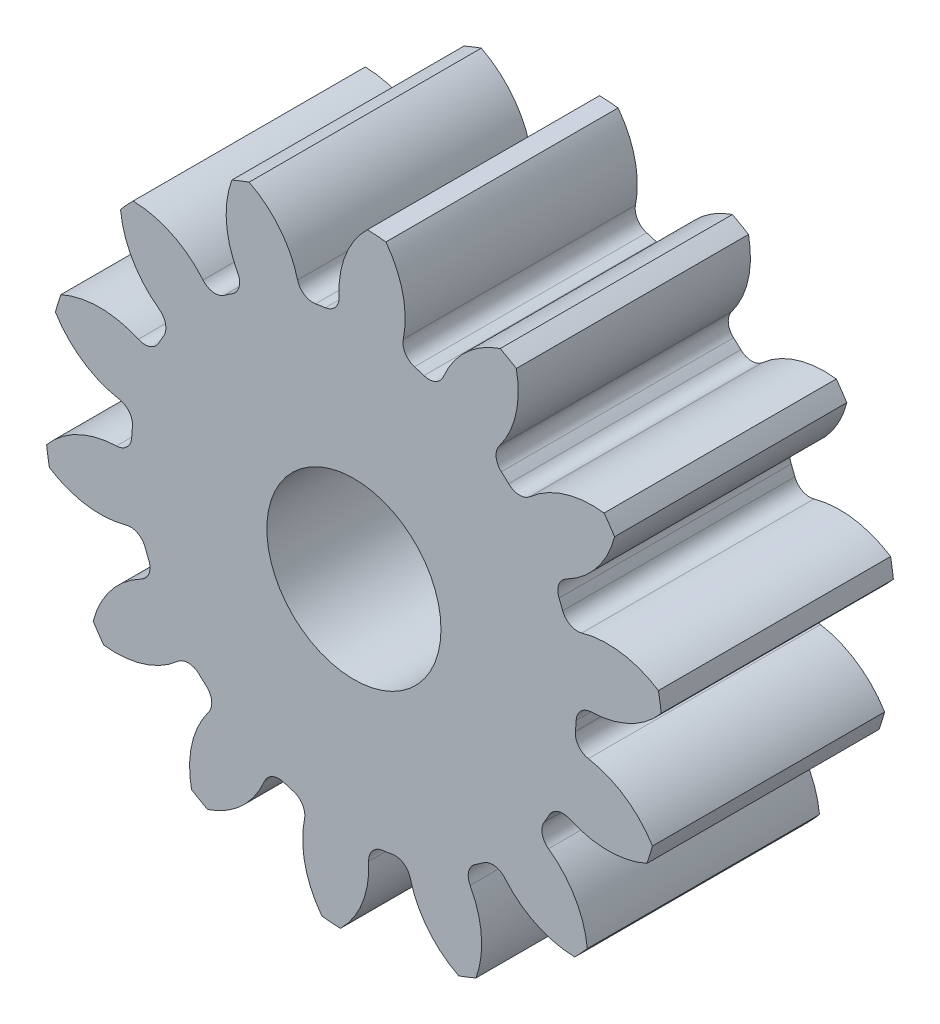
ISO-10303-21;
HEADER;
FILE_DESCRIPTION(('STEP AP214'),'2;1');
FILE_NAME('part.step','',(''),(''),'','','');
FILE_SCHEMA(('AUTOMOTIVE_DESIGN { 1 0 10303 214 1 1 1 1 }'));
ENDSEC;
DATA;
#1=APPLICATION_CONTEXT('core data for automotive mechanical design processes');
#2=APPLICATION_PROTOCOL_DEFINITION('international standard','automotive_design',2000,#1);
#3=PRODUCT_CONTEXT('',#1,'mechanical');
#4=PRODUCT('Part','Part','',(#3));
#5=PRODUCT_RELATED_PRODUCT_CATEGORY('part','',(#4));
#6=PRODUCT_DEFINITION_FORMATION('','',#4);
#7=PRODUCT_DEFINITION_CONTEXT('part definition',#1,'design');
#8=PRODUCT_DEFINITION('design','',#6,#7);
#9=PRODUCT_DEFINITION_SHAPE('','',#8);
#10=(LENGTH_UNIT() NAMED_UNIT(*) SI_UNIT(.MILLI.,.METRE.));
#11=(NAMED_UNIT(*) PLANE_ANGLE_UNIT() SI_UNIT($,.RADIAN.));
#12=(NAMED_UNIT(*) SI_UNIT($,.STERADIAN.) SOLID_ANGLE_UNIT());
#13=UNCERTAINTY_MEASURE_WITH_UNIT(LENGTH_MEASURE(1.E-05),#10,'distance_accuracy_value','');
#14=(GEOMETRIC_REPRESENTATION_CONTEXT(3) GLOBAL_UNCERTAINTY_ASSIGNED_CONTEXT((#13)) GLOBAL_UNIT_ASSIGNED_CONTEXT((#10,
#11,#12)) REPRESENTATION_CONTEXT('',''));
#15=CARTESIAN_POINT('',(0.,0.,0.));
#16=DIRECTION('',(0.,0.,1.));
#17=DIRECTION('',(1.,0.,0.));
#18=AXIS2_PLACEMENT_3D('',#15,#16,#17);
#19=CARTESIAN_POINT('',(0.,0.,101.6));
#20=DIRECTION('',(0.,0.,-1.));
#21=DIRECTION('',(-1.,0.,0.));
#22=AXIS2_PLACEMENT_3D('',#19,#20,#21);
#23=CYLINDRICAL_SURFACE('',#22,135.466666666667);
#24=DIRECTION('',(0.,0.,-1.));
#25=VECTOR('',#24,1.);
#26=CARTESIAN_POINT('',(133.257323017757,24.3660345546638,50.8));
#27=LINE('',#26,#25);
#28=CARTESIAN_POINT('',(133.257323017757,24.3660345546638,101.6));
#29=VERTEX_POINT('',#28);
#30=CARTESIAN_POINT('',(133.257323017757,24.3660345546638,0.));
#31=VERTEX_POINT('',#30);
#32=EDGE_CURVE('E600',#29,#31,#27,.T.);
#33=ORIENTED_EDGE('',*,*,#32,.F.);
#34=CARTESIAN_POINT('',(0.,0.,101.6));
#35=DIRECTION('',(0.,0.,1.));
#36=DIRECTION('',(1.,0.,0.));
#37=AXIS2_PLACEMENT_3D('',#34,#35,#36);
#38=CIRCLE('',#37,135.466666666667);
#39=CARTESIAN_POINT('',(134.478474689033,16.3327163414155,101.6));
#40=VERTEX_POINT('',#39);
#41=EDGE_CURVE('E1093',#40,#29,#38,.T.);
#42=ORIENTED_EDGE('',*,*,#41,.F.);
#43=DIRECTION('',(0.,0.,-1.));
#44=VECTOR('',#43,1.);
#45=CARTESIAN_POINT('',(134.478474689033,16.3327163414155,50.8));
#46=LINE('',#45,#44);
#47=CARTESIAN_POINT('',(134.478474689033,16.3327163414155,0.));
#48=VERTEX_POINT('',#47);
#49=EDGE_CURVE('E1087',#48,#40,#46,.F.);
#50=ORIENTED_EDGE('',*,*,#49,.F.);
#51=CARTESIAN_POINT('',(0.,0.,0.));
#52=DIRECTION('',(0.,0.,1.));
#53=DIRECTION('',(1.,0.,0.));
#54=AXIS2_PLACEMENT_3D('',#51,#52,#53);
#55=CIRCLE('',#54,135.466666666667);
#56=EDGE_CURVE('E1098',#48,#31,#55,.T.);
#57=ORIENTED_EDGE('',*,*,#56,.T.);
#58=EDGE_LOOP('',(#33,#42,#50,#57));
#59=FACE_BOUND('',#58,.T.);
#60=ADVANCED_FACE('F33',(#59),#23,.T.);
#61=DIRECTION('',(0.,0.,-1.));
#62=VECTOR('',#61,1.);
#63=CARTESIAN_POINT('',(114.074419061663,73.0632923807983,50.8));
#64=LINE('',#63,#62);
#65=CARTESIAN_POINT('',(114.074419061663,73.0632923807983,0.));
#66=VERTEX_POINT('',#65);
#67=CARTESIAN_POINT('',(114.074419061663,73.0632923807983,101.6));
#68=VERTEX_POINT('',#67);
#69=EDGE_CURVE('E571',#66,#68,#64,.F.);
#70=ORIENTED_EDGE('',*,*,#69,.F.);
#71=CARTESIAN_POINT('',(109.48867327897,79.7712241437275,0.));
#72=VERTEX_POINT('',#71);
#73=EDGE_CURVE('E1101',#66,#72,#55,.T.);
#74=ORIENTED_EDGE('',*,*,#73,.T.);
#75=DIRECTION('',(0.,0.,-1.));
#76=VECTOR('',#75,1.);
#77=CARTESIAN_POINT('',(109.48867327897,79.7712241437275,50.8));
#78=LINE('',#77,#76);
#79=CARTESIAN_POINT('',(109.48867327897,79.7712241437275,101.6));
#80=VERTEX_POINT('',#79);
#81=EDGE_CURVE('E633',#80,#72,#78,.T.);
#82=ORIENTED_EDGE('',*,*,#81,.F.);
#83=EDGE_CURVE('E1096',#68,#80,#38,.T.);
#84=ORIENTED_EDGE('',*,*,#83,.F.);
#85=EDGE_LOOP('',(#70,#74,#82,#84));
#86=FACE_BOUND('',#85,.T.);
#87=ADVANCED_FACE('F1261',(#86),#23,.T.);
#88=CARTESIAN_POINT('',(0.,0.,101.6));
#89=DIRECTION('',(0.,0.,1.));
#90=DIRECTION('',(1.,0.,0.));
#91=AXIS2_PLACEMENT_3D('',#88,#89,#90);
#92=PLANE('',#91);
#93=CARTESIAN_POINT('',(0.,0.,101.599999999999));
#94=DIRECTION('',(0.,0.,1.));
#95=DIRECTION('',(1.,0.,0.));
#96=AXIS2_PLACEMENT_3D('',#93,#94,#95);
#97=CIRCLE('',#96,38.1);
#98=CARTESIAN_POINT('',(38.1,0.,101.599999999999));
#99=VERTEX_POINT('',#98);
#100=EDGE_CURVE('E588',#99,#99,#97,.T.);
#101=ORIENTED_EDGE('',*,*,#100,.F.);
#102=EDGE_LOOP('',(#101));
#103=FACE_BOUND('',#102,.T.);
#104=ORIENTED_EDGE('',*,*,#41,.T.);
#105=CARTESIAN_POINT('',(110.924158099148,-10.1206125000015,101.6));
#106=DIRECTION('',(0.,0.,-1.));
#107=DIRECTION('',(0.900968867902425,0.433883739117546,0.));
#108=AXIS2_PLACEMENT_3D('',#105,#106,#107);
#109=CIRCLE('',#108,41.0864829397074);
#110=CARTESIAN_POINT('',(99.7129534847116,29.4066941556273,101.6));
#111=VERTEX_POINT('',#110);
#112=EDGE_CURVE('E580',#111,#29,#109,.T.);
#113=ORIENTED_EDGE('',*,*,#112,.F.);
#114=CARTESIAN_POINT('',(97.8323805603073,36.037023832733,101.6));
#115=DIRECTION('',(0.,0.,1.));
#116=DIRECTION('',(-0.900968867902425,-0.433883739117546,0.));
#117=AXIS2_PLACEMENT_3D('',#114,#115,#116);
#118=CIRCLE('',#117,6.89186666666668);
#119=CARTESIAN_POINT('',(91.3653058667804,33.6548460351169,101.6));
#120=VERTEX_POINT('',#119);
#121=EDGE_CURVE('E578',#120,#111,#118,.T.);
#122=ORIENTED_EDGE('',*,*,#121,.F.);
#123=CARTESIAN_POINT('',(0.,0.,101.6));
#124=DIRECTION('',(0.,0.,-1.));
#125=DIRECTION('',(0.900968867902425,0.433883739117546,0.));
#126=AXIS2_PLACEMENT_3D('',#123,#124,#125);
#127=CIRCLE('',#126,97.3666666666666);
#128=CARTESIAN_POINT('',(89.7721753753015,37.6991287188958,101.6));
#129=VERTEX_POINT('',#128);
#130=EDGE_CURVE('E563',#129,#120,#127,.T.);
#131=ORIENTED_EDGE('',*,*,#130,.F.);
#132=CARTESIAN_POINT('',(96.1264841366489,40.3675713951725,101.6));
#133=DIRECTION('',(0.,0.,1.));
#134=DIRECTION('',(-0.900968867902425,-0.433883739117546,0.));
#135=AXIS2_PLACEMENT_3D('',#132,#133,#134);
#136=CIRCLE('',#135,6.89186666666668);
#137=CARTESIAN_POINT('',(92.9798555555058,46.4991743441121,101.6));
#138=VERTEX_POINT('',#137);
#139=EDGE_CURVE('E555',#138,#129,#136,.T.);
#140=ORIENTED_EDGE('',*,*,#139,.F.);
#141=CARTESIAN_POINT('',(74.2209462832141,83.0532767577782,101.6));
#142=DIRECTION('',(0.,0.,-1.));
#143=DIRECTION('',(-0.900968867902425,-0.433883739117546,0.));
#144=AXIS2_PLACEMENT_3D('',#141,#142,#143);
#145=CIRCLE('',#144,41.0864829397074);
#146=EDGE_CURVE('E585',#68,#138,#145,.T.);
#147=ORIENTED_EDGE('',*,*,#146,.F.);
#148=ORIENTED_EDGE('',*,*,#83,.T.);
#149=CARTESIAN_POINT('',(104.330382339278,39.00983168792,101.6));
#150=DIRECTION('',(0.,0.,-1.));
#151=DIRECTION('',(0.623489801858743,0.781831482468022,0.));
#152=AXIS2_PLACEMENT_3D('',#149,#150,#151);
#153=CIRCLE('',#152,41.0864829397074);
#154=CARTESIAN_POINT('',(77.0791804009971,69.7583450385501,101.6));
#155=VERTEX_POINT('',#154);
#156=EDGE_CURVE('E609',#155,#80,#153,.T.);
#157=ORIENTED_EDGE('',*,*,#156,.F.);
#158=CARTESIAN_POINT('',(72.5080505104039,74.9161156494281,101.6));
#159=DIRECTION('',(0.,0.,1.));
#160=DIRECTION('',(-0.623489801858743,-0.781831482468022,0.));
#161=AXIS2_PLACEMENT_3D('',#158,#159,#160);
#162=CIRCLE('',#161,6.89186666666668);
#163=CARTESIAN_POINT('',(67.7150057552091,69.9638890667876,101.6));
#164=VERTEX_POINT('',#163);
#165=EDGE_CURVE('E607',#164,#155,#162,.T.);
#166=ORIENTED_EDGE('',*,*,#165,.F.);
#167=CARTESIAN_POINT('',(0.,0.,101.6));
#168=DIRECTION('',(0.,0.,-1.));
#169=DIRECTION('',(0.623489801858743,0.781831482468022,0.));
#170=AXIS2_PLACEMENT_3D('',#167,#168,#169);
#171=CIRCLE('',#170,97.3666666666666);
#172=CARTESIAN_POINT('',(64.5248962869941,72.9164284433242,101.6));
#173=VERTEX_POINT('',#172);
#174=EDGE_CURVE('E604',#173,#164,#171,.T.);
#175=ORIENTED_EDGE('',*,*,#174,.F.);
#176=CARTESIAN_POINT('',(69.0921367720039,78.0776434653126,101.6));
#177=DIRECTION('',(0.,0.,1.));
#178=DIRECTION('',(-0.623489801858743,-0.781831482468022,0.));
#179=AXIS2_PLACEMENT_3D('',#176,#177,#178);
#180=CIRCLE('',#179,6.89186666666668);
#181=CARTESIAN_POINT('',(63.5967195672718,82.2367558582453,101.6));
#182=VERTEX_POINT('',#181);
#183=EDGE_CURVE('E602',#182,#173,#180,.T.);
#184=ORIENTED_EDGE('',*,*,#183,.F.);
#185=CARTESIAN_POINT('',(30.8352956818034,107.031678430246,101.6));
#186=DIRECTION('',(0.,0.,-1.));
#187=DIRECTION('',(-0.623489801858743,-0.781831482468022,0.));
#188=AXIS2_PLACEMENT_3D('',#185,#186,#187);
#189=CIRCLE('',#188,41.0864829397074);
#190=CARTESIAN_POINT('',(71.0765257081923,115.322787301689,101.6));
#191=VERTEX_POINT('',#190);
#192=EDGE_CURVE('E612',#191,#182,#189,.T.);
#193=ORIENTED_EDGE('',*,*,#192,.F.);
#194=CARTESIAN_POINT('',(64.0344490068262,119.376744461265,101.6));
#195=VERTEX_POINT('',#194);
#196=EDGE_CURVE('E1137',#191,#195,#38,.T.);
#197=ORIENTED_EDGE('',*,*,#196,.T.);
#198=CARTESIAN_POINT('',(77.0726948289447,80.4139002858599,101.6));
#199=DIRECTION('',(0.,0.,-1.));
#200=DIRECTION('',(0.222520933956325,0.974927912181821,0.));
#201=AXIS2_PLACEMENT_3D('',#198,#199,#200);
#202=CIRCLE('',#201,41.0864829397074);
#203=CARTESIAN_POINT('',(39.1789303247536,96.2935001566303,101.6));
#204=VERTEX_POINT('',#203);
#205=EDGE_CURVE('E644',#204,#195,#202,.T.);
#206=ORIENTED_EDGE('',*,*,#205,.F.);
#207=CARTESIAN_POINT('',(32.8226118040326,98.9571519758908,101.6));
#208=DIRECTION('',(0.,0.,1.));
#209=DIRECTION('',(-0.222520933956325,-0.974927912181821,0.));
#210=AXIS2_PLACEMENT_3D('',#207,#208,#209);
#211=CIRCLE('',#210,6.89186666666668);
#212=CARTESIAN_POINT('',(30.6529182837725,92.4157258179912,101.6));
#213=VERTEX_POINT('',#212);
#214=EDGE_CURVE('E642',#213,#204,#211,.T.);
#215=ORIENTED_EDGE('',*,*,#214,.F.);
#216=CARTESIAN_POINT('',(0.,0.,101.6));
#217=DIRECTION('',(0.,0.,-1.));
#218=DIRECTION('',(0.222520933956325,0.974927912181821,0.));
#219=AXIS2_PLACEMENT_3D('',#216,#217,#218);
#220=CIRCLE('',#219,97.3666666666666);
#221=CARTESIAN_POINT('',(26.4976701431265,93.6917352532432,101.6));
#222=VERTEX_POINT('',#221);
#223=EDGE_CURVE('E639',#222,#213,#220,.T.);
#224=ORIENTED_EDGE('',*,*,#223,.F.);
#225=CARTESIAN_POINT('',(28.3732443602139,100.32348068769,101.6));
#226=DIRECTION('',(0.,0.,1.));
#227=DIRECTION('',(-0.222520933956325,-0.974927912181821,0.));
#228=AXIS2_PLACEMENT_3D('',#225,#226,#227);
#229=CIRCLE('',#228,6.89186666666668);
#230=CARTESIAN_POINT('',(21.6174733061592,101.68633930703,101.6));
#231=VERTEX_POINT('',#230);
#232=EDGE_CURVE('E637',#231,#222,#229,.T.);
#233=ORIENTED_EDGE('',*,*,#232,.F.);
#234=CARTESIAN_POINT('',(-18.6576633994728,109.811143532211,101.6));
#235=DIRECTION('',(0.,0.,-1.));
#236=DIRECTION('',(-0.222520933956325,-0.974927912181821,0.));
#237=AXIS2_PLACEMENT_3D('',#234,#235,#236);
#238=CIRCLE('',#237,41.0864829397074);
#239=CARTESIAN_POINT('',(14.0010547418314,134.74118985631,101.6));
#240=VERTEX_POINT('',#239);
#241=EDGE_CURVE('E647',#240,#231,#238,.T.);
#242=ORIENTED_EDGE('',*,*,#241,.F.);
#243=CARTESIAN_POINT('',(5.89741677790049,135.338236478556,101.6));
#244=VERTEX_POINT('',#243);
#245=EDGE_CURVE('E1243',#240,#244,#38,.T.);
#246=ORIENTED_EDGE('',*,*,#245,.T.);
#247=CARTESIAN_POINT('',(34.5498148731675,105.891009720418,101.6));
#248=DIRECTION('',(0.,0.,-1.));
#249=DIRECTION('',(-0.222520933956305,0.974927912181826,0.));
#250=AXIS2_PLACEMENT_3D('',#247,#248,#249);
#251=CIRCLE('',#250,41.0864829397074);
#252=CARTESIAN_POINT('',(-6.48118740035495,103.756546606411,101.6));
#253=VERTEX_POINT('',#252);
#254=EDGE_CURVE('E682',#253,#244,#251,.T.);
#255=ORIENTED_EDGE('',*,*,#254,.F.);
#256=CARTESIAN_POINT('',(-13.3637477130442,103.398510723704,101.6));
#257=DIRECTION('',(0.,0.,1.));
#258=DIRECTION('',(0.222520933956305,-0.974927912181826,0.));
#259=AXIS2_PLACEMENT_3D('',#256,#257,#258);
#260=CIRCLE('',#259,6.89186666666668);
#261=CARTESIAN_POINT('',(-12.4803555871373,96.5634946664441,101.6));
#262=VERTEX_POINT('',#261);
#263=EDGE_CURVE('E680',#262,#253,#260,.T.);
#264=ORIENTED_EDGE('',*,*,#263,.F.);
#265=CARTESIAN_POINT('',(0.,0.,101.6));
#266=DIRECTION('',(0.,0.,-1.));
#267=DIRECTION('',(-0.222520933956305,0.974927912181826,0.));
#268=AXIS2_PLACEMENT_3D('',#265,#266,#267);
#269=CIRCLE('',#268,97.3666666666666);
#270=CARTESIAN_POINT('',(-16.7777445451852,95.9102448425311,101.6));
#271=VERTEX_POINT('',#270);
#272=EDGE_CURVE('E677',#271,#262,#269,.T.);
#273=ORIENTED_EDGE('',*,*,#272,.F.);
#274=CARTESIAN_POINT('',(-17.9653170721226,102.699022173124,101.6));
#275=DIRECTION('',(0.,0.,1.));
#276=DIRECTION('',(0.222520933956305,-0.974927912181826,0.));
#277=AXIS2_PLACEMENT_3D('',#274,#275,#276);
#278=CIRCLE('',#277,6.89186666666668);
#279=CARTESIAN_POINT('',(-24.6433786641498,100.995696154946,101.6));
#280=VERTEX_POINT('',#279);
#281=EDGE_CURVE('E675',#280,#271,#278,.T.);
#282=ORIENTED_EDGE('',*,*,#281,.F.);
#283=CARTESIAN_POINT('',(-64.455243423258,90.8411649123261,101.6));
#284=DIRECTION('',(0.,0.,-1.));
#285=DIRECTION('',(0.222520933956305,-0.974927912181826,0.));
#286=AXIS2_PLACEMENT_3D('',#283,#284,#285);
#287=CIRCLE('',#286,41.0864829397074);
#288=CARTESIAN_POINT('',(-45.847496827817,127.47244726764,101.6));
#289=VERTEX_POINT('',#288);
#290=EDGE_CURVE('E685',#289,#280,#287,.T.);
#291=ORIENTED_EDGE('',*,*,#290,.F.);
#292=CARTESIAN_POINT('',(-53.4076711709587,124.494330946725,101.6));
#293=VERTEX_POINT('',#292);
#294=EDGE_CURVE('E1239',#289,#293,#38,.T.);
#295=ORIENTED_EDGE('',*,*,#294,.T.);
#296=CARTESIAN_POINT('',(-14.816079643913,110.395106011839,101.6));
#297=DIRECTION('',(0.,0.,-1.));
#298=DIRECTION('',(-0.623489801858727,0.781831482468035,0.));
#299=AXIS2_PLACEMENT_3D('',#296,#297,#298);
#300=CIRCLE('',#299,41.0864829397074);
#301=CARTESIAN_POINT('',(-50.8576264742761,90.6693365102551,101.6));
#302=VERTEX_POINT('',#301);
#303=EDGE_CURVE('E720',#302,#293,#300,.T.);
#304=ORIENTED_EDGE('',*,*,#303,.F.);
#305=CARTESIAN_POINT('',(-56.9032530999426,87.3605263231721,101.6));
#306=DIRECTION('',(0.,0.,1.));
#307=DIRECTION('',(0.623489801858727,-0.781831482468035,0.));
#308=AXIS2_PLACEMENT_3D('',#305,#306,#307);
#309=CIRCLE('',#308,6.89186666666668);
#310=CARTESIAN_POINT('',(-53.1417419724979,81.5856791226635,101.6));
#311=VERTEX_POINT('',#310);
#312=EDGE_CURVE('E718',#311,#302,#309,.T.);
#313=ORIENTED_EDGE('',*,*,#312,.F.);
#314=CARTESIAN_POINT('',(0.,0.,101.6));
#315=DIRECTION('',(0.,0.,-1.));
#316=DIRECTION('',(-0.623489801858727,0.781831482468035,0.));
#317=AXIS2_PLACEMENT_3D('',#314,#315,#316);
#318=CIRCLE('',#317,97.3666666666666);
#319=CARTESIAN_POINT('',(-56.7301211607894,79.1325541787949,101.6));
#320=VERTEX_POINT('',#319);
#321=EDGE_CURVE('E715',#320,#311,#318,.T.);
#322=ORIENTED_EDGE('',*,*,#321,.F.);
#323=CARTESIAN_POINT('',(-60.7456271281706,84.73376279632,101.6));
#324=DIRECTION('',(0.,0.,1.));
#325=DIRECTION('',(0.623489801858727,-0.781831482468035,0.));
#326=AXIS2_PLACEMENT_3D('',#323,#324,#325);
#327=CIRCLE('',#326,6.89186666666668);
#328=CARTESIAN_POINT('',(-66.0233072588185,80.3016167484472,101.6));
#329=VERTEX_POINT('',#328);
#330=EDGE_CURVE('E713',#329,#320,#327,.T.);
#331=ORIENTED_EDGE('',*,*,#330,.F.);
#332=CARTESIAN_POINT('',(-97.4866719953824,53.8789794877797,101.6));
#333=DIRECTION('',(0.,0.,-1.));
#334=DIRECTION('',(0.623489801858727,-0.781831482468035,0.));
#335=AXIS2_PLACEMENT_3D('',#332,#333,#334);
#336=CIRCLE('',#335,41.0864829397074);
#337=CARTESIAN_POINT('',(-96.6153893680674,94.9562231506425,101.6));
#338=VERTEX_POINT('',#337);
#339=EDGE_CURVE('E723',#338,#329,#336,.T.);
#340=ORIENTED_EDGE('',*,*,#339,.F.);
#341=CARTESIAN_POINT('',(-102.134714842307,88.9927963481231,101.6));
#342=VERTEX_POINT('',#341);
#343=EDGE_CURVE('E1235',#338,#342,#38,.T.);
#344=ORIENTED_EDGE('',*,*,#343,.T.);
#345=CARTESIAN_POINT('',(-61.2474678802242,93.0340976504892,101.6));
#346=DIRECTION('',(0.,0.,-1.));
#347=DIRECTION('',(-0.900968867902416,0.433883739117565,0.));
#348=AXIS2_PLACEMENT_3D('',#345,#346,#347);
#349=CIRCLE('',#348,41.0864829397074);
#350=CARTESIAN_POINT('',(-85.1610888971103,59.6239523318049,101.6));
#351=VERTEX_POINT('',#350);
#352=EDGE_CURVE('E758',#351,#342,#349,.T.);
#353=ORIENTED_EDGE('',*,*,#352,.F.);
#354=CARTESIAN_POINT('',(-89.1723713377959,54.0197182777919,101.6));
#355=DIRECTION('',(0.,0.,1.));
#356=DIRECTION('',(0.900968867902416,-0.433883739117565,0.));
#357=AXIS2_PLACEMENT_3D('',#354,#355,#356);
#358=CIRCLE('',#357,6.89186666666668);
#359=CARTESIAN_POINT('',(-83.2777546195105,50.4488192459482,101.6));
#360=VERTEX_POINT('',#359);
#361=EDGE_CURVE('E756',#360,#351,#358,.T.);
#362=ORIENTED_EDGE('',*,*,#361,.F.);
#363=CARTESIAN_POINT('',(0.,0.,101.6));
#364=DIRECTION('',(0.,0.,-1.));
#365=DIRECTION('',(-0.900968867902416,0.433883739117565,0.));
#366=AXIS2_PLACEMENT_3D('',#363,#364,#365);
#367=CIRCLE('',#366,97.3666666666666);
#368=CARTESIAN_POINT('',(-85.4464015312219,46.6816906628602,101.6));
#369=VERTEX_POINT('',#368);
#370=EDGE_CURVE('E753',#369,#360,#367,.T.);
#371=ORIENTED_EDGE('',*,*,#370,.F.);
#372=CARTESIAN_POINT('',(-91.4945207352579,49.9859425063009,101.6));
#373=DIRECTION('',(0.,0.,1.));
#374=DIRECTION('',(0.900968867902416,-0.433883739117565,0.));
#375=AXIS2_PLACEMENT_3D('',#372,#373,#374);
#376=CIRCLE('',#375,6.89186666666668);
#377=CARTESIAN_POINT('',(-94.3265101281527,43.7028173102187,101.6));
#378=VERTEX_POINT('',#377);
#379=EDGE_CURVE('E751',#378,#369,#376,.T.);
#380=ORIENTED_EDGE('',*,*,#379,.F.);
#381=CARTESIAN_POINT('',(-111.20966958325,6.24540139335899,101.6));
#382=DIRECTION('',(0.,0.,-1.));
#383=DIRECTION('',(0.900968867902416,-0.433883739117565,0.));
#384=AXIS2_PLACEMENT_3D('',#381,#382,#383);
#385=CIRCLE('',#384,41.0864829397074);
#386=CARTESIAN_POINT('',(-128.247419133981,43.6327544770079,101.6));
#387=VERTEX_POINT('',#386);
#388=EDGE_CURVE('E761',#387,#378,#385,.T.);
#389=ORIENTED_EDGE('',*,*,#388,.F.);
#390=CARTESIAN_POINT('',(-130.632725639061,35.8651470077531,101.6));
#391=VERTEX_POINT('',#390);
#392=EDGE_CURVE('E1231',#387,#391,#38,.T.);
#393=ORIENTED_EDGE('',*,*,#392,.T.);
#394=CARTESIAN_POINT('',(-95.5480439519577,57.2465452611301,101.6));
#395=DIRECTION('',(0.,0.,-1.));
#396=DIRECTION('',(-1.,0.,0.));
#397=AXIS2_PLACEMENT_3D('',#394,#395,#396);
#398=CIRCLE('',#397,41.0864829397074);
#399=CARTESIAN_POINT('',(-102.597353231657,16.769313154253,101.6));
#400=VERTEX_POINT('',#399);
#401=EDGE_CURVE('E796',#400,#391,#398,.T.);
#402=ORIENTED_EDGE('',*,*,#401,.F.);
#403=CARTESIAN_POINT('',(-103.779807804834,9.97964251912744,101.6));
#404=DIRECTION('',(0.,0.,1.));
#405=DIRECTION('',(1.,0.,0.));
#406=AXIS2_PLACEMENT_3D('',#403,#404,#405);
#407=CIRCLE('',#406,6.89186666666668);
#408=CARTESIAN_POINT('',(-96.9195866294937,9.31995200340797,101.6));
#409=VERTEX_POINT('',#408);
#410=EDGE_CURVE('E794',#409,#400,#407,.T.);
#411=ORIENTED_EDGE('',*,*,#410,.F.);
#412=CARTESIAN_POINT('',(0.,0.,101.6));
#413=DIRECTION('',(0.,0.,-1.));
#414=DIRECTION('',(-1.,0.,0.));
#415=AXIS2_PLACEMENT_3D('',#412,#413,#414);
#416=CIRCLE('',#415,97.3666666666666);
#417=CARTESIAN_POINT('',(-97.2389741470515,4.98494579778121,101.6));
#418=VERTEX_POINT('',#417);
#419=EDGE_CURVE('E791',#418,#409,#416,.T.);
#420=ORIENTED_EDGE('',*,*,#419,.F.);
#421=CARTESIAN_POINT('',(-104.121802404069,5.33779326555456,101.6));
#422=DIRECTION('',(0.,0.,1.));
#423=DIRECTION('',(1.,0.,0.));
#424=AXIS2_PLACEMENT_3D('',#421,#422,#423);
#425=CIRCLE('',#424,6.89186666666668);
#426=CARTESIAN_POINT('',(-103.947190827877,-1.55186107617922,101.6));
#427=VERTEX_POINT('',#426);
#428=EDGE_CURVE('E789',#427,#418,#425,.T.);
#429=ORIENTED_EDGE('',*,*,#428,.F.);
#430=CARTESIAN_POINT('',(-102.906228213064,-42.625155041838,101.6));
#431=DIRECTION('',(0.,0.,-1.));
#432=DIRECTION('',(1.,0.,0.));
#433=AXIS2_PLACEMENT_3D('',#430,#431,#432);
#434=CIRCLE('',#433,41.0864829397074);
#435=CARTESIAN_POINT('',(-134.478474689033,-16.3327163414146,101.6));
#436=VERTEX_POINT('',#435);
#437=EDGE_CURVE('E799',#436,#427,#434,.T.);
#438=ORIENTED_EDGE('',*,*,#437,.F.);
#439=CARTESIAN_POINT('',(-133.257323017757,-24.3660345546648,101.6));
#440=VERTEX_POINT('',#439);
#441=EDGE_CURVE('E1227',#436,#440,#38,.T.);
#442=ORIENTED_EDGE('',*,*,#441,.T.);
#443=CARTESIAN_POINT('',(-110.924158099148,10.1206125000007,101.6));
#444=DIRECTION('',(0.,0.,-1.));
#445=DIRECTION('',(-0.900968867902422,-0.433883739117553,0.));
#446=AXIS2_PLACEMENT_3D('',#443,#444,#445);
#447=CIRCLE('',#446,41.0864829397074);
#448=CARTESIAN_POINT('',(-99.7129534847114,-29.406694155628,101.6));
#449=VERTEX_POINT('',#448);
#450=EDGE_CURVE('E834',#449,#440,#447,.T.);
#451=ORIENTED_EDGE('',*,*,#450,.F.);
#452=CARTESIAN_POINT('',(-97.832380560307,-36.0370238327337,101.6));
#453=DIRECTION('',(0.,0.,1.));
#454=DIRECTION('',(0.900968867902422,0.433883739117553,0.));
#455=AXIS2_PLACEMENT_3D('',#452,#453,#454);
#456=CIRCLE('',#455,6.89186666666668);
#457=CARTESIAN_POINT('',(-91.3653058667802,-33.6548460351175,101.6));
#458=VERTEX_POINT('',#457);
#459=EDGE_CURVE('E832',#458,#449,#456,.T.);
#460=ORIENTED_EDGE('',*,*,#459,.F.);
#461=CARTESIAN_POINT('',(0.,0.,101.6));
#462=DIRECTION('',(0.,0.,-1.));
#463=DIRECTION('',(-0.900968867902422,-0.433883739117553,0.));
#464=AXIS2_PLACEMENT_3D('',#461,#462,#463);
#465=CIRCLE('',#464,97.3666666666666);
#466=CARTESIAN_POINT('',(-89.7721753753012,-37.6991287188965,101.6));
#467=VERTEX_POINT('',#466);
#468=EDGE_CURVE('E829',#467,#458,#465,.T.);
#469=ORIENTED_EDGE('',*,*,#468,.F.);
#470=CARTESIAN_POINT('',(-96.1264841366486,-40.3675713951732,101.6));
#471=DIRECTION('',(0.,0.,1.));
#472=DIRECTION('',(0.900968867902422,0.433883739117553,0.));
#473=AXIS2_PLACEMENT_3D('',#470,#471,#472);
#474=CIRCLE('',#473,6.89186666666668);
#475=CARTESIAN_POINT('',(-92.9798555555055,-46.4991743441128,101.6));
#476=VERTEX_POINT('',#475);
#477=EDGE_CURVE('E827',#476,#467,#474,.T.);
#478=ORIENTED_EDGE('',*,*,#477,.F.);
#479=CARTESIAN_POINT('',(-74.2209462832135,-83.0532767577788,101.6));
#480=DIRECTION('',(0.,0.,-1.));
#481=DIRECTION('',(0.900968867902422,0.433883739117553,0.));
#482=AXIS2_PLACEMENT_3D('',#479,#480,#481);
#483=CIRCLE('',#482,41.0864829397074);
#484=CARTESIAN_POINT('',(-114.074419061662,-73.0632923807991,101.6));
#485=VERTEX_POINT('',#484);
#486=EDGE_CURVE('E837',#485,#476,#483,.T.);
#487=ORIENTED_EDGE('',*,*,#486,.F.);
#488=CARTESIAN_POINT('',(-109.48867327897,-79.7712241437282,101.6));
#489=VERTEX_POINT('',#488);
#490=EDGE_CURVE('E1223',#485,#489,#38,.T.);
#491=ORIENTED_EDGE('',*,*,#490,.T.);
#492=CARTESIAN_POINT('',(-104.330382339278,-39.0098316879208,101.6));
#493=DIRECTION('',(0.,0.,-1.));
#494=DIRECTION('',(-0.623489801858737,-0.781831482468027,0.));
#495=AXIS2_PLACEMENT_3D('',#492,#493,#494);
#496=CIRCLE('',#495,41.0864829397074);
#497=CARTESIAN_POINT('',(-77.0791804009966,-69.7583450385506,101.6));
#498=VERTEX_POINT('',#497);
#499=EDGE_CURVE('E872',#498,#489,#496,.T.);
#500=ORIENTED_EDGE('',*,*,#499,.F.);
#501=CARTESIAN_POINT('',(-72.5080505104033,-74.9161156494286,101.6));
#502=DIRECTION('',(0.,0.,1.));
#503=DIRECTION('',(0.623489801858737,0.781831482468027,0.));
#504=AXIS2_PLACEMENT_3D('',#501,#502,#503);
#505=CIRCLE('',#504,6.89186666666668);
#506=CARTESIAN_POINT('',(-67.7150057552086,-69.9638890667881,101.6));
#507=VERTEX_POINT('',#506);
#508=EDGE_CURVE('E870',#507,#498,#505,.T.);
#509=ORIENTED_EDGE('',*,*,#508,.F.);
#510=CARTESIAN_POINT('',(0.,0.,101.6));
#511=DIRECTION('',(0.,0.,-1.));
#512=DIRECTION('',(-0.623489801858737,-0.781831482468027,0.));
#513=AXIS2_PLACEMENT_3D('',#510,#511,#512);
#514=CIRCLE('',#513,97.3666666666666);
#515=CARTESIAN_POINT('',(-64.5248962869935,-72.9164284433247,101.6));
#516=VERTEX_POINT('',#515);
#517=EDGE_CURVE('E867',#516,#507,#514,.T.);
#518=ORIENTED_EDGE('',*,*,#517,.F.);
#519=CARTESIAN_POINT('',(-69.0921367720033,-78.0776434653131,101.6));
#520=DIRECTION('',(0.,0.,1.));
#521=DIRECTION('',(0.623489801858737,0.781831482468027,0.));
#522=AXIS2_PLACEMENT_3D('',#519,#520,#521);
#523=CIRCLE('',#522,6.89186666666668);
#524=CARTESIAN_POINT('',(-63.5967195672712,-82.2367558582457,101.6));
#525=VERTEX_POINT('',#524);
#526=EDGE_CURVE('E865',#525,#516,#523,.T.);
#527=ORIENTED_EDGE('',*,*,#526,.F.);
#528=CARTESIAN_POINT('',(-30.8352956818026,-107.031678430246,101.6));
#529=DIRECTION('',(0.,0.,-1.));
#530=DIRECTION('',(0.623489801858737,0.781831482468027,0.));
#531=AXIS2_PLACEMENT_3D('',#528,#529,#530);
#532=CIRCLE('',#531,41.0864829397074);
#533=CARTESIAN_POINT('',(-71.0765257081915,-115.322787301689,101.6));
#534=VERTEX_POINT('',#533);
#535=EDGE_CURVE('E875',#534,#525,#532,.T.);
#536=ORIENTED_EDGE('',*,*,#535,.F.);
#537=CARTESIAN_POINT('',(-64.0344490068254,-119.376744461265,101.6));
#538=VERTEX_POINT('',#537);
#539=EDGE_CURVE('E1219',#534,#538,#38,.T.);
#540=ORIENTED_EDGE('',*,*,#539,.T.);
#541=CARTESIAN_POINT('',(-77.0726948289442,-80.4139002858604,101.6));
#542=DIRECTION('',(0.,0.,-1.));
#543=DIRECTION('',(-0.222520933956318,-0.974927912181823,0.));
#544=AXIS2_PLACEMENT_3D('',#541,#542,#543);
#545=CIRCLE('',#544,41.0864829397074);
#546=CARTESIAN_POINT('',(-39.178930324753,-96.2935001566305,101.6));
#547=VERTEX_POINT('',#546);
#548=EDGE_CURVE('E910',#547,#538,#545,.T.);
#549=ORIENTED_EDGE('',*,*,#548,.F.);
#550=CARTESIAN_POINT('',(-32.8226118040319,-98.957151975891,101.6));
#551=DIRECTION('',(0.,0.,1.));
#552=DIRECTION('',(0.222520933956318,0.974927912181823,0.));
#553=AXIS2_PLACEMENT_3D('',#550,#551,#552);
#554=CIRCLE('',#553,6.89186666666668);
#555=CARTESIAN_POINT('',(-30.6529182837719,-92.4157258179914,101.6));
#556=VERTEX_POINT('',#555);
#557=EDGE_CURVE('E908',#556,#547,#554,.T.);
#558=ORIENTED_EDGE('',*,*,#557,.F.);
#559=CARTESIAN_POINT('',(0.,0.,101.6));
#560=DIRECTION('',(0.,0.,-1.));
#561=DIRECTION('',(-0.222520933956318,-0.974927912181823,0.));
#562=AXIS2_PLACEMENT_3D('',#559,#560,#561);
#563=CIRCLE('',#562,97.3666666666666);
#564=CARTESIAN_POINT('',(-26.4976701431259,-93.6917352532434,101.6));
#565=VERTEX_POINT('',#564);
#566=EDGE_CURVE('E905',#565,#556,#563,.T.);
#567=ORIENTED_EDGE('',*,*,#566,.F.);
#568=CARTESIAN_POINT('',(-28.3732443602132,-100.32348068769,101.6));
#569=DIRECTION('',(0.,0.,1.));
#570=DIRECTION('',(0.222520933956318,0.974927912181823,0.));
#571=AXIS2_PLACEMENT_3D('',#568,#569,#570);
#572=CIRCLE('',#571,6.89186666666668);
#573=CARTESIAN_POINT('',(-21.6174733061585,-101.68633930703,101.6));
#574=VERTEX_POINT('',#573);
#575=EDGE_CURVE('E903',#574,#565,#572,.T.);
#576=ORIENTED_EDGE('',*,*,#575,.F.);
#577=CARTESIAN_POINT('',(18.6576633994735,-109.811143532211,101.6));
#578=DIRECTION('',(0.,0.,-1.));
#579=DIRECTION('',(0.222520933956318,0.974927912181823,0.));
#580=AXIS2_PLACEMENT_3D('',#577,#578,#579);
#581=CIRCLE('',#580,41.0864829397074);
#582=CARTESIAN_POINT('',(-14.0010547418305,-134.74118985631,101.6));
#583=VERTEX_POINT('',#582);
#584=EDGE_CURVE('E913',#583,#574,#581,.T.);
#585=ORIENTED_EDGE('',*,*,#584,.F.);
#586=CARTESIAN_POINT('',(-5.89741677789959,-135.338236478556,101.6));
#587=VERTEX_POINT('',#586);
#588=EDGE_CURVE('E1215',#583,#587,#38,.T.);
#589=ORIENTED_EDGE('',*,*,#588,.T.);
#590=CARTESIAN_POINT('',(-34.5498148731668,-105.891009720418,101.6));
#591=DIRECTION('',(0.,0.,-1.));
#592=DIRECTION('',(0.222520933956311,-0.974927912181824,0.));
#593=AXIS2_PLACEMENT_3D('',#590,#591,#592);
#594=CIRCLE('',#593,41.0864829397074);
#595=CARTESIAN_POINT('',(6.48118740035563,-103.756546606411,101.6));
#596=VERTEX_POINT('',#595);
#597=EDGE_CURVE('E948',#596,#587,#594,.T.);
#598=ORIENTED_EDGE('',*,*,#597,.F.);
#599=CARTESIAN_POINT('',(13.3637477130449,-103.398510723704,101.6));
#600=DIRECTION('',(0.,0.,1.));
#601=DIRECTION('',(-0.222520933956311,0.974927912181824,0.));
#602=AXIS2_PLACEMENT_3D('',#599,#600,#601);
#603=CIRCLE('',#602,6.89186666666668);
#604=CARTESIAN_POINT('',(12.4803555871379,-96.563494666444,101.6));
#605=VERTEX_POINT('',#604);
#606=EDGE_CURVE('E946',#605,#596,#603,.T.);
#607=ORIENTED_EDGE('',*,*,#606,.F.);
#608=CARTESIAN_POINT('',(0.,0.,101.6));
#609=DIRECTION('',(0.,0.,-1.));
#610=DIRECTION('',(0.222520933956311,-0.974927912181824,0.));
#611=AXIS2_PLACEMENT_3D('',#608,#609,#610);
#612=CIRCLE('',#611,97.3666666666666);
#613=CARTESIAN_POINT('',(16.7777445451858,-95.910244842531,101.6));
#614=VERTEX_POINT('',#613);
#615=EDGE_CURVE('E943',#614,#605,#612,.T.);
#616=ORIENTED_EDGE('',*,*,#615,.F.);
#617=CARTESIAN_POINT('',(17.9653170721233,-102.699022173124,101.6));
#618=DIRECTION('',(0.,0.,1.));
#619=DIRECTION('',(-0.222520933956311,0.974927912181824,0.));
#620=AXIS2_PLACEMENT_3D('',#617,#618,#619);
#621=CIRCLE('',#620,6.89186666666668);
#622=CARTESIAN_POINT('',(24.6433786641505,-100.995696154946,101.6));
#623=VERTEX_POINT('',#622);
#624=EDGE_CURVE('E941',#623,#614,#621,.T.);
#625=ORIENTED_EDGE('',*,*,#624,.F.);
#626=CARTESIAN_POINT('',(64.4552434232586,-90.8411649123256,101.6));
#627=DIRECTION('',(0.,0.,-1.));
#628=DIRECTION('',(-0.222520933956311,0.974927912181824,0.));
#629=AXIS2_PLACEMENT_3D('',#626,#627,#628);
#630=CIRCLE('',#629,41.0864829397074);
#631=CARTESIAN_POINT('',(45.8474968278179,-127.472447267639,101.6));
#632=VERTEX_POINT('',#631);
#633=EDGE_CURVE('E951',#632,#623,#630,.T.);
#634=ORIENTED_EDGE('',*,*,#633,.F.);
#635=CARTESIAN_POINT('',(53.4076711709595,-124.494330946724,101.6));
#636=VERTEX_POINT('',#635);
#637=EDGE_CURVE('E1211',#632,#636,#38,.T.);
#638=ORIENTED_EDGE('',*,*,#637,.T.);
#639=CARTESIAN_POINT('',(14.8160796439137,-110.395106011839,101.6));
#640=DIRECTION('',(0.,0.,-1.));
#641=DIRECTION('',(0.623489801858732,-0.781831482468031,0.));
#642=AXIS2_PLACEMENT_3D('',#639,#640,#641);
#643=CIRCLE('',#642,41.0864829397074);
#644=CARTESIAN_POINT('',(50.8576264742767,-90.6693365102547,101.6));
#645=VERTEX_POINT('',#644);
#646=EDGE_CURVE('E986',#645,#636,#643,.T.);
#647=ORIENTED_EDGE('',*,*,#646,.F.);
#648=CARTESIAN_POINT('',(56.9032530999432,-87.3605263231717,101.6));
#649=DIRECTION('',(0.,0.,1.));
#650=DIRECTION('',(-0.623489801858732,0.781831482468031,0.));
#651=AXIS2_PLACEMENT_3D('',#648,#649,#650);
#652=CIRCLE('',#651,6.89186666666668);
#653=CARTESIAN_POINT('',(53.1417419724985,-81.5856791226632,101.6));
#654=VERTEX_POINT('',#653);
#655=EDGE_CURVE('E984',#654,#645,#652,.T.);
#656=ORIENTED_EDGE('',*,*,#655,.F.);
#657=CARTESIAN_POINT('',(0.,0.,101.6));
#658=DIRECTION('',(0.,0.,-1.));
#659=DIRECTION('',(0.623489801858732,-0.781831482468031,0.));
#660=AXIS2_PLACEMENT_3D('',#657,#658,#659);
#661=CIRCLE('',#660,97.3666666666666);
#662=CARTESIAN_POINT('',(56.73012116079,-79.1325541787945,101.6));
#663=VERTEX_POINT('',#662);
#664=EDGE_CURVE('E981',#663,#654,#661,.T.);
#665=ORIENTED_EDGE('',*,*,#664,.F.);
#666=CARTESIAN_POINT('',(60.7456271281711,-84.7337627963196,101.6));
#667=DIRECTION('',(0.,0.,1.));
#668=DIRECTION('',(-0.623489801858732,0.781831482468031,0.));
#669=AXIS2_PLACEMENT_3D('',#666,#667,#668);
#670=CIRCLE('',#669,6.89186666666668);
#671=CARTESIAN_POINT('',(66.0233072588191,-80.3016167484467,101.6));
#672=VERTEX_POINT('',#671);
#673=EDGE_CURVE('E979',#672,#663,#670,.T.);
#674=ORIENTED_EDGE('',*,*,#673,.F.);
#675=CARTESIAN_POINT('',(97.4866719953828,-53.878979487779,101.6));
#676=DIRECTION('',(0.,0.,-1.));
#677=DIRECTION('',(-0.623489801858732,0.781831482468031,0.));
#678=AXIS2_PLACEMENT_3D('',#675,#676,#677);
#679=CIRCLE('',#678,41.0864829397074);
#680=CARTESIAN_POINT('',(96.6153893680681,-94.9562231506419,101.6));
#681=VERTEX_POINT('',#680);
#682=EDGE_CURVE('E989',#681,#672,#679,.T.);
#683=ORIENTED_EDGE('',*,*,#682,.F.);
#684=CARTESIAN_POINT('',(102.134714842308,-88.9927963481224,101.6));
#685=VERTEX_POINT('',#684);
#686=EDGE_CURVE('E1210',#681,#685,#38,.T.);
#687=ORIENTED_EDGE('',*,*,#686,.T.);
#688=CARTESIAN_POINT('',(61.2474678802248,-93.0340976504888,101.6));
#689=DIRECTION('',(0.,0.,-1.));
#690=DIRECTION('',(0.900968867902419,-0.433883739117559,0.));
#691=AXIS2_PLACEMENT_3D('',#688,#689,#690);
#692=CIRCLE('',#691,41.0864829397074);
#693=CARTESIAN_POINT('',(85.1610888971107,-59.6239523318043,101.6));
#694=VERTEX_POINT('',#693);
#695=EDGE_CURVE('E1024',#694,#685,#692,.T.);
#696=ORIENTED_EDGE('',*,*,#695,.F.);
#697=CARTESIAN_POINT('',(89.1723713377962,-54.0197182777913,101.6));
#698=DIRECTION('',(0.,0.,1.));
#699=DIRECTION('',(-0.900968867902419,0.433883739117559,0.));
#700=AXIS2_PLACEMENT_3D('',#697,#698,#699);
#701=CIRCLE('',#700,6.89186666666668);
#702=CARTESIAN_POINT('',(83.2777546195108,-50.4488192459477,101.6));
#703=VERTEX_POINT('',#702);
#704=EDGE_CURVE('E1022',#703,#694,#701,.T.);
#705=ORIENTED_EDGE('',*,*,#704,.F.);
#706=CARTESIAN_POINT('',(0.,0.,101.6));
#707=DIRECTION('',(0.,0.,-1.));
#708=DIRECTION('',(0.900968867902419,-0.433883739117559,0.));
#709=AXIS2_PLACEMENT_3D('',#706,#707,#708);
#710=CIRCLE('',#709,97.3666666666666);
#711=CARTESIAN_POINT('',(85.4464015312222,-46.6816906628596,101.6));
#712=VERTEX_POINT('',#711);
#713=EDGE_CURVE('E1019',#712,#703,#710,.T.);
#714=ORIENTED_EDGE('',*,*,#713,.F.);
#715=CARTESIAN_POINT('',(91.4945207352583,-49.9859425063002,101.6));
#716=DIRECTION('',(0.,0.,1.));
#717=DIRECTION('',(-0.900968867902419,0.433883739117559,0.));
#718=AXIS2_PLACEMENT_3D('',#715,#716,#717);
#719=CIRCLE('',#718,6.89186666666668);
#720=CARTESIAN_POINT('',(94.326510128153,-43.7028173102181,101.6));
#721=VERTEX_POINT('',#720);
#722=EDGE_CURVE('E1017',#721,#712,#719,.T.);
#723=ORIENTED_EDGE('',*,*,#722,.F.);
#724=CARTESIAN_POINT('',(111.20966958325,-6.24540139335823,101.6));
#725=DIRECTION('',(0.,0.,-1.));
#726=DIRECTION('',(-0.900968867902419,0.433883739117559,0.));
#727=AXIS2_PLACEMENT_3D('',#724,#725,#726);
#728=CIRCLE('',#727,41.0864829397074);
#729=CARTESIAN_POINT('',(128.247419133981,-43.632754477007,101.6));
#730=VERTEX_POINT('',#729);
#731=EDGE_CURVE('E1027',#730,#721,#728,.T.);
#732=ORIENTED_EDGE('',*,*,#731,.F.);
#733=CARTESIAN_POINT('',(130.632725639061,-35.8651470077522,101.6));
#734=VERTEX_POINT('',#733);
#735=EDGE_CURVE('E1097',#730,#734,#38,.T.);
#736=ORIENTED_EDGE('',*,*,#735,.T.);
#737=CARTESIAN_POINT('',(95.5480439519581,-57.2465452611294,101.6));
#738=DIRECTION('',(0.,0.,-1.));
#739=DIRECTION('',(1.,0.,0.));
#740=AXIS2_PLACEMENT_3D('',#737,#738,#739);
#741=CIRCLE('',#740,41.0864829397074);
#742=CARTESIAN_POINT('',(102.597353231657,-16.7693131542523,101.6));
#743=VERTEX_POINT('',#742);
#744=EDGE_CURVE('E1062',#743,#734,#741,.T.);
#745=ORIENTED_EDGE('',*,*,#744,.F.);
#746=CARTESIAN_POINT('',(103.779807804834,-9.97964251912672,101.6));
#747=DIRECTION('',(0.,0.,1.));
#748=DIRECTION('',(-1.,0.,0.));
#749=AXIS2_PLACEMENT_3D('',#746,#747,#748);
#750=CIRCLE('',#749,6.89186666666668);
#751=CARTESIAN_POINT('',(96.9195866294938,-9.31995200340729,101.6));
#752=VERTEX_POINT('',#751);
#753=EDGE_CURVE('E1060',#752,#743,#750,.T.);
#754=ORIENTED_EDGE('',*,*,#753,.F.);
#755=CARTESIAN_POINT('',(0.,0.,101.6));
#756=DIRECTION('',(0.,0.,-1.));
#757=DIRECTION('',(1.,0.,0.));
#758=AXIS2_PLACEMENT_3D('',#755,#756,#757);
#759=CIRCLE('',#758,97.3666666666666);
#760=CARTESIAN_POINT('',(97.2389741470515,-4.98494579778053,101.6));
#761=VERTEX_POINT('',#760);
#762=EDGE_CURVE('E1057',#761,#752,#759,.T.);
#763=ORIENTED_EDGE('',*,*,#762,.F.);
#764=CARTESIAN_POINT('',(104.121802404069,-5.33779326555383,101.6));
#765=DIRECTION('',(0.,0.,1.));
#766=DIRECTION('',(-1.,0.,0.));
#767=AXIS2_PLACEMENT_3D('',#764,#765,#766);
#768=CIRCLE('',#767,6.89186666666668);
#769=CARTESIAN_POINT('',(103.947190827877,1.55186107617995,101.6));
#770=VERTEX_POINT('',#769);
#771=EDGE_CURVE('E1055',#770,#761,#768,.T.);
#772=ORIENTED_EDGE('',*,*,#771,.F.);
#773=CARTESIAN_POINT('',(102.906228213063,42.6251550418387,101.6));
#774=DIRECTION('',(0.,0.,-1.));
#775=DIRECTION('',(-1.,0.,0.));
#776=AXIS2_PLACEMENT_3D('',#773,#774,#775);
#777=CIRCLE('',#776,41.0864829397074);
#778=EDGE_CURVE('E1065',#40,#770,#777,.T.);
#779=ORIENTED_EDGE('',*,*,#778,.F.);
#780=EDGE_LOOP('',(#104,#113,#122,#131,#140,#147,#148,#157,#166,#175,#184,#193,#197,#206,#215,
#224,#233,#242,#246,#255,#264,#273,#282,#291,#295,#304,#313,#322,#331,#340,#344,#353,#362,#371,
#380,#389,#393,#402,#411,#420,#429,#438,#442,#451,#460,#469,#478,#487,#491,#500,#509,#518,#527,
#536,#540,#549,#558,#567,#576,#585,#589,#598,#607,#616,#625,#634,#638,#647,#656,#665,#674,#683,
#687,#696,#705,#714,#723,#732,#736,#745,#754,#763,#772,#779));
#781=FACE_BOUND('',#780,.T.);
#782=ADVANCED_FACE('F576',(#103,#781),#92,.T.);
#783=CARTESIAN_POINT('',(0.,0.,0.));
#784=DIRECTION('',(0.,0.,1.));
#785=DIRECTION('',(1.,0.,0.));
#786=AXIS2_PLACEMENT_3D('',#783,#784,#785);
#787=PLANE('',#786);
#788=CARTESIAN_POINT('',(0.,0.,0.));
#789=DIRECTION('',(0.,0.,1.));
#790=DIRECTION('',(1.,0.,0.));
#791=AXIS2_PLACEMENT_3D('',#788,#789,#790);
#792=CIRCLE('',#791,38.1);
#793=CARTESIAN_POINT('',(38.1,0.,-1.77635683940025E-12));
#794=VERTEX_POINT('',#793);
#795=EDGE_CURVE('E36',#794,#794,#792,.T.);
#796=ORIENTED_EDGE('',*,*,#795,.T.);
#797=EDGE_LOOP('',(#796));
#798=FACE_BOUND('',#797,.T.);
#799=CARTESIAN_POINT('',(110.924158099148,-10.1206125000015,0.));
#800=DIRECTION('',(0.,0.,-1.));
#801=DIRECTION('',(0.900968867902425,0.433883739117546,0.));
#802=AXIS2_PLACEMENT_3D('',#799,#800,#801);
#803=CIRCLE('',#802,41.0864829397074);
#804=CARTESIAN_POINT('',(99.7129534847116,29.4066941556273,0.));
#805=VERTEX_POINT('',#804);
#806=EDGE_CURVE('E564',#805,#31,#803,.T.);
#807=ORIENTED_EDGE('',*,*,#806,.T.);
#808=ORIENTED_EDGE('',*,*,#56,.F.);
#809=CARTESIAN_POINT('',(102.906228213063,42.6251550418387,0.));
#810=DIRECTION('',(0.,0.,1.));
#811=DIRECTION('',(1.,0.,0.));
#812=AXIS2_PLACEMENT_3D('',#809,#810,#811);
#813=CIRCLE('',#812,41.0864829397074);
#814=CARTESIAN_POINT('',(103.947190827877,1.55186107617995,0.));
#815=VERTEX_POINT('',#814);
#816=EDGE_CURVE('E1095',#815,#48,#813,.T.);
#817=ORIENTED_EDGE('',*,*,#816,.F.);
#818=CARTESIAN_POINT('',(104.121802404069,-5.33779326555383,0.));
#819=DIRECTION('',(0.,0.,1.));
#820=DIRECTION('',(-1.,0.,0.));
#821=AXIS2_PLACEMENT_3D('',#818,#819,#820);
#822=CIRCLE('',#821,6.89186666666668);
#823=CARTESIAN_POINT('',(97.2389741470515,-4.98494579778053,0.));
#824=VERTEX_POINT('',#823);
#825=EDGE_CURVE('E1054',#815,#824,#822,.T.);
#826=ORIENTED_EDGE('',*,*,#825,.T.);
#827=CARTESIAN_POINT('',(0.,0.,0.));
#828=DIRECTION('',(0.,0.,-1.));
#829=DIRECTION('',(1.,0.,0.));
#830=AXIS2_PLACEMENT_3D('',#827,#828,#829);
#831=CIRCLE('',#830,97.3666666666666);
#832=CARTESIAN_POINT('',(96.9195866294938,-9.31995200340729,0.));
#833=VERTEX_POINT('',#832);
#834=EDGE_CURVE('E1070',#824,#833,#831,.T.);
#835=ORIENTED_EDGE('',*,*,#834,.T.);
#836=CARTESIAN_POINT('',(103.779807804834,-9.97964251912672,0.));
#837=DIRECTION('',(0.,0.,1.));
#838=DIRECTION('',(-1.,0.,0.));
#839=AXIS2_PLACEMENT_3D('',#836,#837,#838);
#840=CIRCLE('',#839,6.89186666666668);
#841=CARTESIAN_POINT('',(102.597353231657,-16.7693131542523,0.));
#842=VERTEX_POINT('',#841);
#843=EDGE_CURVE('E1073',#833,#842,#840,.T.);
#844=ORIENTED_EDGE('',*,*,#843,.T.);
#845=CARTESIAN_POINT('',(95.5480439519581,-57.2465452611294,0.));
#846=DIRECTION('',(0.,0.,-1.));
#847=DIRECTION('',(1.,0.,0.));
#848=AXIS2_PLACEMENT_3D('',#845,#846,#847);
#849=CIRCLE('',#848,41.0864829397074);
#850=CARTESIAN_POINT('',(130.632725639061,-35.8651470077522,0.));
#851=VERTEX_POINT('',#850);
#852=EDGE_CURVE('E1058',#842,#851,#849,.T.);
#853=ORIENTED_EDGE('',*,*,#852,.T.);
#854=CARTESIAN_POINT('',(128.247419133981,-43.632754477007,0.));
#855=VERTEX_POINT('',#854);
#856=EDGE_CURVE('E1092',#855,#851,#55,.T.);
#857=ORIENTED_EDGE('',*,*,#856,.F.);
#858=CARTESIAN_POINT('',(111.20966958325,-6.24540139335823,0.));
#859=DIRECTION('',(0.,0.,1.));
#860=DIRECTION('',(1.,0.,0.));
#861=AXIS2_PLACEMENT_3D('',#858,#859,#860);
#862=CIRCLE('',#861,41.0864829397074);
#863=CARTESIAN_POINT('',(94.326510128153,-43.7028173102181,0.));
#864=VERTEX_POINT('',#863);
#865=EDGE_CURVE('E1103',#864,#855,#862,.T.);
#866=ORIENTED_EDGE('',*,*,#865,.F.);
#867=CARTESIAN_POINT('',(91.4945207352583,-49.9859425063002,0.));
#868=DIRECTION('',(0.,0.,1.));
#869=DIRECTION('',(-0.900968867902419,0.433883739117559,0.));
#870=AXIS2_PLACEMENT_3D('',#867,#868,#869);
#871=CIRCLE('',#870,6.89186666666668);
#872=CARTESIAN_POINT('',(85.4464015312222,-46.6816906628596,0.));
#873=VERTEX_POINT('',#872);
#874=EDGE_CURVE('E1016',#864,#873,#871,.T.);
#875=ORIENTED_EDGE('',*,*,#874,.T.);
#876=CARTESIAN_POINT('',(0.,0.,0.));
#877=DIRECTION('',(0.,0.,-1.));
#878=DIRECTION('',(0.900968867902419,-0.433883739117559,0.));
#879=AXIS2_PLACEMENT_3D('',#876,#877,#878);
#880=CIRCLE('',#879,97.3666666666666);
#881=CARTESIAN_POINT('',(83.2777546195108,-50.4488192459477,0.));
#882=VERTEX_POINT('',#881);
#883=EDGE_CURVE('E1032',#873,#882,#880,.T.);
#884=ORIENTED_EDGE('',*,*,#883,.T.);
#885=CARTESIAN_POINT('',(89.1723713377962,-54.0197182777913,0.));
#886=DIRECTION('',(0.,0.,1.));
#887=DIRECTION('',(-0.900968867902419,0.433883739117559,0.));
#888=AXIS2_PLACEMENT_3D('',#885,#886,#887);
#889=CIRCLE('',#888,6.89186666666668);
#890=CARTESIAN_POINT('',(85.1610888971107,-59.6239523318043,0.));
#891=VERTEX_POINT('',#890);
#892=EDGE_CURVE('E1035',#882,#891,#889,.T.);
#893=ORIENTED_EDGE('',*,*,#892,.T.);
#894=CARTESIAN_POINT('',(61.2474678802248,-93.0340976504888,0.));
#895=DIRECTION('',(0.,0.,-1.));
#896=DIRECTION('',(0.900968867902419,-0.433883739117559,0.));
#897=AXIS2_PLACEMENT_3D('',#894,#895,#896);
#898=CIRCLE('',#897,41.0864829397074);
#899=CARTESIAN_POINT('',(102.134714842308,-88.9927963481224,0.));
#900=VERTEX_POINT('',#899);
#901=EDGE_CURVE('E1020',#891,#900,#898,.T.);
#902=ORIENTED_EDGE('',*,*,#901,.T.);
#903=CARTESIAN_POINT('',(96.6153893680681,-94.9562231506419,0.));
#904=VERTEX_POINT('',#903);
#905=EDGE_CURVE('E1181',#904,#900,#55,.T.);
#906=ORIENTED_EDGE('',*,*,#905,.F.);
#907=CARTESIAN_POINT('',(97.4866719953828,-53.878979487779,0.));
#908=DIRECTION('',(0.,0.,1.));
#909=DIRECTION('',(1.,0.,0.));
#910=AXIS2_PLACEMENT_3D('',#907,#908,#909);
#911=CIRCLE('',#910,41.0864829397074);
#912=CARTESIAN_POINT('',(66.0233072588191,-80.3016167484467,0.));
#913=VERTEX_POINT('',#912);
#914=EDGE_CURVE('E1105',#913,#904,#911,.T.);
#915=ORIENTED_EDGE('',*,*,#914,.F.);
#916=CARTESIAN_POINT('',(60.7456271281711,-84.7337627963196,0.));
#917=DIRECTION('',(0.,0.,1.));
#918=DIRECTION('',(-0.623489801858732,0.781831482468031,0.));
#919=AXIS2_PLACEMENT_3D('',#916,#917,#918);
#920=CIRCLE('',#919,6.89186666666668);
#921=CARTESIAN_POINT('',(56.73012116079,-79.1325541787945,0.));
#922=VERTEX_POINT('',#921);
#923=EDGE_CURVE('E978',#913,#922,#920,.T.);
#924=ORIENTED_EDGE('',*,*,#923,.T.);
#925=CARTESIAN_POINT('',(0.,0.,0.));
#926=DIRECTION('',(0.,0.,-1.));
#927=DIRECTION('',(0.623489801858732,-0.781831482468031,0.));
#928=AXIS2_PLACEMENT_3D('',#925,#926,#927);
#929=CIRCLE('',#928,97.3666666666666);
#930=CARTESIAN_POINT('',(53.1417419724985,-81.5856791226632,0.));
#931=VERTEX_POINT('',#930);
#932=EDGE_CURVE('E994',#922,#931,#929,.T.);
#933=ORIENTED_EDGE('',*,*,#932,.T.);
#934=CARTESIAN_POINT('',(56.9032530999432,-87.3605263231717,0.));
#935=DIRECTION('',(0.,0.,1.));
#936=DIRECTION('',(-0.623489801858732,0.781831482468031,0.));
#937=AXIS2_PLACEMENT_3D('',#934,#935,#936);
#938=CIRCLE('',#937,6.89186666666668);
#939=CARTESIAN_POINT('',(50.8576264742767,-90.6693365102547,0.));
#940=VERTEX_POINT('',#939);
#941=EDGE_CURVE('E997',#931,#940,#938,.T.);
#942=ORIENTED_EDGE('',*,*,#941,.T.);
#943=CARTESIAN_POINT('',(14.8160796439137,-110.395106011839,0.));
#944=DIRECTION('',(0.,0.,-1.));
#945=DIRECTION('',(0.623489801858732,-0.781831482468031,0.));
#946=AXIS2_PLACEMENT_3D('',#943,#944,#945);
#947=CIRCLE('',#946,41.0864829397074);
#948=CARTESIAN_POINT('',(53.4076711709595,-124.494330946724,0.));
#949=VERTEX_POINT('',#948);
#950=EDGE_CURVE('E982',#940,#949,#947,.T.);
#951=ORIENTED_EDGE('',*,*,#950,.T.);
#952=CARTESIAN_POINT('',(45.8474968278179,-127.472447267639,0.));
#953=VERTEX_POINT('',#952);
#954=EDGE_CURVE('E1176',#953,#949,#55,.T.);
#955=ORIENTED_EDGE('',*,*,#954,.F.);
#956=CARTESIAN_POINT('',(64.4552434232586,-90.8411649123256,0.));
#957=DIRECTION('',(0.,0.,1.));
#958=DIRECTION('',(1.,0.,0.));
#959=AXIS2_PLACEMENT_3D('',#956,#957,#958);
#960=CIRCLE('',#959,41.0864829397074);
#961=CARTESIAN_POINT('',(24.6433786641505,-100.995696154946,0.));
#962=VERTEX_POINT('',#961);
#963=EDGE_CURVE('E1107',#962,#953,#960,.T.);
#964=ORIENTED_EDGE('',*,*,#963,.F.);
#965=CARTESIAN_POINT('',(17.9653170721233,-102.699022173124,0.));
#966=DIRECTION('',(0.,0.,1.));
#967=DIRECTION('',(-0.222520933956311,0.974927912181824,0.));
#968=AXIS2_PLACEMENT_3D('',#965,#966,#967);
#969=CIRCLE('',#968,6.89186666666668);
#970=CARTESIAN_POINT('',(16.7777445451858,-95.910244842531,0.));
#971=VERTEX_POINT('',#970);
#972=EDGE_CURVE('E940',#962,#971,#969,.T.);
#973=ORIENTED_EDGE('',*,*,#972,.T.);
#974=CARTESIAN_POINT('',(0.,0.,0.));
#975=DIRECTION('',(0.,0.,-1.));
#976=DIRECTION('',(0.222520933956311,-0.974927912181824,0.));
#977=AXIS2_PLACEMENT_3D('',#974,#975,#976);
#978=CIRCLE('',#977,97.3666666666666);
#979=CARTESIAN_POINT('',(12.4803555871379,-96.563494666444,0.));
#980=VERTEX_POINT('',#979);
#981=EDGE_CURVE('E956',#971,#980,#978,.T.);
#982=ORIENTED_EDGE('',*,*,#981,.T.);
#983=CARTESIAN_POINT('',(13.3637477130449,-103.398510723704,0.));
#984=DIRECTION('',(0.,0.,1.));
#985=DIRECTION('',(-0.222520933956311,0.974927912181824,0.));
#986=AXIS2_PLACEMENT_3D('',#983,#984,#985);
#987=CIRCLE('',#986,6.89186666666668);
#988=CARTESIAN_POINT('',(6.48118740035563,-103.756546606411,0.));
#989=VERTEX_POINT('',#988);
#990=EDGE_CURVE('E959',#980,#989,#987,.T.);
#991=ORIENTED_EDGE('',*,*,#990,.T.);
#992=CARTESIAN_POINT('',(-34.5498148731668,-105.891009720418,0.));
#993=DIRECTION('',(0.,0.,-1.));
#994=DIRECTION('',(0.222520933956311,-0.974927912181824,0.));
#995=AXIS2_PLACEMENT_3D('',#992,#993,#994);
#996=CIRCLE('',#995,41.0864829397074);
#997=CARTESIAN_POINT('',(-5.89741677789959,-135.338236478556,0.));
#998=VERTEX_POINT('',#997);
#999=EDGE_CURVE('E944',#989,#998,#996,.T.);
#1000=ORIENTED_EDGE('',*,*,#999,.T.);
#1001=CARTESIAN_POINT('',(-14.0010547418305,-134.74118985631,0.));
#1002=VERTEX_POINT('',#1001);
#1003=EDGE_CURVE('E1171',#1002,#998,#55,.T.);
#1004=ORIENTED_EDGE('',*,*,#1003,.F.);
#1005=CARTESIAN_POINT('',(18.6576633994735,-109.811143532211,0.));
#1006=DIRECTION('',(0.,0.,1.));
#1007=DIRECTION('',(1.,0.,0.));
#1008=AXIS2_PLACEMENT_3D('',#1005,#1006,#1007);
#1009=CIRCLE('',#1008,41.0864829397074);
#1010=CARTESIAN_POINT('',(-21.6174733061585,-101.68633930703,0.));
#1011=VERTEX_POINT('',#1010);
#1012=EDGE_CURVE('E1109',#1011,#1002,#1009,.T.);
#1013=ORIENTED_EDGE('',*,*,#1012,.F.);
#1014=CARTESIAN_POINT('',(-28.3732443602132,-100.32348068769,0.));
#1015=DIRECTION('',(0.,0.,1.));
#1016=DIRECTION('',(0.222520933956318,0.974927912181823,0.));
#1017=AXIS2_PLACEMENT_3D('',#1014,#1015,#1016);
#1018=CIRCLE('',#1017,6.89186666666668);
#1019=CARTESIAN_POINT('',(-26.4976701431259,-93.6917352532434,0.));
#1020=VERTEX_POINT('',#1019);
#1021=EDGE_CURVE('E902',#1011,#1020,#1018,.T.);
#1022=ORIENTED_EDGE('',*,*,#1021,.T.);
#1023=CARTESIAN_POINT('',(0.,0.,0.));
#1024=DIRECTION('',(0.,0.,-1.));
#1025=DIRECTION('',(-0.222520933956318,-0.974927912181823,0.));
#1026=AXIS2_PLACEMENT_3D('',#1023,#1024,#1025);
#1027=CIRCLE('',#1026,97.3666666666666);
#1028=CARTESIAN_POINT('',(-30.6529182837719,-92.4157258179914,0.));
#1029=VERTEX_POINT('',#1028);
#1030=EDGE_CURVE('E918',#1020,#1029,#1027,.T.);
#1031=ORIENTED_EDGE('',*,*,#1030,.T.);
#1032=CARTESIAN_POINT('',(-32.8226118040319,-98.957151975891,0.));
#1033=DIRECTION('',(0.,0.,1.));
#1034=DIRECTION('',(0.222520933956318,0.974927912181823,0.));
#1035=AXIS2_PLACEMENT_3D('',#1032,#1033,#1034);
#1036=CIRCLE('',#1035,6.89186666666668);
#1037=CARTESIAN_POINT('',(-39.178930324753,-96.2935001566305,0.));
#1038=VERTEX_POINT('',#1037);
#1039=EDGE_CURVE('E921',#1029,#1038,#1036,.T.);
#1040=ORIENTED_EDGE('',*,*,#1039,.T.);
#1041=CARTESIAN_POINT('',(-77.0726948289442,-80.4139002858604,0.));
#1042=DIRECTION('',(0.,0.,-1.));
#1043=DIRECTION('',(-0.222520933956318,-0.974927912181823,0.));
#1044=AXIS2_PLACEMENT_3D('',#1041,#1042,#1043);
#1045=CIRCLE('',#1044,41.0864829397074);
#1046=CARTESIAN_POINT('',(-64.0344490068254,-119.376744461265,0.));
#1047=VERTEX_POINT('',#1046);
#1048=EDGE_CURVE('E906',#1038,#1047,#1045,.T.);
#1049=ORIENTED_EDGE('',*,*,#1048,.T.);
#1050=CARTESIAN_POINT('',(-71.0765257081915,-115.322787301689,0.));
#1051=VERTEX_POINT('',#1050);
#1052=EDGE_CURVE('E1166',#1051,#1047,#55,.T.);
#1053=ORIENTED_EDGE('',*,*,#1052,.F.);
#1054=CARTESIAN_POINT('',(-30.8352956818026,-107.031678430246,0.));
#1055=DIRECTION('',(0.,0.,1.));
#1056=DIRECTION('',(1.,0.,0.));
#1057=AXIS2_PLACEMENT_3D('',#1054,#1055,#1056);
#1058=CIRCLE('',#1057,41.0864829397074);
#1059=CARTESIAN_POINT('',(-63.5967195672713,-82.2367558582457,0.));
#1060=VERTEX_POINT('',#1059);
#1061=EDGE_CURVE('E1111',#1060,#1051,#1058,.T.);
#1062=ORIENTED_EDGE('',*,*,#1061,.F.);
#1063=CARTESIAN_POINT('',(-69.0921367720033,-78.0776434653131,0.));
#1064=DIRECTION('',(0.,0.,1.));
#1065=DIRECTION('',(0.623489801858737,0.781831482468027,0.));
#1066=AXIS2_PLACEMENT_3D('',#1063,#1064,#1065);
#1067=CIRCLE('',#1066,6.89186666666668);
#1068=CARTESIAN_POINT('',(-64.5248962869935,-72.9164284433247,0.));
#1069=VERTEX_POINT('',#1068);
#1070=EDGE_CURVE('E864',#1060,#1069,#1067,.T.);
#1071=ORIENTED_EDGE('',*,*,#1070,.T.);
#1072=CARTESIAN_POINT('',(0.,0.,0.));
#1073=DIRECTION('',(0.,0.,-1.));
#1074=DIRECTION('',(-0.623489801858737,-0.781831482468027,0.));
#1075=AXIS2_PLACEMENT_3D('',#1072,#1073,#1074);
#1076=CIRCLE('',#1075,97.3666666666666);
#1077=CARTESIAN_POINT('',(-67.7150057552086,-69.9638890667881,0.));
#1078=VERTEX_POINT('',#1077);
#1079=EDGE_CURVE('E880',#1069,#1078,#1076,.T.);
#1080=ORIENTED_EDGE('',*,*,#1079,.T.);
#1081=CARTESIAN_POINT('',(-72.5080505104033,-74.9161156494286,0.));
#1082=DIRECTION('',(0.,0.,1.));
#1083=DIRECTION('',(0.623489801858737,0.781831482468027,0.));
#1084=AXIS2_PLACEMENT_3D('',#1081,#1082,#1083);
#1085=CIRCLE('',#1084,6.89186666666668);
#1086=CARTESIAN_POINT('',(-77.0791804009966,-69.7583450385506,0.));
#1087=VERTEX_POINT('',#1086);
#1088=EDGE_CURVE('E883',#1078,#1087,#1085,.T.);
#1089=ORIENTED_EDGE('',*,*,#1088,.T.);
#1090=CARTESIAN_POINT('',(-104.330382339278,-39.0098316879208,0.));
#1091=DIRECTION('',(0.,0.,-1.));
#1092=DIRECTION('',(-0.623489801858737,-0.781831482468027,0.));
#1093=AXIS2_PLACEMENT_3D('',#1090,#1091,#1092);
#1094=CIRCLE('',#1093,41.0864829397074);
#1095=CARTESIAN_POINT('',(-109.48867327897,-79.7712241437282,0.));
#1096=VERTEX_POINT('',#1095);
#1097=EDGE_CURVE('E868',#1087,#1096,#1094,.T.);
#1098=ORIENTED_EDGE('',*,*,#1097,.T.);
#1099=CARTESIAN_POINT('',(-114.074419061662,-73.0632923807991,0.));
#1100=VERTEX_POINT('',#1099);
#1101=EDGE_CURVE('E1161',#1100,#1096,#55,.T.);
#1102=ORIENTED_EDGE('',*,*,#1101,.F.);
#1103=CARTESIAN_POINT('',(-74.2209462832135,-83.0532767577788,0.));
#1104=DIRECTION('',(0.,0.,1.));
#1105=DIRECTION('',(1.,0.,0.));
#1106=AXIS2_PLACEMENT_3D('',#1103,#1104,#1105);
#1107=CIRCLE('',#1106,41.0864829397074);
#1108=CARTESIAN_POINT('',(-92.9798555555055,-46.4991743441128,0.));
#1109=VERTEX_POINT('',#1108);
#1110=EDGE_CURVE('E1113',#1109,#1100,#1107,.T.);
#1111=ORIENTED_EDGE('',*,*,#1110,.F.);
#1112=CARTESIAN_POINT('',(-96.1264841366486,-40.3675713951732,0.));
#1113=DIRECTION('',(0.,0.,1.));
#1114=DIRECTION('',(0.900968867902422,0.433883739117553,0.));
#1115=AXIS2_PLACEMENT_3D('',#1112,#1113,#1114);
#1116=CIRCLE('',#1115,6.89186666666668);
#1117=CARTESIAN_POINT('',(-89.7721753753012,-37.6991287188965,0.));
#1118=VERTEX_POINT('',#1117);
#1119=EDGE_CURVE('E826',#1109,#1118,#1116,.T.);
#1120=ORIENTED_EDGE('',*,*,#1119,.T.);
#1121=CARTESIAN_POINT('',(0.,0.,0.));
#1122=DIRECTION('',(0.,0.,-1.));
#1123=DIRECTION('',(-0.900968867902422,-0.433883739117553,0.));
#1124=AXIS2_PLACEMENT_3D('',#1121,#1122,#1123);
#1125=CIRCLE('',#1124,97.3666666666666);
#1126=CARTESIAN_POINT('',(-91.3653058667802,-33.6548460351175,0.));
#1127=VERTEX_POINT('',#1126);
#1128=EDGE_CURVE('E842',#1118,#1127,#1125,.T.);
#1129=ORIENTED_EDGE('',*,*,#1128,.T.);
#1130=CARTESIAN_POINT('',(-97.832380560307,-36.0370238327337,0.));
#1131=DIRECTION('',(0.,0.,1.));
#1132=DIRECTION('',(0.900968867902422,0.433883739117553,0.));
#1133=AXIS2_PLACEMENT_3D('',#1130,#1131,#1132);
#1134=CIRCLE('',#1133,6.89186666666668);
#1135=CARTESIAN_POINT('',(-99.7129534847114,-29.406694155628,0.));
#1136=VERTEX_POINT('',#1135);
#1137=EDGE_CURVE('E845',#1127,#1136,#1134,.T.);
#1138=ORIENTED_EDGE('',*,*,#1137,.T.);
#1139=CARTESIAN_POINT('',(-110.924158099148,10.1206125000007,0.));
#1140=DIRECTION('',(0.,0.,-1.));
#1141=DIRECTION('',(-0.900968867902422,-0.433883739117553,0.));
#1142=AXIS2_PLACEMENT_3D('',#1139,#1140,#1141);
#1143=CIRCLE('',#1142,41.0864829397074);
#1144=CARTESIAN_POINT('',(-133.257323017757,-24.3660345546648,0.));
#1145=VERTEX_POINT('',#1144);
#1146=EDGE_CURVE('E830',#1136,#1145,#1143,.T.);
#1147=ORIENTED_EDGE('',*,*,#1146,.T.);
#1148=CARTESIAN_POINT('',(-134.478474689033,-16.3327163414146,0.));
#1149=VERTEX_POINT('',#1148);
#1150=EDGE_CURVE('E1156',#1149,#1145,#55,.T.);
#1151=ORIENTED_EDGE('',*,*,#1150,.F.);
#1152=CARTESIAN_POINT('',(-102.906228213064,-42.625155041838,0.));
#1153=DIRECTION('',(0.,0.,1.));
#1154=DIRECTION('',(1.,0.,0.));
#1155=AXIS2_PLACEMENT_3D('',#1152,#1153,#1154);
#1156=CIRCLE('',#1155,41.0864829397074);
#1157=CARTESIAN_POINT('',(-103.947190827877,-1.55186107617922,0.));
#1158=VERTEX_POINT('',#1157);
#1159=EDGE_CURVE('E1115',#1158,#1149,#1156,.T.);
#1160=ORIENTED_EDGE('',*,*,#1159,.F.);
#1161=CARTESIAN_POINT('',(-104.121802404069,5.33779326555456,0.));
#1162=DIRECTION('',(0.,0.,1.));
#1163=DIRECTION('',(1.,0.,0.));
#1164=AXIS2_PLACEMENT_3D('',#1161,#1162,#1163);
#1165=CIRCLE('',#1164,6.89186666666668);
#1166=CARTESIAN_POINT('',(-97.2389741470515,4.98494579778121,0.));
#1167=VERTEX_POINT('',#1166);
#1168=EDGE_CURVE('E788',#1158,#1167,#1165,.T.);
#1169=ORIENTED_EDGE('',*,*,#1168,.T.);
#1170=CARTESIAN_POINT('',(0.,0.,0.));
#1171=DIRECTION('',(0.,0.,-1.));
#1172=DIRECTION('',(-1.,0.,0.));
#1173=AXIS2_PLACEMENT_3D('',#1170,#1171,#1172);
#1174=CIRCLE('',#1173,97.3666666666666);
#1175=CARTESIAN_POINT('',(-96.9195866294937,9.31995200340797,0.));
#1176=VERTEX_POINT('',#1175);
#1177=EDGE_CURVE('E804',#1167,#1176,#1174,.T.);
#1178=ORIENTED_EDGE('',*,*,#1177,.T.);
#1179=CARTESIAN_POINT('',(-103.779807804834,9.97964251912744,0.));
#1180=DIRECTION('',(0.,0.,1.));
#1181=DIRECTION('',(1.,0.,0.));
#1182=AXIS2_PLACEMENT_3D('',#1179,#1180,#1181);
#1183=CIRCLE('',#1182,6.89186666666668);
#1184=CARTESIAN_POINT('',(-102.597353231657,16.769313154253,0.));
#1185=VERTEX_POINT('',#1184);
#1186=EDGE_CURVE('E807',#1176,#1185,#1183,.T.);
#1187=ORIENTED_EDGE('',*,*,#1186,.T.);
#1188=CARTESIAN_POINT('',(-95.5480439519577,57.2465452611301,0.));
#1189=DIRECTION('',(0.,0.,-1.));
#1190=DIRECTION('',(-1.,0.,0.));
#1191=AXIS2_PLACEMENT_3D('',#1188,#1189,#1190);
#1192=CIRCLE('',#1191,41.0864829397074);
#1193=CARTESIAN_POINT('',(-130.632725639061,35.8651470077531,0.));
#1194=VERTEX_POINT('',#1193);
#1195=EDGE_CURVE('E792',#1185,#1194,#1192,.T.);
#1196=ORIENTED_EDGE('',*,*,#1195,.T.);
#1197=CARTESIAN_POINT('',(-128.247419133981,43.6327544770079,0.));
#1198=VERTEX_POINT('',#1197);
#1199=EDGE_CURVE('E1151',#1198,#1194,#55,.T.);
#1200=ORIENTED_EDGE('',*,*,#1199,.F.);
#1201=CARTESIAN_POINT('',(-111.20966958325,6.24540139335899,0.));
#1202=DIRECTION('',(0.,0.,1.));
#1203=DIRECTION('',(1.,0.,0.));
#1204=AXIS2_PLACEMENT_3D('',#1201,#1202,#1203);
#1205=CIRCLE('',#1204,41.0864829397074);
#1206=CARTESIAN_POINT('',(-94.3265101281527,43.7028173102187,0.));
#1207=VERTEX_POINT('',#1206);
#1208=EDGE_CURVE('E1117',#1207,#1198,#1205,.T.);
#1209=ORIENTED_EDGE('',*,*,#1208,.F.);
#1210=CARTESIAN_POINT('',(-91.4945207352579,49.9859425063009,0.));
#1211=DIRECTION('',(0.,0.,1.));
#1212=DIRECTION('',(0.900968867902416,-0.433883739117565,0.));
#1213=AXIS2_PLACEMENT_3D('',#1210,#1211,#1212);
#1214=CIRCLE('',#1213,6.89186666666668);
#1215=CARTESIAN_POINT('',(-85.4464015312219,46.6816906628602,0.));
#1216=VERTEX_POINT('',#1215);
#1217=EDGE_CURVE('E750',#1207,#1216,#1214,.T.);
#1218=ORIENTED_EDGE('',*,*,#1217,.T.);
#1219=CARTESIAN_POINT('',(0.,0.,0.));
#1220=DIRECTION('',(0.,0.,-1.));
#1221=DIRECTION('',(-0.900968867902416,0.433883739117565,0.));
#1222=AXIS2_PLACEMENT_3D('',#1219,#1220,#1221);
#1223=CIRCLE('',#1222,97.3666666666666);
#1224=CARTESIAN_POINT('',(-83.2777546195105,50.4488192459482,0.));
#1225=VERTEX_POINT('',#1224);
#1226=EDGE_CURVE('E766',#1216,#1225,#1223,.T.);
#1227=ORIENTED_EDGE('',*,*,#1226,.T.);
#1228=CARTESIAN_POINT('',(-89.1723713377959,54.0197182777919,0.));
#1229=DIRECTION('',(0.,0.,1.));
#1230=DIRECTION('',(0.900968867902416,-0.433883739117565,0.));
#1231=AXIS2_PLACEMENT_3D('',#1228,#1229,#1230);
#1232=CIRCLE('',#1231,6.89186666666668);
#1233=CARTESIAN_POINT('',(-85.1610888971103,59.6239523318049,0.));
#1234=VERTEX_POINT('',#1233);
#1235=EDGE_CURVE('E769',#1225,#1234,#1232,.T.);
#1236=ORIENTED_EDGE('',*,*,#1235,.T.);
#1237=CARTESIAN_POINT('',(-61.2474678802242,93.0340976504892,0.));
#1238=DIRECTION('',(0.,0.,-1.));
#1239=DIRECTION('',(-0.900968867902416,0.433883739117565,0.));
#1240=AXIS2_PLACEMENT_3D('',#1237,#1238,#1239);
#1241=CIRCLE('',#1240,41.0864829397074);
#1242=CARTESIAN_POINT('',(-102.134714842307,88.9927963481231,0.));
#1243=VERTEX_POINT('',#1242);
#1244=EDGE_CURVE('E754',#1234,#1243,#1241,.T.);
#1245=ORIENTED_EDGE('',*,*,#1244,.T.);
#1246=CARTESIAN_POINT('',(-96.6153893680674,94.9562231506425,0.));
#1247=VERTEX_POINT('',#1246);
#1248=EDGE_CURVE('E1146',#1247,#1243,#55,.T.);
#1249=ORIENTED_EDGE('',*,*,#1248,.F.);
#1250=CARTESIAN_POINT('',(-97.4866719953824,53.8789794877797,0.));
#1251=DIRECTION('',(0.,0.,1.));
#1252=DIRECTION('',(1.,0.,0.));
#1253=AXIS2_PLACEMENT_3D('',#1250,#1251,#1252);
#1254=CIRCLE('',#1253,41.0864829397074);
#1255=CARTESIAN_POINT('',(-66.0233072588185,80.3016167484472,0.));
#1256=VERTEX_POINT('',#1255);
#1257=EDGE_CURVE('E1119',#1256,#1247,#1254,.T.);
#1258=ORIENTED_EDGE('',*,*,#1257,.F.);
#1259=CARTESIAN_POINT('',(-60.7456271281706,84.73376279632,0.));
#1260=DIRECTION('',(0.,0.,1.));
#1261=DIRECTION('',(0.623489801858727,-0.781831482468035,0.));
#1262=AXIS2_PLACEMENT_3D('',#1259,#1260,#1261);
#1263=CIRCLE('',#1262,6.89186666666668);
#1264=CARTESIAN_POINT('',(-56.7301211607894,79.1325541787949,0.));
#1265=VERTEX_POINT('',#1264);
#1266=EDGE_CURVE('E712',#1256,#1265,#1263,.T.);
#1267=ORIENTED_EDGE('',*,*,#1266,.T.);
#1268=CARTESIAN_POINT('',(0.,0.,0.));
#1269=DIRECTION('',(0.,0.,-1.));
#1270=DIRECTION('',(-0.623489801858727,0.781831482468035,0.));
#1271=AXIS2_PLACEMENT_3D('',#1268,#1269,#1270);
#1272=CIRCLE('',#1271,97.3666666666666);
#1273=CARTESIAN_POINT('',(-53.1417419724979,81.5856791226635,0.));
#1274=VERTEX_POINT('',#1273);
#1275=EDGE_CURVE('E728',#1265,#1274,#1272,.T.);
#1276=ORIENTED_EDGE('',*,*,#1275,.T.);
#1277=CARTESIAN_POINT('',(-56.9032530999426,87.3605263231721,0.));
#1278=DIRECTION('',(0.,0.,1.));
#1279=DIRECTION('',(0.623489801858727,-0.781831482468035,0.));
#1280=AXIS2_PLACEMENT_3D('',#1277,#1278,#1279);
#1281=CIRCLE('',#1280,6.89186666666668);
#1282=CARTESIAN_POINT('',(-50.8576264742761,90.6693365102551,0.));
#1283=VERTEX_POINT('',#1282);
#1284=EDGE_CURVE('E731',#1274,#1283,#1281,.T.);
#1285=ORIENTED_EDGE('',*,*,#1284,.T.);
#1286=CARTESIAN_POINT('',(-14.816079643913,110.395106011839,0.));
#1287=DIRECTION('',(0.,0.,-1.));
#1288=DIRECTION('',(-0.623489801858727,0.781831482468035,0.));
#1289=AXIS2_PLACEMENT_3D('',#1286,#1287,#1288);
#1290=CIRCLE('',#1289,41.0864829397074);
#1291=CARTESIAN_POINT('',(-53.4076711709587,124.494330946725,0.));
#1292=VERTEX_POINT('',#1291);
#1293=EDGE_CURVE('E716',#1283,#1292,#1290,.T.);
#1294=ORIENTED_EDGE('',*,*,#1293,.T.);
#1295=CARTESIAN_POINT('',(-45.847496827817,127.47244726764,0.));
#1296=VERTEX_POINT('',#1295);
#1297=EDGE_CURVE('E1141',#1296,#1292,#55,.T.);
#1298=ORIENTED_EDGE('',*,*,#1297,.F.);
#1299=CARTESIAN_POINT('',(-64.455243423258,90.8411649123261,0.));
#1300=DIRECTION('',(0.,0.,1.));
#1301=DIRECTION('',(1.,0.,0.));
#1302=AXIS2_PLACEMENT_3D('',#1299,#1300,#1301);
#1303=CIRCLE('',#1302,41.0864829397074);
#1304=CARTESIAN_POINT('',(-24.6433786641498,100.995696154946,0.));
#1305=VERTEX_POINT('',#1304);
#1306=EDGE_CURVE('E1121',#1305,#1296,#1303,.T.);
#1307=ORIENTED_EDGE('',*,*,#1306,.F.);
#1308=CARTESIAN_POINT('',(-17.9653170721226,102.699022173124,0.));
#1309=DIRECTION('',(0.,0.,1.));
#1310=DIRECTION('',(0.222520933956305,-0.974927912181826,0.));
#1311=AXIS2_PLACEMENT_3D('',#1308,#1309,#1310);
#1312=CIRCLE('',#1311,6.89186666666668);
#1313=CARTESIAN_POINT('',(-16.7777445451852,95.9102448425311,0.));
#1314=VERTEX_POINT('',#1313);
#1315=EDGE_CURVE('E674',#1305,#1314,#1312,.T.);
#1316=ORIENTED_EDGE('',*,*,#1315,.T.);
#1317=CARTESIAN_POINT('',(0.,0.,0.));
#1318=DIRECTION('',(0.,0.,-1.));
#1319=DIRECTION('',(-0.222520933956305,0.974927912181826,0.));
#1320=AXIS2_PLACEMENT_3D('',#1317,#1318,#1319);
#1321=CIRCLE('',#1320,97.3666666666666);
#1322=CARTESIAN_POINT('',(-12.4803555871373,96.5634946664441,0.));
#1323=VERTEX_POINT('',#1322);
#1324=EDGE_CURVE('E690',#1314,#1323,#1321,.T.);
#1325=ORIENTED_EDGE('',*,*,#1324,.T.);
#1326=CARTESIAN_POINT('',(-13.3637477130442,103.398510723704,0.));
#1327=DIRECTION('',(0.,0.,1.));
#1328=DIRECTION('',(0.222520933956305,-0.974927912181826,0.));
#1329=AXIS2_PLACEMENT_3D('',#1326,#1327,#1328);
#1330=CIRCLE('',#1329,6.89186666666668);
#1331=CARTESIAN_POINT('',(-6.48118740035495,103.756546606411,0.));
#1332=VERTEX_POINT('',#1331);
#1333=EDGE_CURVE('E693',#1323,#1332,#1330,.T.);
#1334=ORIENTED_EDGE('',*,*,#1333,.T.);
#1335=CARTESIAN_POINT('',(34.5498148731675,105.891009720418,0.));
#1336=DIRECTION('',(0.,0.,-1.));
#1337=DIRECTION('',(-0.222520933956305,0.974927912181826,0.));
#1338=AXIS2_PLACEMENT_3D('',#1335,#1336,#1337);
#1339=CIRCLE('',#1338,41.0864829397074);
#1340=CARTESIAN_POINT('',(5.89741677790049,135.338236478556,0.));
#1341=VERTEX_POINT('',#1340);
#1342=EDGE_CURVE('E678',#1332,#1341,#1339,.T.);
#1343=ORIENTED_EDGE('',*,*,#1342,.T.);
#1344=CARTESIAN_POINT('',(14.0010547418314,134.74118985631,0.));
#1345=VERTEX_POINT('',#1344);
#1346=EDGE_CURVE('E1140',#1345,#1341,#55,.T.);
#1347=ORIENTED_EDGE('',*,*,#1346,.F.);
#1348=CARTESIAN_POINT('',(-18.6576633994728,109.811143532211,0.));
#1349=DIRECTION('',(0.,0.,1.));
#1350=DIRECTION('',(1.,0.,0.));
#1351=AXIS2_PLACEMENT_3D('',#1348,#1349,#1350);
#1352=CIRCLE('',#1351,41.0864829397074);
#1353=CARTESIAN_POINT('',(21.6174733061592,101.68633930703,0.));
#1354=VERTEX_POINT('',#1353);
#1355=EDGE_CURVE('E1123',#1354,#1345,#1352,.T.);
#1356=ORIENTED_EDGE('',*,*,#1355,.F.);
#1357=CARTESIAN_POINT('',(28.3732443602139,100.32348068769,0.));
#1358=DIRECTION('',(0.,0.,1.));
#1359=DIRECTION('',(-0.222520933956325,-0.974927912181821,0.));
#1360=AXIS2_PLACEMENT_3D('',#1357,#1358,#1359);
#1361=CIRCLE('',#1360,6.89186666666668);
#1362=CARTESIAN_POINT('',(26.4976701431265,93.6917352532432,0.));
#1363=VERTEX_POINT('',#1362);
#1364=EDGE_CURVE('E636',#1354,#1363,#1361,.T.);
#1365=ORIENTED_EDGE('',*,*,#1364,.T.);
#1366=CARTESIAN_POINT('',(0.,0.,0.));
#1367=DIRECTION('',(0.,0.,-1.));
#1368=DIRECTION('',(0.222520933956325,0.974927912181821,0.));
#1369=AXIS2_PLACEMENT_3D('',#1366,#1367,#1368);
#1370=CIRCLE('',#1369,97.3666666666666);
#1371=CARTESIAN_POINT('',(30.6529182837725,92.4157258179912,0.));
#1372=VERTEX_POINT('',#1371);
#1373=EDGE_CURVE('E652',#1363,#1372,#1370,.T.);
#1374=ORIENTED_EDGE('',*,*,#1373,.T.);
#1375=CARTESIAN_POINT('',(32.8226118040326,98.9571519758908,0.));
#1376=DIRECTION('',(0.,0.,1.));
#1377=DIRECTION('',(-0.222520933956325,-0.974927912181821,0.));
#1378=AXIS2_PLACEMENT_3D('',#1375,#1376,#1377);
#1379=CIRCLE('',#1378,6.89186666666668);
#1380=CARTESIAN_POINT('',(39.1789303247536,96.2935001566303,0.));
#1381=VERTEX_POINT('',#1380);
#1382=EDGE_CURVE('E655',#1372,#1381,#1379,.T.);
#1383=ORIENTED_EDGE('',*,*,#1382,.T.);
#1384=CARTESIAN_POINT('',(77.0726948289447,80.4139002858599,0.));
#1385=DIRECTION('',(0.,0.,-1.));
#1386=DIRECTION('',(0.222520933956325,0.974927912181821,0.));
#1387=AXIS2_PLACEMENT_3D('',#1384,#1385,#1386);
#1388=CIRCLE('',#1387,41.0864829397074);
#1389=CARTESIAN_POINT('',(64.0344490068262,119.376744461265,0.));
#1390=VERTEX_POINT('',#1389);
#1391=EDGE_CURVE('E640',#1381,#1390,#1388,.T.);
#1392=ORIENTED_EDGE('',*,*,#1391,.T.);
#1393=CARTESIAN_POINT('',(71.0765257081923,115.322787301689,0.));
#1394=VERTEX_POINT('',#1393);
#1395=EDGE_CURVE('E1136',#1394,#1390,#55,.T.);
#1396=ORIENTED_EDGE('',*,*,#1395,.F.);
#1397=CARTESIAN_POINT('',(30.8352956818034,107.031678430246,0.));
#1398=DIRECTION('',(0.,0.,1.));
#1399=DIRECTION('',(1.,0.,0.));
#1400=AXIS2_PLACEMENT_3D('',#1397,#1398,#1399);
#1401=CIRCLE('',#1400,41.0864829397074);
#1402=CARTESIAN_POINT('',(63.5967195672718,82.2367558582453,0.));
#1403=VERTEX_POINT('',#1402);
#1404=EDGE_CURVE('E41',#1403,#1394,#1401,.T.);
#1405=ORIENTED_EDGE('',*,*,#1404,.F.);
#1406=CARTESIAN_POINT('',(69.0921367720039,78.0776434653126,0.));
#1407=DIRECTION('',(0.,0.,1.));
#1408=DIRECTION('',(-0.623489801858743,-0.781831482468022,0.));
#1409=AXIS2_PLACEMENT_3D('',#1406,#1407,#1408);
#1410=CIRCLE('',#1409,6.89186666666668);
#1411=CARTESIAN_POINT('',(64.5248962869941,72.9164284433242,0.));
#1412=VERTEX_POINT('',#1411);
#1413=EDGE_CURVE('E56',#1403,#1412,#1410,.T.);
#1414=ORIENTED_EDGE('',*,*,#1413,.T.);
#1415=CARTESIAN_POINT('',(0.,0.,0.));
#1416=DIRECTION('',(0.,0.,-1.));
#1417=DIRECTION('',(0.623489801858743,0.781831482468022,0.));
#1418=AXIS2_PLACEMENT_3D('',#1415,#1416,#1417);
#1419=CIRCLE('',#1418,97.3666666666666);
#1420=CARTESIAN_POINT('',(67.7150057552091,69.9638890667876,0.));
#1421=VERTEX_POINT('',#1420);
#1422=EDGE_CURVE('E616',#1412,#1421,#1419,.T.);
#1423=ORIENTED_EDGE('',*,*,#1422,.T.);
#1424=CARTESIAN_POINT('',(72.5080505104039,74.9161156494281,0.));
#1425=DIRECTION('',(0.,0.,1.));
#1426=DIRECTION('',(-0.623489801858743,-0.781831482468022,0.));
#1427=AXIS2_PLACEMENT_3D('',#1424,#1425,#1426);
#1428=CIRCLE('',#1427,6.89186666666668);
#1429=CARTESIAN_POINT('',(77.0791804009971,69.7583450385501,0.));
#1430=VERTEX_POINT('',#1429);
#1431=EDGE_CURVE('E619',#1421,#1430,#1428,.T.);
#1432=ORIENTED_EDGE('',*,*,#1431,.T.);
#1433=CARTESIAN_POINT('',(104.330382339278,39.00983168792,0.));
#1434=DIRECTION('',(0.,0.,-1.));
#1435=DIRECTION('',(0.623489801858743,0.781831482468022,0.));
#1436=AXIS2_PLACEMENT_3D('',#1433,#1434,#1435);
#1437=CIRCLE('',#1436,41.0864829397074);
#1438=EDGE_CURVE('E605',#1430,#72,#1437,.T.);
#1439=ORIENTED_EDGE('',*,*,#1438,.T.);
#1440=ORIENTED_EDGE('',*,*,#73,.F.);
#1441=CARTESIAN_POINT('',(74.2209462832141,83.0532767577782,0.));
#1442=DIRECTION('',(0.,0.,1.));
#1443=DIRECTION('',(1.,0.,0.));
#1444=AXIS2_PLACEMENT_3D('',#1441,#1442,#1443);
#1445=CIRCLE('',#1444,41.0864829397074);
#1446=CARTESIAN_POINT('',(92.9798555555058,46.4991743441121,0.));
#1447=VERTEX_POINT('',#1446);
#1448=EDGE_CURVE('E11',#1447,#66,#1445,.T.);
#1449=ORIENTED_EDGE('',*,*,#1448,.F.);
#1450=CARTESIAN_POINT('',(96.1264841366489,40.3675713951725,0.));
#1451=DIRECTION('',(0.,0.,1.));
#1452=DIRECTION('',(-0.900968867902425,-0.433883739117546,0.));
#1453=AXIS2_PLACEMENT_3D('',#1450,#1451,#1452);
#1454=CIRCLE('',#1453,6.89186666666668);
#1455=CARTESIAN_POINT('',(89.7721753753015,37.6991287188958,0.));
#1456=VERTEX_POINT('',#1455);
#1457=EDGE_CURVE('E48',#1447,#1456,#1454,.T.);
#1458=ORIENTED_EDGE('',*,*,#1457,.T.);
#1459=CARTESIAN_POINT('',(0.,0.,0.));
#1460=DIRECTION('',(0.,0.,-1.));
#1461=DIRECTION('',(0.900968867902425,0.433883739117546,0.));
#1462=AXIS2_PLACEMENT_3D('',#1459,#1460,#1461);
#1463=CIRCLE('',#1462,97.3666666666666);
#1464=CARTESIAN_POINT('',(91.3653058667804,33.6548460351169,0.));
#1465=VERTEX_POINT('',#1464);
#1466=EDGE_CURVE('E570',#1456,#1465,#1463,.T.);
#1467=ORIENTED_EDGE('',*,*,#1466,.T.);
#1468=CARTESIAN_POINT('',(97.8323805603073,36.037023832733,0.));
#1469=DIRECTION('',(0.,0.,1.));
#1470=DIRECTION('',(-0.900968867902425,-0.433883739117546,0.));
#1471=AXIS2_PLACEMENT_3D('',#1468,#1469,#1470);
#1472=CIRCLE('',#1471,6.89186666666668);
#1473=EDGE_CURVE('E590',#1465,#805,#1472,.T.);
#1474=ORIENTED_EDGE('',*,*,#1473,.T.);
#1475=EDGE_LOOP('',(#807,#808,#817,#826,#835,#844,#853,#857,#866,#875,#884,#893,#902,#906,#915,
#924,#933,#942,#951,#955,#964,#973,#982,#991,#1000,#1004,#1013,#1022,#1031,#1040,#1049,#1053,
#1062,#1071,#1080,#1089,#1098,#1102,#1111,#1120,#1129,#1138,#1147,#1151,#1160,#1169,#1178,#1187,
#1196,#1200,#1209,#1218,#1227,#1236,#1245,#1249,#1258,#1267,#1276,#1285,#1294,#1298,#1307,#1316,
#1325,#1334,#1343,#1347,#1356,#1365,#1374,#1383,#1392,#1396,#1405,#1414,#1423,#1432,#1439,#1440,
#1449,#1458,#1467,#1474));
#1476=FACE_BOUND('',#1475,.T.);
#1477=ADVANCED_FACE('F1138',(#798,#1476),#787,.F.);
#1478=DIRECTION('',(0.,0.,-1.));
#1479=VECTOR('',#1478,1.);
#1480=CARTESIAN_POINT('',(71.0765257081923,115.322787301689,50.8));
#1481=LINE('',#1480,#1479);
#1482=EDGE_CURVE('E631',#1394,#191,#1481,.F.);
#1483=ORIENTED_EDGE('',*,*,#1482,.F.);
#1484=ORIENTED_EDGE('',*,*,#1395,.T.);
#1485=DIRECTION('',(0.,0.,-1.));
#1486=VECTOR('',#1485,1.);
#1487=CARTESIAN_POINT('',(64.0344490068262,119.376744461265,50.8));
#1488=LINE('',#1487,#1486);
#1489=EDGE_CURVE('E671',#195,#1390,#1488,.T.);
#1490=ORIENTED_EDGE('',*,*,#1489,.F.);
#1491=ORIENTED_EDGE('',*,*,#196,.F.);
#1492=EDGE_LOOP('',(#1483,#1484,#1490,#1491));
#1493=FACE_BOUND('',#1492,.T.);
#1494=ADVANCED_FACE('F1134',(#1493),#23,.T.);
#1495=DIRECTION('',(0.,0.,-1.));
#1496=VECTOR('',#1495,1.);
#1497=CARTESIAN_POINT('',(14.0010547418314,134.74118985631,50.8));
#1498=LINE('',#1497,#1496);
#1499=EDGE_CURVE('E669',#1345,#240,#1498,.F.);
#1500=ORIENTED_EDGE('',*,*,#1499,.F.);
#1501=ORIENTED_EDGE('',*,*,#1346,.T.);
#1502=DIRECTION('',(0.,0.,-1.));
#1503=VECTOR('',#1502,1.);
#1504=CARTESIAN_POINT('',(5.89741677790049,135.338236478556,50.8));
#1505=LINE('',#1504,#1503);
#1506=EDGE_CURVE('E709',#244,#1341,#1505,.T.);
#1507=ORIENTED_EDGE('',*,*,#1506,.F.);
#1508=ORIENTED_EDGE('',*,*,#245,.F.);
#1509=EDGE_LOOP('',(#1500,#1501,#1507,#1508));
#1510=FACE_BOUND('',#1509,.T.);
#1511=ADVANCED_FACE('F1359',(#1510),#23,.T.);
#1512=DIRECTION('',(0.,0.,-1.));
#1513=VECTOR('',#1512,1.);
#1514=CARTESIAN_POINT('',(-45.847496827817,127.47244726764,50.8));
#1515=LINE('',#1514,#1513);
#1516=EDGE_CURVE('E707',#1296,#289,#1515,.F.);
#1517=ORIENTED_EDGE('',*,*,#1516,.F.);
#1518=ORIENTED_EDGE('',*,*,#1297,.T.);
#1519=DIRECTION('',(0.,0.,-1.));
#1520=VECTOR('',#1519,1.);
#1521=CARTESIAN_POINT('',(-53.4076711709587,124.494330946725,50.8));
#1522=LINE('',#1521,#1520);
#1523=EDGE_CURVE('E747',#293,#1292,#1522,.T.);
#1524=ORIENTED_EDGE('',*,*,#1523,.F.);
#1525=ORIENTED_EDGE('',*,*,#294,.F.);
#1526=EDGE_LOOP('',(#1517,#1518,#1524,#1525));
#1527=FACE_BOUND('',#1526,.T.);
#1528=ADVANCED_FACE('F1447',(#1527),#23,.T.);
#1529=DIRECTION('',(0.,0.,-1.));
#1530=VECTOR('',#1529,1.);
#1531=CARTESIAN_POINT('',(-96.6153893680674,94.9562231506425,50.8));
#1532=LINE('',#1531,#1530);
#1533=EDGE_CURVE('E745',#1247,#338,#1532,.F.);
#1534=ORIENTED_EDGE('',*,*,#1533,.F.);
#1535=ORIENTED_EDGE('',*,*,#1248,.T.);
#1536=DIRECTION('',(0.,0.,-1.));
#1537=VECTOR('',#1536,1.);
#1538=CARTESIAN_POINT('',(-102.134714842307,88.9927963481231,50.8));
#1539=LINE('',#1538,#1537);
#1540=EDGE_CURVE('E785',#342,#1243,#1539,.T.);
#1541=ORIENTED_EDGE('',*,*,#1540,.F.);
#1542=ORIENTED_EDGE('',*,*,#343,.F.);
#1543=EDGE_LOOP('',(#1534,#1535,#1541,#1542));
#1544=FACE_BOUND('',#1543,.T.);
#1545=ADVANCED_FACE('F1454',(#1544),#23,.T.);
#1546=DIRECTION('',(0.,0.,-1.));
#1547=VECTOR('',#1546,1.);
#1548=CARTESIAN_POINT('',(-128.247419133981,43.6327544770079,50.8));
#1549=LINE('',#1548,#1547);
#1550=EDGE_CURVE('E783',#1198,#387,#1549,.F.);
#1551=ORIENTED_EDGE('',*,*,#1550,.F.);
#1552=ORIENTED_EDGE('',*,*,#1199,.T.);
#1553=DIRECTION('',(0.,0.,-1.));
#1554=VECTOR('',#1553,1.);
#1555=CARTESIAN_POINT('',(-130.632725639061,35.8651470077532,50.8));
#1556=LINE('',#1555,#1554);
#1557=EDGE_CURVE('E823',#391,#1194,#1556,.T.);
#1558=ORIENTED_EDGE('',*,*,#1557,.F.);
#1559=ORIENTED_EDGE('',*,*,#392,.F.);
#1560=EDGE_LOOP('',(#1551,#1552,#1558,#1559));
#1561=FACE_BOUND('',#1560,.T.);
#1562=ADVANCED_FACE('F1461',(#1561),#23,.T.);
#1563=DIRECTION('',(0.,0.,-1.));
#1564=VECTOR('',#1563,1.);
#1565=CARTESIAN_POINT('',(-134.478474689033,-16.3327163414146,50.8));
#1566=LINE('',#1565,#1564);
#1567=EDGE_CURVE('E821',#1149,#436,#1566,.F.);
#1568=ORIENTED_EDGE('',*,*,#1567,.F.);
#1569=ORIENTED_EDGE('',*,*,#1150,.T.);
#1570=DIRECTION('',(0.,0.,-1.));
#1571=VECTOR('',#1570,1.);
#1572=CARTESIAN_POINT('',(-133.257323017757,-24.3660345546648,50.8));
#1573=LINE('',#1572,#1571);
#1574=EDGE_CURVE('E861',#440,#1145,#1573,.T.);
#1575=ORIENTED_EDGE('',*,*,#1574,.F.);
#1576=ORIENTED_EDGE('',*,*,#441,.F.);
#1577=EDGE_LOOP('',(#1568,#1569,#1575,#1576));
#1578=FACE_BOUND('',#1577,.T.);
#1579=ADVANCED_FACE('F1468',(#1578),#23,.T.);
#1580=DIRECTION('',(0.,0.,-1.));
#1581=VECTOR('',#1580,1.);
#1582=CARTESIAN_POINT('',(-114.074419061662,-73.0632923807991,50.8));
#1583=LINE('',#1582,#1581);
#1584=EDGE_CURVE('E859',#1100,#485,#1583,.F.);
#1585=ORIENTED_EDGE('',*,*,#1584,.F.);
#1586=ORIENTED_EDGE('',*,*,#1101,.T.);
#1587=DIRECTION('',(0.,0.,-1.));
#1588=VECTOR('',#1587,1.);
#1589=CARTESIAN_POINT('',(-109.48867327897,-79.7712241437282,50.8));
#1590=LINE('',#1589,#1588);
#1591=EDGE_CURVE('E899',#489,#1096,#1590,.T.);
#1592=ORIENTED_EDGE('',*,*,#1591,.F.);
#1593=ORIENTED_EDGE('',*,*,#490,.F.);
#1594=EDGE_LOOP('',(#1585,#1586,#1592,#1593));
#1595=FACE_BOUND('',#1594,.T.);
#1596=ADVANCED_FACE('F1475',(#1595),#23,.T.);
#1597=DIRECTION('',(0.,0.,-1.));
#1598=VECTOR('',#1597,1.);
#1599=CARTESIAN_POINT('',(-71.0765257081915,-115.322787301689,50.8));
#1600=LINE('',#1599,#1598);
#1601=EDGE_CURVE('E897',#1051,#534,#1600,.F.);
#1602=ORIENTED_EDGE('',*,*,#1601,.F.);
#1603=ORIENTED_EDGE('',*,*,#1052,.T.);
#1604=DIRECTION('',(0.,0.,-1.));
#1605=VECTOR('',#1604,1.);
#1606=CARTESIAN_POINT('',(-64.0344490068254,-119.376744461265,50.8));
#1607=LINE('',#1606,#1605);
#1608=EDGE_CURVE('E937',#538,#1047,#1607,.T.);
#1609=ORIENTED_EDGE('',*,*,#1608,.F.);
#1610=ORIENTED_EDGE('',*,*,#539,.F.);
#1611=EDGE_LOOP('',(#1602,#1603,#1609,#1610));
#1612=FACE_BOUND('',#1611,.T.);
#1613=ADVANCED_FACE('F1482',(#1612),#23,.T.);
#1614=DIRECTION('',(0.,0.,-1.));
#1615=VECTOR('',#1614,1.);
#1616=CARTESIAN_POINT('',(-14.0010547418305,-134.74118985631,50.8));
#1617=LINE('',#1616,#1615);
#1618=EDGE_CURVE('E935',#1002,#583,#1617,.F.);
#1619=ORIENTED_EDGE('',*,*,#1618,.F.);
#1620=ORIENTED_EDGE('',*,*,#1003,.T.);
#1621=DIRECTION('',(0.,0.,-1.));
#1622=VECTOR('',#1621,1.);
#1623=CARTESIAN_POINT('',(-5.8974167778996,-135.338236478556,50.8));
#1624=LINE('',#1623,#1622);
#1625=EDGE_CURVE('E975',#587,#998,#1624,.T.);
#1626=ORIENTED_EDGE('',*,*,#1625,.F.);
#1627=ORIENTED_EDGE('',*,*,#588,.F.);
#1628=EDGE_LOOP('',(#1619,#1620,#1626,#1627));
#1629=FACE_BOUND('',#1628,.T.);
#1630=ADVANCED_FACE('F1301',(#1629),#23,.T.);
#1631=DIRECTION('',(0.,0.,-1.));
#1632=VECTOR('',#1631,1.);
#1633=CARTESIAN_POINT('',(45.8474968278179,-127.472447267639,50.8));
#1634=LINE('',#1633,#1632);
#1635=EDGE_CURVE('E973',#953,#632,#1634,.F.);
#1636=ORIENTED_EDGE('',*,*,#1635,.F.);
#1637=ORIENTED_EDGE('',*,*,#954,.T.);
#1638=DIRECTION('',(0.,0.,-1.));
#1639=VECTOR('',#1638,1.);
#1640=CARTESIAN_POINT('',(53.4076711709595,-124.494330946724,50.8));
#1641=LINE('',#1640,#1639);
#1642=EDGE_CURVE('E1013',#636,#949,#1641,.T.);
#1643=ORIENTED_EDGE('',*,*,#1642,.F.);
#1644=ORIENTED_EDGE('',*,*,#637,.F.);
#1645=EDGE_LOOP('',(#1636,#1637,#1643,#1644));
#1646=FACE_BOUND('',#1645,.T.);
#1647=ADVANCED_FACE('F1297',(#1646),#23,.T.);
#1648=DIRECTION('',(0.,0.,-1.));
#1649=VECTOR('',#1648,1.);
#1650=CARTESIAN_POINT('',(96.6153893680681,-94.9562231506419,50.8));
#1651=LINE('',#1650,#1649);
#1652=EDGE_CURVE('E1011',#904,#681,#1651,.F.);
#1653=ORIENTED_EDGE('',*,*,#1652,.F.);
#1654=ORIENTED_EDGE('',*,*,#905,.T.);
#1655=DIRECTION('',(0.,0.,-1.));
#1656=VECTOR('',#1655,1.);
#1657=CARTESIAN_POINT('',(102.134714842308,-88.9927963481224,50.8));
#1658=LINE('',#1657,#1656);
#1659=EDGE_CURVE('E1051',#685,#900,#1658,.T.);
#1660=ORIENTED_EDGE('',*,*,#1659,.F.);
#1661=ORIENTED_EDGE('',*,*,#686,.F.);
#1662=EDGE_LOOP('',(#1653,#1654,#1660,#1661));
#1663=FACE_BOUND('',#1662,.T.);
#1664=ADVANCED_FACE('F1290',(#1663),#23,.T.);
#1665=DIRECTION('',(0.,0.,-1.));
#1666=VECTOR('',#1665,1.);
#1667=CARTESIAN_POINT('',(128.247419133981,-43.632754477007,50.8));
#1668=LINE('',#1667,#1666);
#1669=EDGE_CURVE('E1049',#855,#730,#1668,.F.);
#1670=ORIENTED_EDGE('',*,*,#1669,.F.);
#1671=ORIENTED_EDGE('',*,*,#856,.T.);
#1672=DIRECTION('',(0.,0.,-1.));
#1673=VECTOR('',#1672,1.);
#1674=CARTESIAN_POINT('',(130.632725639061,-35.8651470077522,50.8));
#1675=LINE('',#1674,#1673);
#1676=EDGE_CURVE('E1089',#734,#851,#1675,.T.);
#1677=ORIENTED_EDGE('',*,*,#1676,.F.);
#1678=ORIENTED_EDGE('',*,*,#735,.F.);
#1679=EDGE_LOOP('',(#1670,#1671,#1677,#1678));
#1680=FACE_BOUND('',#1679,.T.);
#1681=ADVANCED_FACE('F1194',(#1680),#23,.T.);
#1682=CARTESIAN_POINT('',(95.5480439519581,-57.2465452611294,101.6));
#1683=DIRECTION('',(0.,0.,-1.));
#1684=DIRECTION('',(-1.,0.,0.));
#1685=AXIS2_PLACEMENT_3D('',#1682,#1683,#1684);
#1686=CYLINDRICAL_SURFACE('',#1685,41.0864829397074);
#1687=ORIENTED_EDGE('',*,*,#1676,.T.);
#1688=ORIENTED_EDGE('',*,*,#852,.F.);
#1689=DIRECTION('',(0.,0.,-1.));
#1690=VECTOR('',#1689,1.);
#1691=CARTESIAN_POINT('',(102.597353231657,-16.7693131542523,101.6));
#1692=LINE('',#1691,#1690);
#1693=EDGE_CURVE('E1080',#743,#842,#1692,.T.);
#1694=ORIENTED_EDGE('',*,*,#1693,.F.);
#1695=ORIENTED_EDGE('',*,*,#744,.T.);
#1696=EDGE_LOOP('',(#1687,#1688,#1694,#1695));
#1697=FACE_BOUND('',#1696,.T.);
#1698=ADVANCED_FACE('F1199',(#1697),#1686,.T.);
#1699=CARTESIAN_POINT('',(102.906228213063,42.6251550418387,101.6));
#1700=DIRECTION('',(0.,0.,-1.));
#1701=DIRECTION('',(-1.,0.,0.));
#1702=AXIS2_PLACEMENT_3D('',#1699,#1700,#1701);
#1703=CYLINDRICAL_SURFACE('',#1702,41.0864829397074);
#1704=ORIENTED_EDGE('',*,*,#49,.T.);
#1705=ORIENTED_EDGE('',*,*,#778,.T.);
#1706=DIRECTION('',(0.,0.,-1.));
#1707=VECTOR('',#1706,1.);
#1708=CARTESIAN_POINT('',(103.947190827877,1.55186107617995,101.6));
#1709=LINE('',#1708,#1707);
#1710=EDGE_CURVE('E1067',#770,#815,#1709,.T.);
#1711=ORIENTED_EDGE('',*,*,#1710,.T.);
#1712=ORIENTED_EDGE('',*,*,#816,.T.);
#1713=EDGE_LOOP('',(#1704,#1705,#1711,#1712));
#1714=FACE_BOUND('',#1713,.T.);
#1715=ADVANCED_FACE('F1295',(#1714),#1703,.T.);
#1716=CARTESIAN_POINT('',(104.121802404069,-5.33779326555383,101.6));
#1717=DIRECTION('',(0.,0.,-1.));
#1718=DIRECTION('',(-1.,0.,0.));
#1719=AXIS2_PLACEMENT_3D('',#1716,#1717,#1718);
#1720=CYLINDRICAL_SURFACE('',#1719,6.89186666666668);
#1721=ORIENTED_EDGE('',*,*,#825,.F.);
#1722=ORIENTED_EDGE('',*,*,#1710,.F.);
#1723=ORIENTED_EDGE('',*,*,#771,.T.);
#1724=DIRECTION('',(0.,0.,-1.));
#1725=VECTOR('',#1724,1.);
#1726=CARTESIAN_POINT('',(97.2389741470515,-4.98494579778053,101.6));
#1727=LINE('',#1726,#1725);
#1728=EDGE_CURVE('E1084',#761,#824,#1727,.T.);
#1729=ORIENTED_EDGE('',*,*,#1728,.T.);
#1730=EDGE_LOOP('',(#1721,#1722,#1723,#1729));
#1731=FACE_BOUND('',#1730,.T.);
#1732=ADVANCED_FACE('F1340',(#1731),#1720,.F.);
#1733=CARTESIAN_POINT('',(0.,0.,101.6));
#1734=DIRECTION('',(0.,0.,-1.));
#1735=DIRECTION('',(-1.,0.,0.));
#1736=AXIS2_PLACEMENT_3D('',#1733,#1734,#1735);
#1737=CYLINDRICAL_SURFACE('',#1736,97.3666666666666);
#1738=ORIENTED_EDGE('',*,*,#834,.F.);
#1739=ORIENTED_EDGE('',*,*,#1728,.F.);
#1740=ORIENTED_EDGE('',*,*,#762,.T.);
#1741=DIRECTION('',(0.,0.,-1.));
#1742=VECTOR('',#1741,1.);
#1743=CARTESIAN_POINT('',(96.9195866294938,-9.31995200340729,101.6));
#1744=LINE('',#1743,#1742);
#1745=EDGE_CURVE('E1082',#752,#833,#1744,.T.);
#1746=ORIENTED_EDGE('',*,*,#1745,.T.);
#1747=EDGE_LOOP('',(#1738,#1739,#1740,#1746));
#1748=FACE_BOUND('',#1747,.T.);
#1749=ADVANCED_FACE('F1345',(#1748),#1737,.T.);
#1750=CARTESIAN_POINT('',(103.779807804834,-9.97964251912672,101.6));
#1751=DIRECTION('',(0.,0.,-1.));
#1752=DIRECTION('',(-1.,0.,0.));
#1753=AXIS2_PLACEMENT_3D('',#1750,#1751,#1752);
#1754=CYLINDRICAL_SURFACE('',#1753,6.89186666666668);
#1755=ORIENTED_EDGE('',*,*,#843,.F.);
#1756=ORIENTED_EDGE('',*,*,#1745,.F.);
#1757=ORIENTED_EDGE('',*,*,#753,.T.);
#1758=ORIENTED_EDGE('',*,*,#1693,.T.);
#1759=EDGE_LOOP('',(#1755,#1756,#1757,#1758));
#1760=FACE_BOUND('',#1759,.T.);
#1761=ADVANCED_FACE('F1205',(#1760),#1754,.F.);
#1762=CARTESIAN_POINT('',(61.2474678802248,-93.0340976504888,101.6));
#1763=DIRECTION('',(0.,0.,-1.));
#1764=DIRECTION('',(-1.,0.,0.));
#1765=AXIS2_PLACEMENT_3D('',#1762,#1763,#1764);
#1766=CYLINDRICAL_SURFACE('',#1765,41.0864829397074);
#1767=ORIENTED_EDGE('',*,*,#1659,.T.);
#1768=ORIENTED_EDGE('',*,*,#901,.F.);
#1769=DIRECTION('',(0.,0.,-1.));
#1770=VECTOR('',#1769,1.);
#1771=CARTESIAN_POINT('',(85.1610888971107,-59.6239523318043,101.6));
#1772=LINE('',#1771,#1770);
#1773=EDGE_CURVE('E1042',#694,#891,#1772,.T.);
#1774=ORIENTED_EDGE('',*,*,#1773,.F.);
#1775=ORIENTED_EDGE('',*,*,#695,.T.);
#1776=EDGE_LOOP('',(#1767,#1768,#1774,#1775));
#1777=FACE_BOUND('',#1776,.T.);
#1778=ADVANCED_FACE('F1308',(#1777),#1766,.T.);
#1779=CARTESIAN_POINT('',(111.20966958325,-6.24540139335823,101.6));
#1780=DIRECTION('',(0.,0.,-1.));
#1781=DIRECTION('',(-1.,0.,0.));
#1782=AXIS2_PLACEMENT_3D('',#1779,#1780,#1781);
#1783=CYLINDRICAL_SURFACE('',#1782,41.0864829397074);
#1784=ORIENTED_EDGE('',*,*,#1669,.T.);
#1785=ORIENTED_EDGE('',*,*,#731,.T.);
#1786=DIRECTION('',(0.,0.,-1.));
#1787=VECTOR('',#1786,1.);
#1788=CARTESIAN_POINT('',(94.326510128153,-43.7028173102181,101.6));
#1789=LINE('',#1788,#1787);
#1790=EDGE_CURVE('E1029',#721,#864,#1789,.T.);
#1791=ORIENTED_EDGE('',*,*,#1790,.T.);
#1792=ORIENTED_EDGE('',*,*,#865,.T.);
#1793=EDGE_LOOP('',(#1784,#1785,#1791,#1792));
#1794=FACE_BOUND('',#1793,.T.);
#1795=ADVANCED_FACE('F1321',(#1794),#1783,.T.);
#1796=CARTESIAN_POINT('',(91.4945207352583,-49.9859425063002,101.6));
#1797=DIRECTION('',(0.,0.,-1.));
#1798=DIRECTION('',(-1.,0.,0.));
#1799=AXIS2_PLACEMENT_3D('',#1796,#1797,#1798);
#1800=CYLINDRICAL_SURFACE('',#1799,6.89186666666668);
#1801=ORIENTED_EDGE('',*,*,#874,.F.);
#1802=ORIENTED_EDGE('',*,*,#1790,.F.);
#1803=ORIENTED_EDGE('',*,*,#722,.T.);
#1804=DIRECTION('',(0.,0.,-1.));
#1805=VECTOR('',#1804,1.);
#1806=CARTESIAN_POINT('',(85.4464015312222,-46.6816906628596,101.6));
#1807=LINE('',#1806,#1805);
#1808=EDGE_CURVE('E1046',#712,#873,#1807,.T.);
#1809=ORIENTED_EDGE('',*,*,#1808,.T.);
#1810=EDGE_LOOP('',(#1801,#1802,#1803,#1809));
#1811=FACE_BOUND('',#1810,.T.);
#1812=ADVANCED_FACE('F1318',(#1811),#1800,.F.);
#1813=CARTESIAN_POINT('',(0.,0.,101.6));
#1814=DIRECTION('',(0.,0.,-1.));
#1815=DIRECTION('',(-1.,0.,0.));
#1816=AXIS2_PLACEMENT_3D('',#1813,#1814,#1815);
#1817=CYLINDRICAL_SURFACE('',#1816,97.3666666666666);
#1818=ORIENTED_EDGE('',*,*,#883,.F.);
#1819=ORIENTED_EDGE('',*,*,#1808,.F.);
#1820=ORIENTED_EDGE('',*,*,#713,.T.);
#1821=DIRECTION('',(0.,0.,-1.));
#1822=VECTOR('',#1821,1.);
#1823=CARTESIAN_POINT('',(83.2777546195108,-50.4488192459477,101.6));
#1824=LINE('',#1823,#1822);
#1825=EDGE_CURVE('E1044',#703,#882,#1824,.T.);
#1826=ORIENTED_EDGE('',*,*,#1825,.T.);
#1827=EDGE_LOOP('',(#1818,#1819,#1820,#1826));
#1828=FACE_BOUND('',#1827,.T.);
#1829=ADVANCED_FACE('F1315',(#1828),#1817,.T.);
#1830=CARTESIAN_POINT('',(89.1723713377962,-54.0197182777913,101.6));
#1831=DIRECTION('',(0.,0.,-1.));
#1832=DIRECTION('',(-1.,0.,0.));
#1833=AXIS2_PLACEMENT_3D('',#1830,#1831,#1832);
#1834=CYLINDRICAL_SURFACE('',#1833,6.89186666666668);
#1835=ORIENTED_EDGE('',*,*,#892,.F.);
#1836=ORIENTED_EDGE('',*,*,#1825,.F.);
#1837=ORIENTED_EDGE('',*,*,#704,.T.);
#1838=ORIENTED_EDGE('',*,*,#1773,.T.);
#1839=EDGE_LOOP('',(#1835,#1836,#1837,#1838));
#1840=FACE_BOUND('',#1839,.T.);
#1841=ADVANCED_FACE('F1313',(#1840),#1834,.F.);
#1842=CARTESIAN_POINT('',(14.8160796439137,-110.395106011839,101.6));
#1843=DIRECTION('',(0.,0.,-1.));
#1844=DIRECTION('',(-1.,0.,0.));
#1845=AXIS2_PLACEMENT_3D('',#1842,#1843,#1844);
#1846=CYLINDRICAL_SURFACE('',#1845,41.0864829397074);
#1847=ORIENTED_EDGE('',*,*,#1642,.T.);
#1848=ORIENTED_EDGE('',*,*,#950,.F.);
#1849=DIRECTION('',(0.,0.,-1.));
#1850=VECTOR('',#1849,1.);
#1851=CARTESIAN_POINT('',(50.8576264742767,-90.6693365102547,101.6));
#1852=LINE('',#1851,#1850);
#1853=EDGE_CURVE('E1004',#645,#940,#1852,.T.);
#1854=ORIENTED_EDGE('',*,*,#1853,.F.);
#1855=ORIENTED_EDGE('',*,*,#646,.T.);
#1856=EDGE_LOOP('',(#1847,#1848,#1854,#1855));
#1857=FACE_BOUND('',#1856,.T.);
#1858=ADVANCED_FACE('F1336',(#1857),#1846,.T.);
#1859=CARTESIAN_POINT('',(97.4866719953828,-53.878979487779,101.6));
#1860=DIRECTION('',(0.,0.,-1.));
#1861=DIRECTION('',(-1.,0.,0.));
#1862=AXIS2_PLACEMENT_3D('',#1859,#1860,#1861);
#1863=CYLINDRICAL_SURFACE('',#1862,41.0864829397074);
#1864=ORIENTED_EDGE('',*,*,#1652,.T.);
#1865=ORIENTED_EDGE('',*,*,#682,.T.);
#1866=DIRECTION('',(0.,0.,-1.));
#1867=VECTOR('',#1866,1.);
#1868=CARTESIAN_POINT('',(66.0233072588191,-80.3016167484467,101.6));
#1869=LINE('',#1868,#1867);
#1870=EDGE_CURVE('E991',#672,#913,#1869,.T.);
#1871=ORIENTED_EDGE('',*,*,#1870,.T.);
#1872=ORIENTED_EDGE('',*,*,#914,.T.);
#1873=EDGE_LOOP('',(#1864,#1865,#1871,#1872));
#1874=FACE_BOUND('',#1873,.T.);
#1875=ADVANCED_FACE('F1572',(#1874),#1863,.T.);
#1876=CARTESIAN_POINT('',(60.7456271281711,-84.7337627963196,101.6));
#1877=DIRECTION('',(0.,0.,-1.));
#1878=DIRECTION('',(-1.,0.,0.));
#1879=AXIS2_PLACEMENT_3D('',#1876,#1877,#1878);
#1880=CYLINDRICAL_SURFACE('',#1879,6.89186666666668);
#1881=ORIENTED_EDGE('',*,*,#923,.F.);
#1882=ORIENTED_EDGE('',*,*,#1870,.F.);
#1883=ORIENTED_EDGE('',*,*,#673,.T.);
#1884=DIRECTION('',(0.,0.,-1.));
#1885=VECTOR('',#1884,1.);
#1886=CARTESIAN_POINT('',(56.73012116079,-79.1325541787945,101.6));
#1887=LINE('',#1886,#1885);
#1888=EDGE_CURVE('E1008',#663,#922,#1887,.T.);
#1889=ORIENTED_EDGE('',*,*,#1888,.T.);
#1890=EDGE_LOOP('',(#1881,#1882,#1883,#1889));
#1891=FACE_BOUND('',#1890,.T.);
#1892=ADVANCED_FACE('F1331',(#1891),#1880,.F.);
#1893=CARTESIAN_POINT('',(0.,0.,101.6));
#1894=DIRECTION('',(0.,0.,-1.));
#1895=DIRECTION('',(-1.,0.,0.));
#1896=AXIS2_PLACEMENT_3D('',#1893,#1894,#1895);
#1897=CYLINDRICAL_SURFACE('',#1896,97.3666666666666);
#1898=ORIENTED_EDGE('',*,*,#932,.F.);
#1899=ORIENTED_EDGE('',*,*,#1888,.F.);
#1900=ORIENTED_EDGE('',*,*,#664,.T.);
#1901=DIRECTION('',(0.,0.,-1.));
#1902=VECTOR('',#1901,1.);
#1903=CARTESIAN_POINT('',(53.1417419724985,-81.5856791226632,101.6));
#1904=LINE('',#1903,#1902);
#1905=EDGE_CURVE('E1006',#654,#931,#1904,.T.);
#1906=ORIENTED_EDGE('',*,*,#1905,.T.);
#1907=EDGE_LOOP('',(#1898,#1899,#1900,#1906));
#1908=FACE_BOUND('',#1907,.T.);
#1909=ADVANCED_FACE('F1590',(#1908),#1897,.T.);
#1910=CARTESIAN_POINT('',(56.9032530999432,-87.3605263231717,101.6));
#1911=DIRECTION('',(0.,0.,-1.));
#1912=DIRECTION('',(-1.,0.,0.));
#1913=AXIS2_PLACEMENT_3D('',#1910,#1911,#1912);
#1914=CYLINDRICAL_SURFACE('',#1913,6.89186666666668);
#1915=ORIENTED_EDGE('',*,*,#941,.F.);
#1916=ORIENTED_EDGE('',*,*,#1905,.F.);
#1917=ORIENTED_EDGE('',*,*,#655,.T.);
#1918=ORIENTED_EDGE('',*,*,#1853,.T.);
#1919=EDGE_LOOP('',(#1915,#1916,#1917,#1918));
#1920=FACE_BOUND('',#1919,.T.);
#1921=ADVANCED_FACE('F1599',(#1920),#1914,.F.);
#1922=CARTESIAN_POINT('',(-34.5498148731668,-105.891009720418,101.6));
#1923=DIRECTION('',(0.,0.,-1.));
#1924=DIRECTION('',(-1.,0.,0.));
#1925=AXIS2_PLACEMENT_3D('',#1922,#1923,#1924);
#1926=CYLINDRICAL_SURFACE('',#1925,41.0864829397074);
#1927=ORIENTED_EDGE('',*,*,#1625,.T.);
#1928=ORIENTED_EDGE('',*,*,#999,.F.);
#1929=DIRECTION('',(0.,0.,-1.));
#1930=VECTOR('',#1929,1.);
#1931=CARTESIAN_POINT('',(6.48118740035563,-103.756546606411,101.6));
#1932=LINE('',#1931,#1930);
#1933=EDGE_CURVE('E966',#596,#989,#1932,.T.);
#1934=ORIENTED_EDGE('',*,*,#1933,.F.);
#1935=ORIENTED_EDGE('',*,*,#597,.T.);
#1936=EDGE_LOOP('',(#1927,#1928,#1934,#1935));
#1937=FACE_BOUND('',#1936,.T.);
#1938=ADVANCED_FACE('F1608',(#1937),#1926,.T.);
#1939=CARTESIAN_POINT('',(64.4552434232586,-90.8411649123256,101.6));
#1940=DIRECTION('',(0.,0.,-1.));
#1941=DIRECTION('',(-1.,0.,0.));
#1942=AXIS2_PLACEMENT_3D('',#1939,#1940,#1941);
#1943=CYLINDRICAL_SURFACE('',#1942,41.0864829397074);
#1944=ORIENTED_EDGE('',*,*,#1635,.T.);
#1945=ORIENTED_EDGE('',*,*,#633,.T.);
#1946=DIRECTION('',(0.,0.,-1.));
#1947=VECTOR('',#1946,1.);
#1948=CARTESIAN_POINT('',(24.6433786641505,-100.995696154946,101.6));
#1949=LINE('',#1948,#1947);
#1950=EDGE_CURVE('E953',#623,#962,#1949,.T.);
#1951=ORIENTED_EDGE('',*,*,#1950,.T.);
#1952=ORIENTED_EDGE('',*,*,#963,.T.);
#1953=EDGE_LOOP('',(#1944,#1945,#1951,#1952));
#1954=FACE_BOUND('',#1953,.T.);
#1955=ADVANCED_FACE('F1618',(#1954),#1943,.T.);
#1956=CARTESIAN_POINT('',(17.9653170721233,-102.699022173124,101.6));
#1957=DIRECTION('',(0.,0.,-1.));
#1958=DIRECTION('',(-1.,0.,0.));
#1959=AXIS2_PLACEMENT_3D('',#1956,#1957,#1958);
#1960=CYLINDRICAL_SURFACE('',#1959,6.89186666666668);
#1961=ORIENTED_EDGE('',*,*,#972,.F.);
#1962=ORIENTED_EDGE('',*,*,#1950,.F.);
#1963=ORIENTED_EDGE('',*,*,#624,.T.);
#1964=DIRECTION('',(0.,0.,-1.));
#1965=VECTOR('',#1964,1.);
#1966=CARTESIAN_POINT('',(16.7777445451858,-95.910244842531,101.6));
#1967=LINE('',#1966,#1965);
#1968=EDGE_CURVE('E970',#614,#971,#1967,.T.);
#1969=ORIENTED_EDGE('',*,*,#1968,.T.);
#1970=EDGE_LOOP('',(#1961,#1962,#1963,#1969));
#1971=FACE_BOUND('',#1970,.T.);
#1972=ADVANCED_FACE('F1628',(#1971),#1960,.F.);
#1973=CARTESIAN_POINT('',(0.,0.,101.6));
#1974=DIRECTION('',(0.,0.,-1.));
#1975=DIRECTION('',(-1.,0.,0.));
#1976=AXIS2_PLACEMENT_3D('',#1973,#1974,#1975);
#1977=CYLINDRICAL_SURFACE('',#1976,97.3666666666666);
#1978=ORIENTED_EDGE('',*,*,#981,.F.);
#1979=ORIENTED_EDGE('',*,*,#1968,.F.);
#1980=ORIENTED_EDGE('',*,*,#615,.T.);
#1981=DIRECTION('',(0.,0.,-1.));
#1982=VECTOR('',#1981,1.);
#1983=CARTESIAN_POINT('',(12.4803555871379,-96.563494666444,101.6));
#1984=LINE('',#1983,#1982);
#1985=EDGE_CURVE('E968',#605,#980,#1984,.T.);
#1986=ORIENTED_EDGE('',*,*,#1985,.T.);
#1987=EDGE_LOOP('',(#1978,#1979,#1980,#1986));
#1988=FACE_BOUND('',#1987,.T.);
#1989=ADVANCED_FACE('F1638',(#1988),#1977,.T.);
#1990=CARTESIAN_POINT('',(13.3637477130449,-103.398510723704,101.6));
#1991=DIRECTION('',(0.,0.,-1.));
#1992=DIRECTION('',(-1.,0.,0.));
#1993=AXIS2_PLACEMENT_3D('',#1990,#1991,#1992);
#1994=CYLINDRICAL_SURFACE('',#1993,6.89186666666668);
#1995=ORIENTED_EDGE('',*,*,#990,.F.);
#1996=ORIENTED_EDGE('',*,*,#1985,.F.);
#1997=ORIENTED_EDGE('',*,*,#606,.T.);
#1998=ORIENTED_EDGE('',*,*,#1933,.T.);
#1999=EDGE_LOOP('',(#1995,#1996,#1997,#1998));
#2000=FACE_BOUND('',#1999,.T.);
#2001=ADVANCED_FACE('F1648',(#2000),#1994,.F.);
#2002=CARTESIAN_POINT('',(-77.0726948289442,-80.4139002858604,101.6));
#2003=DIRECTION('',(0.,0.,-1.));
#2004=DIRECTION('',(-1.,0.,0.));
#2005=AXIS2_PLACEMENT_3D('',#2002,#2003,#2004);
#2006=CYLINDRICAL_SURFACE('',#2005,41.0864829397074);
#2007=ORIENTED_EDGE('',*,*,#1608,.T.);
#2008=ORIENTED_EDGE('',*,*,#1048,.F.);
#2009=DIRECTION('',(0.,0.,-1.));
#2010=VECTOR('',#2009,1.);
#2011=CARTESIAN_POINT('',(-39.178930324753,-96.2935001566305,101.6));
#2012=LINE('',#2011,#2010);
#2013=EDGE_CURVE('E928',#547,#1038,#2012,.T.);
#2014=ORIENTED_EDGE('',*,*,#2013,.F.);
#2015=ORIENTED_EDGE('',*,*,#548,.T.);
#2016=EDGE_LOOP('',(#2007,#2008,#2014,#2015));
#2017=FACE_BOUND('',#2016,.T.);
#2018=ADVANCED_FACE('F1658',(#2017),#2006,.T.);
#2019=CARTESIAN_POINT('',(18.6576633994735,-109.811143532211,101.6));
#2020=DIRECTION('',(0.,0.,-1.));
#2021=DIRECTION('',(-1.,0.,0.));
#2022=AXIS2_PLACEMENT_3D('',#2019,#2020,#2021);
#2023=CYLINDRICAL_SURFACE('',#2022,41.0864829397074);
#2024=ORIENTED_EDGE('',*,*,#1618,.T.);
#2025=ORIENTED_EDGE('',*,*,#584,.T.);
#2026=DIRECTION('',(0.,0.,-1.));
#2027=VECTOR('',#2026,1.);
#2028=CARTESIAN_POINT('',(-21.6174733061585,-101.68633930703,101.6));
#2029=LINE('',#2028,#2027);
#2030=EDGE_CURVE('E915',#574,#1011,#2029,.T.);
#2031=ORIENTED_EDGE('',*,*,#2030,.T.);
#2032=ORIENTED_EDGE('',*,*,#1012,.T.);
#2033=EDGE_LOOP('',(#2024,#2025,#2031,#2032));
#2034=FACE_BOUND('',#2033,.T.);
#2035=ADVANCED_FACE('F1668',(#2034),#2023,.T.);
#2036=CARTESIAN_POINT('',(-28.3732443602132,-100.32348068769,101.6));
#2037=DIRECTION('',(0.,0.,-1.));
#2038=DIRECTION('',(-1.,0.,0.));
#2039=AXIS2_PLACEMENT_3D('',#2036,#2037,#2038);
#2040=CYLINDRICAL_SURFACE('',#2039,6.89186666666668);
#2041=ORIENTED_EDGE('',*,*,#1021,.F.);
#2042=ORIENTED_EDGE('',*,*,#2030,.F.);
#2043=ORIENTED_EDGE('',*,*,#575,.T.);
#2044=DIRECTION('',(0.,0.,-1.));
#2045=VECTOR('',#2044,1.);
#2046=CARTESIAN_POINT('',(-26.4976701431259,-93.6917352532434,101.6));
#2047=LINE('',#2046,#2045);
#2048=EDGE_CURVE('E932',#565,#1020,#2047,.T.);
#2049=ORIENTED_EDGE('',*,*,#2048,.T.);
#2050=EDGE_LOOP('',(#2041,#2042,#2043,#2049));
#2051=FACE_BOUND('',#2050,.T.);
#2052=ADVANCED_FACE('F1678',(#2051),#2040,.F.);
#2053=CARTESIAN_POINT('',(0.,0.,101.6));
#2054=DIRECTION('',(0.,0.,-1.));
#2055=DIRECTION('',(-1.,0.,0.));
#2056=AXIS2_PLACEMENT_3D('',#2053,#2054,#2055);
#2057=CYLINDRICAL_SURFACE('',#2056,97.3666666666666);
#2058=ORIENTED_EDGE('',*,*,#1030,.F.);
#2059=ORIENTED_EDGE('',*,*,#2048,.F.);
#2060=ORIENTED_EDGE('',*,*,#566,.T.);
#2061=DIRECTION('',(0.,0.,-1.));
#2062=VECTOR('',#2061,1.);
#2063=CARTESIAN_POINT('',(-30.6529182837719,-92.4157258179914,101.6));
#2064=LINE('',#2063,#2062);
#2065=EDGE_CURVE('E930',#556,#1029,#2064,.T.);
#2066=ORIENTED_EDGE('',*,*,#2065,.T.);
#2067=EDGE_LOOP('',(#2058,#2059,#2060,#2066));
#2068=FACE_BOUND('',#2067,.T.);
#2069=ADVANCED_FACE('F1688',(#2068),#2057,.T.);
#2070=CARTESIAN_POINT('',(-32.8226118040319,-98.957151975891,101.6));
#2071=DIRECTION('',(0.,0.,-1.));
#2072=DIRECTION('',(-1.,0.,0.));
#2073=AXIS2_PLACEMENT_3D('',#2070,#2071,#2072);
#2074=CYLINDRICAL_SURFACE('',#2073,6.89186666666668);
#2075=ORIENTED_EDGE('',*,*,#1039,.F.);
#2076=ORIENTED_EDGE('',*,*,#2065,.F.);
#2077=ORIENTED_EDGE('',*,*,#557,.T.);
#2078=ORIENTED_EDGE('',*,*,#2013,.T.);
#2079=EDGE_LOOP('',(#2075,#2076,#2077,#2078));
#2080=FACE_BOUND('',#2079,.T.);
#2081=ADVANCED_FACE('F1698',(#2080),#2074,.F.);
#2082=CARTESIAN_POINT('',(-104.330382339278,-39.0098316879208,101.6));
#2083=DIRECTION('',(0.,0.,-1.));
#2084=DIRECTION('',(-1.,0.,0.));
#2085=AXIS2_PLACEMENT_3D('',#2082,#2083,#2084);
#2086=CYLINDRICAL_SURFACE('',#2085,41.0864829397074);
#2087=ORIENTED_EDGE('',*,*,#1591,.T.);
#2088=ORIENTED_EDGE('',*,*,#1097,.F.);
#2089=DIRECTION('',(0.,0.,-1.));
#2090=VECTOR('',#2089,1.);
#2091=CARTESIAN_POINT('',(-77.0791804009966,-69.7583450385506,101.6));
#2092=LINE('',#2091,#2090);
#2093=EDGE_CURVE('E890',#498,#1087,#2092,.T.);
#2094=ORIENTED_EDGE('',*,*,#2093,.F.);
#2095=ORIENTED_EDGE('',*,*,#499,.T.);
#2096=EDGE_LOOP('',(#2087,#2088,#2094,#2095));
#2097=FACE_BOUND('',#2096,.T.);
#2098=ADVANCED_FACE('F1708',(#2097),#2086,.T.);
#2099=CARTESIAN_POINT('',(-30.8352956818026,-107.031678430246,101.6));
#2100=DIRECTION('',(0.,0.,-1.));
#2101=DIRECTION('',(-1.,0.,0.));
#2102=AXIS2_PLACEMENT_3D('',#2099,#2100,#2101);
#2103=CYLINDRICAL_SURFACE('',#2102,41.0864829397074);
#2104=ORIENTED_EDGE('',*,*,#1601,.T.);
#2105=ORIENTED_EDGE('',*,*,#535,.T.);
#2106=DIRECTION('',(0.,0.,-1.));
#2107=VECTOR('',#2106,1.);
#2108=CARTESIAN_POINT('',(-63.5967195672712,-82.2367558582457,101.6));
#2109=LINE('',#2108,#2107);
#2110=EDGE_CURVE('E877',#525,#1060,#2109,.T.);
#2111=ORIENTED_EDGE('',*,*,#2110,.T.);
#2112=ORIENTED_EDGE('',*,*,#1061,.T.);
#2113=EDGE_LOOP('',(#2104,#2105,#2111,#2112));
#2114=FACE_BOUND('',#2113,.T.);
#2115=ADVANCED_FACE('F1718',(#2114),#2103,.T.);
#2116=CARTESIAN_POINT('',(-69.0921367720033,-78.0776434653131,101.6));
#2117=DIRECTION('',(0.,0.,-1.));
#2118=DIRECTION('',(-1.,0.,0.));
#2119=AXIS2_PLACEMENT_3D('',#2116,#2117,#2118);
#2120=CYLINDRICAL_SURFACE('',#2119,6.89186666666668);
#2121=ORIENTED_EDGE('',*,*,#1070,.F.);
#2122=ORIENTED_EDGE('',*,*,#2110,.F.);
#2123=ORIENTED_EDGE('',*,*,#526,.T.);
#2124=DIRECTION('',(0.,0.,-1.));
#2125=VECTOR('',#2124,1.);
#2126=CARTESIAN_POINT('',(-64.5248962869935,-72.9164284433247,101.6));
#2127=LINE('',#2126,#2125);
#2128=EDGE_CURVE('E894',#516,#1069,#2127,.T.);
#2129=ORIENTED_EDGE('',*,*,#2128,.T.);
#2130=EDGE_LOOP('',(#2121,#2122,#2123,#2129));
#2131=FACE_BOUND('',#2130,.T.);
#2132=ADVANCED_FACE('F1728',(#2131),#2120,.F.);
#2133=CARTESIAN_POINT('',(0.,0.,101.6));
#2134=DIRECTION('',(0.,0.,-1.));
#2135=DIRECTION('',(-1.,0.,0.));
#2136=AXIS2_PLACEMENT_3D('',#2133,#2134,#2135);
#2137=CYLINDRICAL_SURFACE('',#2136,97.3666666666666);
#2138=ORIENTED_EDGE('',*,*,#1079,.F.);
#2139=ORIENTED_EDGE('',*,*,#2128,.F.);
#2140=ORIENTED_EDGE('',*,*,#517,.T.);
#2141=DIRECTION('',(0.,0.,-1.));
#2142=VECTOR('',#2141,1.);
#2143=CARTESIAN_POINT('',(-67.7150057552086,-69.9638890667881,101.6));
#2144=LINE('',#2143,#2142);
#2145=EDGE_CURVE('E892',#507,#1078,#2144,.T.);
#2146=ORIENTED_EDGE('',*,*,#2145,.T.);
#2147=EDGE_LOOP('',(#2138,#2139,#2140,#2146));
#2148=FACE_BOUND('',#2147,.T.);
#2149=ADVANCED_FACE('F1738',(#2148),#2137,.T.);
#2150=CARTESIAN_POINT('',(-72.5080505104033,-74.9161156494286,101.6));
#2151=DIRECTION('',(0.,0.,-1.));
#2152=DIRECTION('',(-1.,0.,0.));
#2153=AXIS2_PLACEMENT_3D('',#2150,#2151,#2152);
#2154=CYLINDRICAL_SURFACE('',#2153,6.89186666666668);
#2155=ORIENTED_EDGE('',*,*,#1088,.F.);
#2156=ORIENTED_EDGE('',*,*,#2145,.F.);
#2157=ORIENTED_EDGE('',*,*,#508,.T.);
#2158=ORIENTED_EDGE('',*,*,#2093,.T.);
#2159=EDGE_LOOP('',(#2155,#2156,#2157,#2158));
#2160=FACE_BOUND('',#2159,.T.);
#2161=ADVANCED_FACE('F1748',(#2160),#2154,.F.);
#2162=CARTESIAN_POINT('',(-110.924158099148,10.1206125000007,101.6));
#2163=DIRECTION('',(0.,0.,-1.));
#2164=DIRECTION('',(-1.,0.,0.));
#2165=AXIS2_PLACEMENT_3D('',#2162,#2163,#2164);
#2166=CYLINDRICAL_SURFACE('',#2165,41.0864829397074);
#2167=ORIENTED_EDGE('',*,*,#1574,.T.);
#2168=ORIENTED_EDGE('',*,*,#1146,.F.);
#2169=DIRECTION('',(0.,0.,-1.));
#2170=VECTOR('',#2169,1.);
#2171=CARTESIAN_POINT('',(-99.7129534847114,-29.406694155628,101.6));
#2172=LINE('',#2171,#2170);
#2173=EDGE_CURVE('E852',#449,#1136,#2172,.T.);
#2174=ORIENTED_EDGE('',*,*,#2173,.F.);
#2175=ORIENTED_EDGE('',*,*,#450,.T.);
#2176=EDGE_LOOP('',(#2167,#2168,#2174,#2175));
#2177=FACE_BOUND('',#2176,.T.);
#2178=ADVANCED_FACE('F1758',(#2177),#2166,.T.);
#2179=CARTESIAN_POINT('',(-74.2209462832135,-83.0532767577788,101.6));
#2180=DIRECTION('',(0.,0.,-1.));
#2181=DIRECTION('',(-1.,0.,0.));
#2182=AXIS2_PLACEMENT_3D('',#2179,#2180,#2181);
#2183=CYLINDRICAL_SURFACE('',#2182,41.0864829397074);
#2184=ORIENTED_EDGE('',*,*,#1584,.T.);
#2185=ORIENTED_EDGE('',*,*,#486,.T.);
#2186=DIRECTION('',(0.,0.,-1.));
#2187=VECTOR('',#2186,1.);
#2188=CARTESIAN_POINT('',(-92.9798555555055,-46.4991743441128,101.6));
#2189=LINE('',#2188,#2187);
#2190=EDGE_CURVE('E839',#476,#1109,#2189,.T.);
#2191=ORIENTED_EDGE('',*,*,#2190,.T.);
#2192=ORIENTED_EDGE('',*,*,#1110,.T.);
#2193=EDGE_LOOP('',(#2184,#2185,#2191,#2192));
#2194=FACE_BOUND('',#2193,.T.);
#2195=ADVANCED_FACE('F1768',(#2194),#2183,.T.);
#2196=CARTESIAN_POINT('',(-96.1264841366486,-40.3675713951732,101.6));
#2197=DIRECTION('',(0.,0.,-1.));
#2198=DIRECTION('',(-1.,0.,0.));
#2199=AXIS2_PLACEMENT_3D('',#2196,#2197,#2198);
#2200=CYLINDRICAL_SURFACE('',#2199,6.89186666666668);
#2201=ORIENTED_EDGE('',*,*,#1119,.F.);
#2202=ORIENTED_EDGE('',*,*,#2190,.F.);
#2203=ORIENTED_EDGE('',*,*,#477,.T.);
#2204=DIRECTION('',(0.,0.,-1.));
#2205=VECTOR('',#2204,1.);
#2206=CARTESIAN_POINT('',(-89.7721753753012,-37.6991287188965,101.6));
#2207=LINE('',#2206,#2205);
#2208=EDGE_CURVE('E856',#467,#1118,#2207,.T.);
#2209=ORIENTED_EDGE('',*,*,#2208,.T.);
#2210=EDGE_LOOP('',(#2201,#2202,#2203,#2209));
#2211=FACE_BOUND('',#2210,.T.);
#2212=ADVANCED_FACE('F1778',(#2211),#2200,.F.);
#2213=CARTESIAN_POINT('',(0.,0.,101.6));
#2214=DIRECTION('',(0.,0.,-1.));
#2215=DIRECTION('',(-1.,0.,0.));
#2216=AXIS2_PLACEMENT_3D('',#2213,#2214,#2215);
#2217=CYLINDRICAL_SURFACE('',#2216,97.3666666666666);
#2218=ORIENTED_EDGE('',*,*,#1128,.F.);
#2219=ORIENTED_EDGE('',*,*,#2208,.F.);
#2220=ORIENTED_EDGE('',*,*,#468,.T.);
#2221=DIRECTION('',(0.,0.,-1.));
#2222=VECTOR('',#2221,1.);
#2223=CARTESIAN_POINT('',(-91.3653058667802,-33.6548460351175,101.6));
#2224=LINE('',#2223,#2222);
#2225=EDGE_CURVE('E854',#458,#1127,#2224,.T.);
#2226=ORIENTED_EDGE('',*,*,#2225,.T.);
#2227=EDGE_LOOP('',(#2218,#2219,#2220,#2226));
#2228=FACE_BOUND('',#2227,.T.);
#2229=ADVANCED_FACE('F1788',(#2228),#2217,.T.);
#2230=CARTESIAN_POINT('',(-97.832380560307,-36.0370238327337,101.6));
#2231=DIRECTION('',(0.,0.,-1.));
#2232=DIRECTION('',(-1.,0.,0.));
#2233=AXIS2_PLACEMENT_3D('',#2230,#2231,#2232);
#2234=CYLINDRICAL_SURFACE('',#2233,6.89186666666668);
#2235=ORIENTED_EDGE('',*,*,#1137,.F.);
#2236=ORIENTED_EDGE('',*,*,#2225,.F.);
#2237=ORIENTED_EDGE('',*,*,#459,.T.);
#2238=ORIENTED_EDGE('',*,*,#2173,.T.);
#2239=EDGE_LOOP('',(#2235,#2236,#2237,#2238));
#2240=FACE_BOUND('',#2239,.T.);
#2241=ADVANCED_FACE('F1798',(#2240),#2234,.F.);
#2242=CARTESIAN_POINT('',(-95.5480439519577,57.2465452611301,101.6));
#2243=DIRECTION('',(0.,0.,-1.));
#2244=DIRECTION('',(-1.,0.,0.));
#2245=AXIS2_PLACEMENT_3D('',#2242,#2243,#2244);
#2246=CYLINDRICAL_SURFACE('',#2245,41.0864829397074);
#2247=ORIENTED_EDGE('',*,*,#1557,.T.);
#2248=ORIENTED_EDGE('',*,*,#1195,.F.);
#2249=DIRECTION('',(0.,0.,-1.));
#2250=VECTOR('',#2249,1.);
#2251=CARTESIAN_POINT('',(-102.597353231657,16.769313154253,101.6));
#2252=LINE('',#2251,#2250);
#2253=EDGE_CURVE('E814',#400,#1185,#2252,.T.);
#2254=ORIENTED_EDGE('',*,*,#2253,.F.);
#2255=ORIENTED_EDGE('',*,*,#401,.T.);
#2256=EDGE_LOOP('',(#2247,#2248,#2254,#2255));
#2257=FACE_BOUND('',#2256,.T.);
#2258=ADVANCED_FACE('F1808',(#2257),#2246,.T.);
#2259=CARTESIAN_POINT('',(-102.906228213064,-42.625155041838,101.6));
#2260=DIRECTION('',(0.,0.,-1.));
#2261=DIRECTION('',(-1.,0.,0.));
#2262=AXIS2_PLACEMENT_3D('',#2259,#2260,#2261);
#2263=CYLINDRICAL_SURFACE('',#2262,41.0864829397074);
#2264=ORIENTED_EDGE('',*,*,#1567,.T.);
#2265=ORIENTED_EDGE('',*,*,#437,.T.);
#2266=DIRECTION('',(0.,0.,-1.));
#2267=VECTOR('',#2266,1.);
#2268=CARTESIAN_POINT('',(-103.947190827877,-1.55186107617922,101.6));
#2269=LINE('',#2268,#2267);
#2270=EDGE_CURVE('E801',#427,#1158,#2269,.T.);
#2271=ORIENTED_EDGE('',*,*,#2270,.T.);
#2272=ORIENTED_EDGE('',*,*,#1159,.T.);
#2273=EDGE_LOOP('',(#2264,#2265,#2271,#2272));
#2274=FACE_BOUND('',#2273,.T.);
#2275=ADVANCED_FACE('F1818',(#2274),#2263,.T.);
#2276=CARTESIAN_POINT('',(-104.121802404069,5.33779326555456,101.6));
#2277=DIRECTION('',(0.,0.,-1.));
#2278=DIRECTION('',(-1.,0.,0.));
#2279=AXIS2_PLACEMENT_3D('',#2276,#2277,#2278);
#2280=CYLINDRICAL_SURFACE('',#2279,6.89186666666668);
#2281=ORIENTED_EDGE('',*,*,#1168,.F.);
#2282=ORIENTED_EDGE('',*,*,#2270,.F.);
#2283=ORIENTED_EDGE('',*,*,#428,.T.);
#2284=DIRECTION('',(0.,0.,-1.));
#2285=VECTOR('',#2284,1.);
#2286=CARTESIAN_POINT('',(-97.2389741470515,4.98494579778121,101.6));
#2287=LINE('',#2286,#2285);
#2288=EDGE_CURVE('E818',#418,#1167,#2287,.T.);
#2289=ORIENTED_EDGE('',*,*,#2288,.T.);
#2290=EDGE_LOOP('',(#2281,#2282,#2283,#2289));
#2291=FACE_BOUND('',#2290,.T.);
#2292=ADVANCED_FACE('F1828',(#2291),#2280,.F.);
#2293=CARTESIAN_POINT('',(0.,0.,101.6));
#2294=DIRECTION('',(0.,0.,-1.));
#2295=DIRECTION('',(-1.,0.,0.));
#2296=AXIS2_PLACEMENT_3D('',#2293,#2294,#2295);
#2297=CYLINDRICAL_SURFACE('',#2296,97.3666666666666);
#2298=ORIENTED_EDGE('',*,*,#1177,.F.);
#2299=ORIENTED_EDGE('',*,*,#2288,.F.);
#2300=ORIENTED_EDGE('',*,*,#419,.T.);
#2301=DIRECTION('',(0.,0.,-1.));
#2302=VECTOR('',#2301,1.);
#2303=CARTESIAN_POINT('',(-96.9195866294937,9.31995200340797,101.6));
#2304=LINE('',#2303,#2302);
#2305=EDGE_CURVE('E816',#409,#1176,#2304,.T.);
#2306=ORIENTED_EDGE('',*,*,#2305,.T.);
#2307=EDGE_LOOP('',(#2298,#2299,#2300,#2306));
#2308=FACE_BOUND('',#2307,.T.);
#2309=ADVANCED_FACE('F1838',(#2308),#2297,.T.);
#2310=CARTESIAN_POINT('',(-103.779807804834,9.97964251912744,101.6));
#2311=DIRECTION('',(0.,0.,-1.));
#2312=DIRECTION('',(-1.,0.,0.));
#2313=AXIS2_PLACEMENT_3D('',#2310,#2311,#2312);
#2314=CYLINDRICAL_SURFACE('',#2313,6.89186666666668);
#2315=ORIENTED_EDGE('',*,*,#1186,.F.);
#2316=ORIENTED_EDGE('',*,*,#2305,.F.);
#2317=ORIENTED_EDGE('',*,*,#410,.T.);
#2318=ORIENTED_EDGE('',*,*,#2253,.T.);
#2319=EDGE_LOOP('',(#2315,#2316,#2317,#2318));
#2320=FACE_BOUND('',#2319,.T.);
#2321=ADVANCED_FACE('F1848',(#2320),#2314,.F.);
#2322=CARTESIAN_POINT('',(-61.2474678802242,93.0340976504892,101.6));
#2323=DIRECTION('',(0.,0.,-1.));
#2324=DIRECTION('',(-1.,0.,0.));
#2325=AXIS2_PLACEMENT_3D('',#2322,#2323,#2324);
#2326=CYLINDRICAL_SURFACE('',#2325,41.0864829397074);
#2327=ORIENTED_EDGE('',*,*,#1540,.T.);
#2328=ORIENTED_EDGE('',*,*,#1244,.F.);
#2329=DIRECTION('',(0.,0.,-1.));
#2330=VECTOR('',#2329,1.);
#2331=CARTESIAN_POINT('',(-85.1610888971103,59.6239523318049,101.6));
#2332=LINE('',#2331,#2330);
#2333=EDGE_CURVE('E776',#351,#1234,#2332,.T.);
#2334=ORIENTED_EDGE('',*,*,#2333,.F.);
#2335=ORIENTED_EDGE('',*,*,#352,.T.);
#2336=EDGE_LOOP('',(#2327,#2328,#2334,#2335));
#2337=FACE_BOUND('',#2336,.T.);
#2338=ADVANCED_FACE('F1858',(#2337),#2326,.T.);
#2339=CARTESIAN_POINT('',(-111.20966958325,6.24540139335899,101.6));
#2340=DIRECTION('',(0.,0.,-1.));
#2341=DIRECTION('',(-1.,0.,0.));
#2342=AXIS2_PLACEMENT_3D('',#2339,#2340,#2341);
#2343=CYLINDRICAL_SURFACE('',#2342,41.0864829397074);
#2344=ORIENTED_EDGE('',*,*,#1550,.T.);
#2345=ORIENTED_EDGE('',*,*,#388,.T.);
#2346=DIRECTION('',(0.,0.,-1.));
#2347=VECTOR('',#2346,1.);
#2348=CARTESIAN_POINT('',(-94.3265101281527,43.7028173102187,101.6));
#2349=LINE('',#2348,#2347);
#2350=EDGE_CURVE('E763',#378,#1207,#2349,.T.);
#2351=ORIENTED_EDGE('',*,*,#2350,.T.);
#2352=ORIENTED_EDGE('',*,*,#1208,.T.);
#2353=EDGE_LOOP('',(#2344,#2345,#2351,#2352));
#2354=FACE_BOUND('',#2353,.T.);
#2355=ADVANCED_FACE('F1868',(#2354),#2343,.T.);
#2356=CARTESIAN_POINT('',(-91.4945207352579,49.9859425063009,101.6));
#2357=DIRECTION('',(0.,0.,-1.));
#2358=DIRECTION('',(-1.,0.,0.));
#2359=AXIS2_PLACEMENT_3D('',#2356,#2357,#2358);
#2360=CYLINDRICAL_SURFACE('',#2359,6.89186666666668);
#2361=ORIENTED_EDGE('',*,*,#1217,.F.);
#2362=ORIENTED_EDGE('',*,*,#2350,.F.);
#2363=ORIENTED_EDGE('',*,*,#379,.T.);
#2364=DIRECTION('',(0.,0.,-1.));
#2365=VECTOR('',#2364,1.);
#2366=CARTESIAN_POINT('',(-85.4464015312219,46.6816906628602,101.6));
#2367=LINE('',#2366,#2365);
#2368=EDGE_CURVE('E780',#369,#1216,#2367,.T.);
#2369=ORIENTED_EDGE('',*,*,#2368,.T.);
#2370=EDGE_LOOP('',(#2361,#2362,#2363,#2369));
#2371=FACE_BOUND('',#2370,.T.);
#2372=ADVANCED_FACE('F1878',(#2371),#2360,.F.);
#2373=CARTESIAN_POINT('',(0.,0.,101.6));
#2374=DIRECTION('',(0.,0.,-1.));
#2375=DIRECTION('',(-1.,0.,0.));
#2376=AXIS2_PLACEMENT_3D('',#2373,#2374,#2375);
#2377=CYLINDRICAL_SURFACE('',#2376,97.3666666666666);
#2378=ORIENTED_EDGE('',*,*,#1226,.F.);
#2379=ORIENTED_EDGE('',*,*,#2368,.F.);
#2380=ORIENTED_EDGE('',*,*,#370,.T.);
#2381=DIRECTION('',(0.,0.,-1.));
#2382=VECTOR('',#2381,1.);
#2383=CARTESIAN_POINT('',(-83.2777546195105,50.4488192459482,101.6));
#2384=LINE('',#2383,#2382);
#2385=EDGE_CURVE('E778',#360,#1225,#2384,.T.);
#2386=ORIENTED_EDGE('',*,*,#2385,.T.);
#2387=EDGE_LOOP('',(#2378,#2379,#2380,#2386));
#2388=FACE_BOUND('',#2387,.T.);
#2389=ADVANCED_FACE('F1888',(#2388),#2377,.T.);
#2390=CARTESIAN_POINT('',(-89.1723713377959,54.0197182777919,101.6));
#2391=DIRECTION('',(0.,0.,-1.));
#2392=DIRECTION('',(-1.,0.,0.));
#2393=AXIS2_PLACEMENT_3D('',#2390,#2391,#2392);
#2394=CYLINDRICAL_SURFACE('',#2393,6.89186666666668);
#2395=ORIENTED_EDGE('',*,*,#1235,.F.);
#2396=ORIENTED_EDGE('',*,*,#2385,.F.);
#2397=ORIENTED_EDGE('',*,*,#361,.T.);
#2398=ORIENTED_EDGE('',*,*,#2333,.T.);
#2399=EDGE_LOOP('',(#2395,#2396,#2397,#2398));
#2400=FACE_BOUND('',#2399,.T.);
#2401=ADVANCED_FACE('F1898',(#2400),#2394,.F.);
#2402=CARTESIAN_POINT('',(-14.816079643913,110.395106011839,101.6));
#2403=DIRECTION('',(0.,0.,-1.));
#2404=DIRECTION('',(-1.,0.,0.));
#2405=AXIS2_PLACEMENT_3D('',#2402,#2403,#2404);
#2406=CYLINDRICAL_SURFACE('',#2405,41.0864829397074);
#2407=ORIENTED_EDGE('',*,*,#1523,.T.);
#2408=ORIENTED_EDGE('',*,*,#1293,.F.);
#2409=DIRECTION('',(0.,0.,-1.));
#2410=VECTOR('',#2409,1.);
#2411=CARTESIAN_POINT('',(-50.8576264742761,90.6693365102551,101.6));
#2412=LINE('',#2411,#2410);
#2413=EDGE_CURVE('E738',#302,#1283,#2412,.T.);
#2414=ORIENTED_EDGE('',*,*,#2413,.F.);
#2415=ORIENTED_EDGE('',*,*,#303,.T.);
#2416=EDGE_LOOP('',(#2407,#2408,#2414,#2415));
#2417=FACE_BOUND('',#2416,.T.);
#2418=ADVANCED_FACE('F1908',(#2417),#2406,.T.);
#2419=CARTESIAN_POINT('',(-97.4866719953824,53.8789794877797,101.6));
#2420=DIRECTION('',(0.,0.,-1.));
#2421=DIRECTION('',(-1.,0.,0.));
#2422=AXIS2_PLACEMENT_3D('',#2419,#2420,#2421);
#2423=CYLINDRICAL_SURFACE('',#2422,41.0864829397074);
#2424=ORIENTED_EDGE('',*,*,#1533,.T.);
#2425=ORIENTED_EDGE('',*,*,#339,.T.);
#2426=DIRECTION('',(0.,0.,-1.));
#2427=VECTOR('',#2426,1.);
#2428=CARTESIAN_POINT('',(-66.0233072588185,80.3016167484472,101.6));
#2429=LINE('',#2428,#2427);
#2430=EDGE_CURVE('E725',#329,#1256,#2429,.T.);
#2431=ORIENTED_EDGE('',*,*,#2430,.T.);
#2432=ORIENTED_EDGE('',*,*,#1257,.T.);
#2433=EDGE_LOOP('',(#2424,#2425,#2431,#2432));
#2434=FACE_BOUND('',#2433,.T.);
#2435=ADVANCED_FACE('F1918',(#2434),#2423,.T.);
#2436=CARTESIAN_POINT('',(-60.7456271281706,84.73376279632,101.6));
#2437=DIRECTION('',(0.,0.,-1.));
#2438=DIRECTION('',(-1.,0.,0.));
#2439=AXIS2_PLACEMENT_3D('',#2436,#2437,#2438);
#2440=CYLINDRICAL_SURFACE('',#2439,6.89186666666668);
#2441=ORIENTED_EDGE('',*,*,#1266,.F.);
#2442=ORIENTED_EDGE('',*,*,#2430,.F.);
#2443=ORIENTED_EDGE('',*,*,#330,.T.);
#2444=DIRECTION('',(0.,0.,-1.));
#2445=VECTOR('',#2444,1.);
#2446=CARTESIAN_POINT('',(-56.7301211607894,79.1325541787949,101.6));
#2447=LINE('',#2446,#2445);
#2448=EDGE_CURVE('E742',#320,#1265,#2447,.T.);
#2449=ORIENTED_EDGE('',*,*,#2448,.T.);
#2450=EDGE_LOOP('',(#2441,#2442,#2443,#2449));
#2451=FACE_BOUND('',#2450,.T.);
#2452=ADVANCED_FACE('F1928',(#2451),#2440,.F.);
#2453=CARTESIAN_POINT('',(0.,0.,101.6));
#2454=DIRECTION('',(0.,0.,-1.));
#2455=DIRECTION('',(-1.,0.,0.));
#2456=AXIS2_PLACEMENT_3D('',#2453,#2454,#2455);
#2457=CYLINDRICAL_SURFACE('',#2456,97.3666666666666);
#2458=ORIENTED_EDGE('',*,*,#1275,.F.);
#2459=ORIENTED_EDGE('',*,*,#2448,.F.);
#2460=ORIENTED_EDGE('',*,*,#321,.T.);
#2461=DIRECTION('',(0.,0.,-1.));
#2462=VECTOR('',#2461,1.);
#2463=CARTESIAN_POINT('',(-53.1417419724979,81.5856791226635,101.6));
#2464=LINE('',#2463,#2462);
#2465=EDGE_CURVE('E740',#311,#1274,#2464,.T.);
#2466=ORIENTED_EDGE('',*,*,#2465,.T.);
#2467=EDGE_LOOP('',(#2458,#2459,#2460,#2466));
#2468=FACE_BOUND('',#2467,.T.);
#2469=ADVANCED_FACE('F1938',(#2468),#2457,.T.);
#2470=CARTESIAN_POINT('',(-56.9032530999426,87.3605263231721,101.6));
#2471=DIRECTION('',(0.,0.,-1.));
#2472=DIRECTION('',(-1.,0.,0.));
#2473=AXIS2_PLACEMENT_3D('',#2470,#2471,#2472);
#2474=CYLINDRICAL_SURFACE('',#2473,6.89186666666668);
#2475=ORIENTED_EDGE('',*,*,#1284,.F.);
#2476=ORIENTED_EDGE('',*,*,#2465,.F.);
#2477=ORIENTED_EDGE('',*,*,#312,.T.);
#2478=ORIENTED_EDGE('',*,*,#2413,.T.);
#2479=EDGE_LOOP('',(#2475,#2476,#2477,#2478));
#2480=FACE_BOUND('',#2479,.T.);
#2481=ADVANCED_FACE('F1948',(#2480),#2474,.F.);
#2482=CARTESIAN_POINT('',(34.5498148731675,105.891009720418,101.6));
#2483=DIRECTION('',(0.,0.,-1.));
#2484=DIRECTION('',(-1.,0.,0.));
#2485=AXIS2_PLACEMENT_3D('',#2482,#2483,#2484);
#2486=CYLINDRICAL_SURFACE('',#2485,41.0864829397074);
#2487=ORIENTED_EDGE('',*,*,#1506,.T.);
#2488=ORIENTED_EDGE('',*,*,#1342,.F.);
#2489=DIRECTION('',(0.,0.,-1.));
#2490=VECTOR('',#2489,1.);
#2491=CARTESIAN_POINT('',(-6.48118740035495,103.756546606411,101.6));
#2492=LINE('',#2491,#2490);
#2493=EDGE_CURVE('E700',#253,#1332,#2492,.T.);
#2494=ORIENTED_EDGE('',*,*,#2493,.F.);
#2495=ORIENTED_EDGE('',*,*,#254,.T.);
#2496=EDGE_LOOP('',(#2487,#2488,#2494,#2495));
#2497=FACE_BOUND('',#2496,.T.);
#2498=ADVANCED_FACE('F1958',(#2497),#2486,.T.);
#2499=CARTESIAN_POINT('',(-64.455243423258,90.8411649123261,101.6));
#2500=DIRECTION('',(0.,0.,-1.));
#2501=DIRECTION('',(-1.,0.,0.));
#2502=AXIS2_PLACEMENT_3D('',#2499,#2500,#2501);
#2503=CYLINDRICAL_SURFACE('',#2502,41.0864829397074);
#2504=ORIENTED_EDGE('',*,*,#1516,.T.);
#2505=ORIENTED_EDGE('',*,*,#290,.T.);
#2506=DIRECTION('',(0.,0.,-1.));
#2507=VECTOR('',#2506,1.);
#2508=CARTESIAN_POINT('',(-24.6433786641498,100.995696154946,101.6));
#2509=LINE('',#2508,#2507);
#2510=EDGE_CURVE('E687',#280,#1305,#2509,.T.);
#2511=ORIENTED_EDGE('',*,*,#2510,.T.);
#2512=ORIENTED_EDGE('',*,*,#1306,.T.);
#2513=EDGE_LOOP('',(#2504,#2505,#2511,#2512));
#2514=FACE_BOUND('',#2513,.T.);
#2515=ADVANCED_FACE('F1968',(#2514),#2503,.T.);
#2516=CARTESIAN_POINT('',(-17.9653170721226,102.699022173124,101.6));
#2517=DIRECTION('',(0.,0.,-1.));
#2518=DIRECTION('',(-1.,0.,0.));
#2519=AXIS2_PLACEMENT_3D('',#2516,#2517,#2518);
#2520=CYLINDRICAL_SURFACE('',#2519,6.89186666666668);
#2521=ORIENTED_EDGE('',*,*,#1315,.F.);
#2522=ORIENTED_EDGE('',*,*,#2510,.F.);
#2523=ORIENTED_EDGE('',*,*,#281,.T.);
#2524=DIRECTION('',(0.,0.,-1.));
#2525=VECTOR('',#2524,1.);
#2526=CARTESIAN_POINT('',(-16.7777445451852,95.9102448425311,101.6));
#2527=LINE('',#2526,#2525);
#2528=EDGE_CURVE('E704',#271,#1314,#2527,.T.);
#2529=ORIENTED_EDGE('',*,*,#2528,.T.);
#2530=EDGE_LOOP('',(#2521,#2522,#2523,#2529));
#2531=FACE_BOUND('',#2530,.T.);
#2532=ADVANCED_FACE('F1978',(#2531),#2520,.F.);
#2533=CARTESIAN_POINT('',(0.,0.,101.6));
#2534=DIRECTION('',(0.,0.,-1.));
#2535=DIRECTION('',(-1.,0.,0.));
#2536=AXIS2_PLACEMENT_3D('',#2533,#2534,#2535);
#2537=CYLINDRICAL_SURFACE('',#2536,97.3666666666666);
#2538=ORIENTED_EDGE('',*,*,#1324,.F.);
#2539=ORIENTED_EDGE('',*,*,#2528,.F.);
#2540=ORIENTED_EDGE('',*,*,#272,.T.);
#2541=DIRECTION('',(0.,0.,-1.));
#2542=VECTOR('',#2541,1.);
#2543=CARTESIAN_POINT('',(-12.4803555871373,96.5634946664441,101.6));
#2544=LINE('',#2543,#2542);
#2545=EDGE_CURVE('E702',#262,#1323,#2544,.T.);
#2546=ORIENTED_EDGE('',*,*,#2545,.T.);
#2547=EDGE_LOOP('',(#2538,#2539,#2540,#2546));
#2548=FACE_BOUND('',#2547,.T.);
#2549=ADVANCED_FACE('F1988',(#2548),#2537,.T.);
#2550=CARTESIAN_POINT('',(-13.3637477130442,103.398510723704,101.6));
#2551=DIRECTION('',(0.,0.,-1.));
#2552=DIRECTION('',(-1.,0.,0.));
#2553=AXIS2_PLACEMENT_3D('',#2550,#2551,#2552);
#2554=CYLINDRICAL_SURFACE('',#2553,6.89186666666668);
#2555=ORIENTED_EDGE('',*,*,#1333,.F.);
#2556=ORIENTED_EDGE('',*,*,#2545,.F.);
#2557=ORIENTED_EDGE('',*,*,#263,.T.);
#2558=ORIENTED_EDGE('',*,*,#2493,.T.);
#2559=EDGE_LOOP('',(#2555,#2556,#2557,#2558));
#2560=FACE_BOUND('',#2559,.T.);
#2561=ADVANCED_FACE('F1998',(#2560),#2554,.F.);
#2562=CARTESIAN_POINT('',(77.0726948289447,80.4139002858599,101.6));
#2563=DIRECTION('',(0.,0.,-1.));
#2564=DIRECTION('',(-1.,0.,0.));
#2565=AXIS2_PLACEMENT_3D('',#2562,#2563,#2564);
#2566=CYLINDRICAL_SURFACE('',#2565,41.0864829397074);
#2567=ORIENTED_EDGE('',*,*,#1489,.T.);
#2568=ORIENTED_EDGE('',*,*,#1391,.F.);
#2569=DIRECTION('',(0.,0.,-1.));
#2570=VECTOR('',#2569,1.);
#2571=CARTESIAN_POINT('',(39.1789303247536,96.2935001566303,101.6));
#2572=LINE('',#2571,#2570);
#2573=EDGE_CURVE('E662',#204,#1381,#2572,.T.);
#2574=ORIENTED_EDGE('',*,*,#2573,.F.);
#2575=ORIENTED_EDGE('',*,*,#205,.T.);
#2576=EDGE_LOOP('',(#2567,#2568,#2574,#2575));
#2577=FACE_BOUND('',#2576,.T.);
#2578=ADVANCED_FACE('F2008',(#2577),#2566,.T.);
#2579=CARTESIAN_POINT('',(-18.6576633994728,109.811143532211,101.6));
#2580=DIRECTION('',(0.,0.,-1.));
#2581=DIRECTION('',(-1.,0.,0.));
#2582=AXIS2_PLACEMENT_3D('',#2579,#2580,#2581);
#2583=CYLINDRICAL_SURFACE('',#2582,41.0864829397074);
#2584=ORIENTED_EDGE('',*,*,#1499,.T.);
#2585=ORIENTED_EDGE('',*,*,#241,.T.);
#2586=DIRECTION('',(0.,0.,-1.));
#2587=VECTOR('',#2586,1.);
#2588=CARTESIAN_POINT('',(21.6174733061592,101.68633930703,101.6));
#2589=LINE('',#2588,#2587);
#2590=EDGE_CURVE('E649',#231,#1354,#2589,.T.);
#2591=ORIENTED_EDGE('',*,*,#2590,.T.);
#2592=ORIENTED_EDGE('',*,*,#1355,.T.);
#2593=EDGE_LOOP('',(#2584,#2585,#2591,#2592));
#2594=FACE_BOUND('',#2593,.T.);
#2595=ADVANCED_FACE('F2018',(#2594),#2583,.T.);
#2596=CARTESIAN_POINT('',(28.3732443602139,100.32348068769,101.6));
#2597=DIRECTION('',(0.,0.,-1.));
#2598=DIRECTION('',(-1.,0.,0.));
#2599=AXIS2_PLACEMENT_3D('',#2596,#2597,#2598);
#2600=CYLINDRICAL_SURFACE('',#2599,6.89186666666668);
#2601=ORIENTED_EDGE('',*,*,#1364,.F.);
#2602=ORIENTED_EDGE('',*,*,#2590,.F.);
#2603=ORIENTED_EDGE('',*,*,#232,.T.);
#2604=DIRECTION('',(0.,0.,-1.));
#2605=VECTOR('',#2604,1.);
#2606=CARTESIAN_POINT('',(26.4976701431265,93.6917352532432,101.6));
#2607=LINE('',#2606,#2605);
#2608=EDGE_CURVE('E666',#222,#1363,#2607,.T.);
#2609=ORIENTED_EDGE('',*,*,#2608,.T.);
#2610=EDGE_LOOP('',(#2601,#2602,#2603,#2609));
#2611=FACE_BOUND('',#2610,.T.);
#2612=ADVANCED_FACE('F2028',(#2611),#2600,.F.);
#2613=CARTESIAN_POINT('',(0.,0.,101.6));
#2614=DIRECTION('',(0.,0.,-1.));
#2615=DIRECTION('',(-1.,0.,0.));
#2616=AXIS2_PLACEMENT_3D('',#2613,#2614,#2615);
#2617=CYLINDRICAL_SURFACE('',#2616,97.3666666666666);
#2618=ORIENTED_EDGE('',*,*,#1373,.F.);
#2619=ORIENTED_EDGE('',*,*,#2608,.F.);
#2620=ORIENTED_EDGE('',*,*,#223,.T.);
#2621=DIRECTION('',(0.,0.,-1.));
#2622=VECTOR('',#2621,1.);
#2623=CARTESIAN_POINT('',(30.6529182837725,92.4157258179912,101.6));
#2624=LINE('',#2623,#2622);
#2625=EDGE_CURVE('E664',#213,#1372,#2624,.T.);
#2626=ORIENTED_EDGE('',*,*,#2625,.T.);
#2627=EDGE_LOOP('',(#2618,#2619,#2620,#2626));
#2628=FACE_BOUND('',#2627,.T.);
#2629=ADVANCED_FACE('F2037',(#2628),#2617,.T.);
#2630=CARTESIAN_POINT('',(32.8226118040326,98.9571519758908,101.6));
#2631=DIRECTION('',(0.,0.,-1.));
#2632=DIRECTION('',(-1.,0.,0.));
#2633=AXIS2_PLACEMENT_3D('',#2630,#2631,#2632);
#2634=CYLINDRICAL_SURFACE('',#2633,6.89186666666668);
#2635=ORIENTED_EDGE('',*,*,#1382,.F.);
#2636=ORIENTED_EDGE('',*,*,#2625,.F.);
#2637=ORIENTED_EDGE('',*,*,#214,.T.);
#2638=ORIENTED_EDGE('',*,*,#2573,.T.);
#2639=EDGE_LOOP('',(#2635,#2636,#2637,#2638));
#2640=FACE_BOUND('',#2639,.T.);
#2641=ADVANCED_FACE('F1390',(#2640),#2634,.F.);
#2642=CARTESIAN_POINT('',(104.330382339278,39.00983168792,101.6));
#2643=DIRECTION('',(0.,0.,-1.));
#2644=DIRECTION('',(-1.,0.,0.));
#2645=AXIS2_PLACEMENT_3D('',#2642,#2643,#2644);
#2646=CYLINDRICAL_SURFACE('',#2645,41.0864829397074);
#2647=ORIENTED_EDGE('',*,*,#81,.T.);
#2648=ORIENTED_EDGE('',*,*,#1438,.F.);
#2649=DIRECTION('',(0.,0.,-1.));
#2650=VECTOR('',#2649,1.);
#2651=CARTESIAN_POINT('',(77.0791804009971,69.7583450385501,101.6));
#2652=LINE('',#2651,#2650);
#2653=EDGE_CURVE('E625',#155,#1430,#2652,.T.);
#2654=ORIENTED_EDGE('',*,*,#2653,.F.);
#2655=ORIENTED_EDGE('',*,*,#156,.T.);
#2656=EDGE_LOOP('',(#2647,#2648,#2654,#2655));
#2657=FACE_BOUND('',#2656,.T.);
#2658=ADVANCED_FACE('F1259',(#2657),#2646,.T.);
#2659=CARTESIAN_POINT('',(30.8352956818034,107.031678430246,101.6));
#2660=DIRECTION('',(0.,0.,-1.));
#2661=DIRECTION('',(-1.,0.,0.));
#2662=AXIS2_PLACEMENT_3D('',#2659,#2660,#2661);
#2663=CYLINDRICAL_SURFACE('',#2662,41.0864829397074);
#2664=ORIENTED_EDGE('',*,*,#1482,.T.);
#2665=ORIENTED_EDGE('',*,*,#192,.T.);
#2666=DIRECTION('',(0.,0.,-1.));
#2667=VECTOR('',#2666,1.);
#2668=CARTESIAN_POINT('',(63.5967195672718,82.2367558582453,101.6));
#2669=LINE('',#2668,#2667);
#2670=EDGE_CURVE('E614',#182,#1403,#2669,.T.);
#2671=ORIENTED_EDGE('',*,*,#2670,.T.);
#2672=ORIENTED_EDGE('',*,*,#1404,.T.);
#2673=EDGE_LOOP('',(#2664,#2665,#2671,#2672));
#2674=FACE_BOUND('',#2673,.T.);
#2675=ADVANCED_FACE('F1128',(#2674),#2663,.T.);
#2676=CARTESIAN_POINT('',(69.0921367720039,78.0776434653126,101.6));
#2677=DIRECTION('',(0.,0.,-1.));
#2678=DIRECTION('',(-1.,0.,0.));
#2679=AXIS2_PLACEMENT_3D('',#2676,#2677,#2678);
#2680=CYLINDRICAL_SURFACE('',#2679,6.89186666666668);
#2681=ORIENTED_EDGE('',*,*,#1413,.F.);
#2682=ORIENTED_EDGE('',*,*,#2670,.F.);
#2683=ORIENTED_EDGE('',*,*,#183,.T.);
#2684=DIRECTION('',(0.,0.,-1.));
#2685=VECTOR('',#2684,1.);
#2686=CARTESIAN_POINT('',(64.5248962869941,72.9164284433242,101.6));
#2687=LINE('',#2686,#2685);
#2688=EDGE_CURVE('E629',#173,#1412,#2687,.T.);
#2689=ORIENTED_EDGE('',*,*,#2688,.T.);
#2690=EDGE_LOOP('',(#2681,#2682,#2683,#2689));
#2691=FACE_BOUND('',#2690,.T.);
#2692=ADVANCED_FACE('F1273',(#2691),#2680,.F.);
#2693=CARTESIAN_POINT('',(0.,0.,101.6));
#2694=DIRECTION('',(0.,0.,-1.));
#2695=DIRECTION('',(-1.,0.,0.));
#2696=AXIS2_PLACEMENT_3D('',#2693,#2694,#2695);
#2697=CYLINDRICAL_SURFACE('',#2696,97.3666666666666);
#2698=ORIENTED_EDGE('',*,*,#1422,.F.);
#2699=ORIENTED_EDGE('',*,*,#2688,.F.);
#2700=ORIENTED_EDGE('',*,*,#174,.T.);
#2701=DIRECTION('',(0.,0.,-1.));
#2702=VECTOR('',#2701,1.);
#2703=CARTESIAN_POINT('',(67.7150057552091,69.9638890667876,101.6));
#2704=LINE('',#2703,#2702);
#2705=EDGE_CURVE('E627',#164,#1421,#2704,.T.);
#2706=ORIENTED_EDGE('',*,*,#2705,.T.);
#2707=EDGE_LOOP('',(#2698,#2699,#2700,#2706));
#2708=FACE_BOUND('',#2707,.T.);
#2709=ADVANCED_FACE('F1272',(#2708),#2697,.T.);
#2710=CARTESIAN_POINT('',(72.5080505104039,74.9161156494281,101.6));
#2711=DIRECTION('',(0.,0.,-1.));
#2712=DIRECTION('',(-1.,0.,0.));
#2713=AXIS2_PLACEMENT_3D('',#2710,#2711,#2712);
#2714=CYLINDRICAL_SURFACE('',#2713,6.89186666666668);
#2715=ORIENTED_EDGE('',*,*,#1431,.F.);
#2716=ORIENTED_EDGE('',*,*,#2705,.F.);
#2717=ORIENTED_EDGE('',*,*,#165,.T.);
#2718=ORIENTED_EDGE('',*,*,#2653,.T.);
#2719=EDGE_LOOP('',(#2715,#2716,#2717,#2718));
#2720=FACE_BOUND('',#2719,.T.);
#2721=ADVANCED_FACE('F1267',(#2720),#2714,.F.);
#2722=CARTESIAN_POINT('',(110.924158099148,-10.1206125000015,101.6));
#2723=DIRECTION('',(0.,0.,-1.));
#2724=DIRECTION('',(-1.,0.,0.));
#2725=AXIS2_PLACEMENT_3D('',#2722,#2723,#2724);
#2726=CYLINDRICAL_SURFACE('',#2725,41.0864829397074);
#2727=ORIENTED_EDGE('',*,*,#32,.T.);
#2728=ORIENTED_EDGE('',*,*,#806,.F.);
#2729=DIRECTION('',(0.,0.,-1.));
#2730=VECTOR('',#2729,1.);
#2731=CARTESIAN_POINT('',(99.7129534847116,29.4066941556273,101.6));
#2732=LINE('',#2731,#2730);
#2733=EDGE_CURVE('E596',#111,#805,#2732,.T.);
#2734=ORIENTED_EDGE('',*,*,#2733,.F.);
#2735=ORIENTED_EDGE('',*,*,#112,.T.);
#2736=EDGE_LOOP('',(#2727,#2728,#2734,#2735));
#2737=FACE_BOUND('',#2736,.T.);
#2738=ADVANCED_FACE('F1379',(#2737),#2726,.T.);
#2739=CARTESIAN_POINT('',(74.2209462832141,83.0532767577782,101.6));
#2740=DIRECTION('',(0.,0.,-1.));
#2741=DIRECTION('',(-1.,0.,0.));
#2742=AXIS2_PLACEMENT_3D('',#2739,#2740,#2741);
#2743=CYLINDRICAL_SURFACE('',#2742,41.0864829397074);
#2744=ORIENTED_EDGE('',*,*,#69,.T.);
#2745=ORIENTED_EDGE('',*,*,#146,.T.);
#2746=DIRECTION('',(0.,0.,-1.));
#2747=VECTOR('',#2746,1.);
#2748=CARTESIAN_POINT('',(92.9798555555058,46.4991743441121,101.6));
#2749=LINE('',#2748,#2747);
#2750=EDGE_CURVE('E559',#138,#1447,#2749,.T.);
#2751=ORIENTED_EDGE('',*,*,#2750,.T.);
#2752=ORIENTED_EDGE('',*,*,#1448,.T.);
#2753=EDGE_LOOP('',(#2744,#2745,#2751,#2752));
#2754=FACE_BOUND('',#2753,.T.);
#2755=ADVANCED_FACE('F1376',(#2754),#2743,.T.);
#2756=CARTESIAN_POINT('',(96.1264841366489,40.3675713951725,101.6));
#2757=DIRECTION('',(0.,0.,-1.));
#2758=DIRECTION('',(-1.,0.,0.));
#2759=AXIS2_PLACEMENT_3D('',#2756,#2757,#2758);
#2760=CYLINDRICAL_SURFACE('',#2759,6.89186666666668);
#2761=ORIENTED_EDGE('',*,*,#1457,.F.);
#2762=ORIENTED_EDGE('',*,*,#2750,.F.);
#2763=ORIENTED_EDGE('',*,*,#139,.T.);
#2764=DIRECTION('',(0.,0.,-1.));
#2765=VECTOR('',#2764,1.);
#2766=CARTESIAN_POINT('',(89.7721753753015,37.6991287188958,101.6));
#2767=LINE('',#2766,#2765);
#2768=EDGE_CURVE('E558',#129,#1456,#2767,.T.);
#2769=ORIENTED_EDGE('',*,*,#2768,.T.);
#2770=EDGE_LOOP('',(#2761,#2762,#2763,#2769));
#2771=FACE_BOUND('',#2770,.T.);
#2772=ADVANCED_FACE('F557',(#2771),#2760,.F.);
#2773=CARTESIAN_POINT('',(0.,0.,101.6));
#2774=DIRECTION('',(0.,0.,-1.));
#2775=DIRECTION('',(-1.,0.,0.));
#2776=AXIS2_PLACEMENT_3D('',#2773,#2774,#2775);
#2777=CYLINDRICAL_SURFACE('',#2776,97.3666666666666);
#2778=ORIENTED_EDGE('',*,*,#1466,.F.);
#2779=ORIENTED_EDGE('',*,*,#2768,.F.);
#2780=ORIENTED_EDGE('',*,*,#130,.T.);
#2781=DIRECTION('',(0.,0.,-1.));
#2782=VECTOR('',#2781,1.);
#2783=CARTESIAN_POINT('',(91.3653058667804,33.6548460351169,101.6));
#2784=LINE('',#2783,#2782);
#2785=EDGE_CURVE('E572',#120,#1465,#2784,.T.);
#2786=ORIENTED_EDGE('',*,*,#2785,.T.);
#2787=EDGE_LOOP('',(#2778,#2779,#2780,#2786));
#2788=FACE_BOUND('',#2787,.T.);
#2789=ADVANCED_FACE('F567',(#2788),#2777,.T.);
#2790=CARTESIAN_POINT('',(97.8323805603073,36.037023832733,101.6));
#2791=DIRECTION('',(0.,0.,-1.));
#2792=DIRECTION('',(-1.,0.,0.));
#2793=AXIS2_PLACEMENT_3D('',#2790,#2791,#2792);
#2794=CYLINDRICAL_SURFACE('',#2793,6.89186666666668);
#2795=ORIENTED_EDGE('',*,*,#1473,.F.);
#2796=ORIENTED_EDGE('',*,*,#2785,.F.);
#2797=ORIENTED_EDGE('',*,*,#121,.T.);
#2798=ORIENTED_EDGE('',*,*,#2733,.T.);
#2799=EDGE_LOOP('',(#2795,#2796,#2797,#2798));
#2800=FACE_BOUND('',#2799,.T.);
#2801=ADVANCED_FACE('F1368',(#2800),#2794,.F.);
#2802=CARTESIAN_POINT('',(0.,0.,-12700.));
#2803=DIRECTION('',(0.,0.,1.));
#2804=DIRECTION('',(1.,0.,0.));
#2805=AXIS2_PLACEMENT_3D('',#2802,#2803,#2804);
#2806=CYLINDRICAL_SURFACE('',#2805,38.1);
#2807=CARTESIAN_POINT('',(38.1,0.,101.599999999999));
#2808=CARTESIAN_POINT('',(38.1,0.,100.541666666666));
#2809=CARTESIAN_POINT('',(38.1,0.,99.4833333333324));
#2810=CARTESIAN_POINT('',(38.1,0.,97.3666666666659));
#2811=CARTESIAN_POINT('',(38.1,0.,96.308333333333));
#2812=CARTESIAN_POINT('',(38.1,0.,94.1916666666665));
#2813=CARTESIAN_POINT('',(38.1,0.,93.133333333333));
#2814=CARTESIAN_POINT('',(38.1,0.,91.0166666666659));
#2815=CARTESIAN_POINT('',(38.1,0.,89.9583333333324));
#2816=CARTESIAN_POINT('',(38.1,0.,87.8416666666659));
#2817=CARTESIAN_POINT('',(38.1,0.,86.783333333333));
#2818=CARTESIAN_POINT('',(38.1,0.,84.6666666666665));
#2819=CARTESIAN_POINT('',(38.1,0.,83.608333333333));
#2820=CARTESIAN_POINT('',(38.1,0.,81.4916666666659));
#2821=CARTESIAN_POINT('',(38.1,0.,80.4333333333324));
#2822=CARTESIAN_POINT('',(38.1,0.,78.3166666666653));
#2823=CARTESIAN_POINT('',(38.1,0.,77.2583333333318));
#2824=CARTESIAN_POINT('',(38.1,0.,75.1416666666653));
#2825=CARTESIAN_POINT('',(38.1,0.,74.0833333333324));
#2826=CARTESIAN_POINT('',(38.1,0.,71.9666666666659));
#2827=CARTESIAN_POINT('',(38.1,0.,70.9083333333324));
#2828=CARTESIAN_POINT('',(38.1,0.,68.7916666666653));
#2829=CARTESIAN_POINT('',(38.1,0.,67.7333333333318));
#2830=CARTESIAN_POINT('',(38.1,0.,65.6166666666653));
#2831=CARTESIAN_POINT('',(38.1,0.,64.5583333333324));
#2832=CARTESIAN_POINT('',(38.1,0.,62.4416666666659));
#2833=CARTESIAN_POINT('',(38.1,0.,61.3833333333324));
#2834=CARTESIAN_POINT('',(38.1,0.,59.2666666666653));
#2835=CARTESIAN_POINT('',(38.1,0.,58.2083333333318));
#2836=CARTESIAN_POINT('',(38.1,0.,56.0916666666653));
#2837=CARTESIAN_POINT('',(38.1,0.,55.0333333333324));
#2838=CARTESIAN_POINT('',(38.1,0.,52.9166666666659));
#2839=CARTESIAN_POINT('',(38.1,0.,51.8583333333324));
#2840=CARTESIAN_POINT('',(38.1,0.,49.7416666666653));
#2841=CARTESIAN_POINT('',(38.1,0.,48.6833333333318));
#2842=CARTESIAN_POINT('',(38.1,0.,46.5666666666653));
#2843=CARTESIAN_POINT('',(38.1,0.,45.5083333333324));
#2844=CARTESIAN_POINT('',(38.1,0.,43.3916666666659));
#2845=CARTESIAN_POINT('',(38.1,0.,42.3333333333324));
#2846=CARTESIAN_POINT('',(38.1,0.,40.2166666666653));
#2847=CARTESIAN_POINT('',(38.1,0.,39.1583333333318));
#2848=CARTESIAN_POINT('',(38.1,0.,37.0416666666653));
#2849=CARTESIAN_POINT('',(38.1,0.,35.9833333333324));
#2850=CARTESIAN_POINT('',(38.1,0.,33.8666666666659));
#2851=CARTESIAN_POINT('',(38.1,0.,32.8083333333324));
#2852=CARTESIAN_POINT('',(38.1,0.,30.6916666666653));
#2853=CARTESIAN_POINT('',(38.1,0.,29.6333333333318));
#2854=CARTESIAN_POINT('',(38.1,0.,27.5166666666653));
#2855=CARTESIAN_POINT('',(38.1,0.,26.4583333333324));
#2856=CARTESIAN_POINT('',(38.1,0.,24.3416666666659));
#2857=CARTESIAN_POINT('',(38.1,0.,23.2833333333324));
#2858=CARTESIAN_POINT('',(38.1,0.,21.1666666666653));
#2859=CARTESIAN_POINT('',(38.1,0.,20.1083333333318));
#2860=CARTESIAN_POINT('',(38.1,0.,17.9916666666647));
#2861=CARTESIAN_POINT('',(38.1,0.,16.9333333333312));
#2862=CARTESIAN_POINT('',(38.1,0.,14.8166666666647));
#2863=CARTESIAN_POINT('',(38.1,0.,13.7583333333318));
#2864=CARTESIAN_POINT('',(38.1,0.,11.6416666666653));
#2865=CARTESIAN_POINT('',(38.1,0.,10.5833333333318));
#2866=CARTESIAN_POINT('',(38.1,0.,8.4666666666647));
#2867=CARTESIAN_POINT('',(38.1,0.,7.40833333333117));
#2868=CARTESIAN_POINT('',(38.1,0.,5.2916666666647));
#2869=CARTESIAN_POINT('',(38.1,0.,4.23333333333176));
#2870=CARTESIAN_POINT('',(38.1,0.,2.11666666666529));
#2871=CARTESIAN_POINT('',(38.1,0.,1.05833333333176));
#2872=CARTESIAN_POINT('',(38.1,0.,-1.77635683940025E-12));
#2873=B_SPLINE_CURVE_WITH_KNOTS('',3,(#2807,#2808,#2809,#2810,#2811,#2812,#2813,#2814,#2815,
#2816,#2817,#2818,#2819,#2820,#2821,#2822,#2823,#2824,#2825,#2826,#2827,#2828,#2829,#2830,#2831,
#2832,#2833,#2834,#2835,#2836,#2837,#2838,#2839,#2840,#2841,#2842,#2843,#2844,#2845,#2846,#2847,
#2848,#2849,#2850,#2851,#2852,#2853,#2854,#2855,#2856,#2857,#2858,#2859,#2860,#2861,#2862,#2863,
#2864,#2865,#2866,#2867,#2868,#2869,#2870,#2871,#2872),.UNSPECIFIED.,.F.,.F.,(4,2,2,2,2,2,2,2,2,
2,2,2,2,2,2,2,2,2,2,2,2,2,2,2,2,2,2,2,2,2,2,2,4),(0.,3.17500000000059,6.34999999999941,
9.52500000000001,12.7000000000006,15.8749999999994,19.05,22.2250000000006,25.4000000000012,
28.575,31.7500000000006,34.9250000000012,38.1,41.2750000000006,44.4500000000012,47.625,
50.8000000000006,53.9750000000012,57.15,60.3250000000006,63.5000000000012,66.675,
69.8500000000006,73.0250000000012,76.2,79.3750000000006,82.5500000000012,85.7250000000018,
88.9000000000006,92.0750000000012,95.2500000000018,98.4250000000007,101.600000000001),.UNSPECIFIED.);
#2874=EDGE_CURVE('BSEAM1366',#99,#794,#2873,.T.);
#2875=ORIENTED_EDGE('',*,*,#100,.T.);
#2876=ORIENTED_EDGE('',*,*,#795,.F.);
#2877=ORIENTED_EDGE('',*,*,#2874,.T.);
#2878=ORIENTED_EDGE('',*,*,#2874,.F.);
#2879=EDGE_LOOP('',(#2875,#2877,#2876,#2878));
#2880=FACE_BOUND('',#2879,.T.);
#2881=ADVANCED_FACE('F1366',(#2880),#2806,.F.);
#2882=CLOSED_SHELL('',(#60,#87,#782,#1477,#1494,#1511,#1528,#1545,#1562,#1579,#1596,#1613,#1630,
#1647,#1664,#1681,#1698,#1715,#1732,#1749,#1761,#1778,#1795,#1812,#1829,#1841,#1858,#1875,#1892,
#1909,#1921,#1938,#1955,#1972,#1989,#2001,#2018,#2035,#2052,#2069,#2081,#2098,#2115,#2132,#2149,
#2161,#2178,#2195,#2212,#2229,#2241,#2258,#2275,#2292,#2309,#2321,#2338,#2355,#2372,#2389,#2401,
#2418,#2435,#2452,#2469,#2481,#2498,#2515,#2532,#2549,#2561,#2578,#2595,#2612,#2629,#2641,#2658,
#2675,#2692,#2709,#2721,#2738,#2755,#2772,#2789,#2801,#2881));
#2883=MANIFOLD_SOLID_BREP('B2',#2882);
#2884=ADVANCED_BREP_SHAPE_REPRESENTATION('',(#18,#2883),#14);
#2885=SHAPE_DEFINITION_REPRESENTATION(#9,#2884);
ENDSEC;
END-ISO-10303-21;
